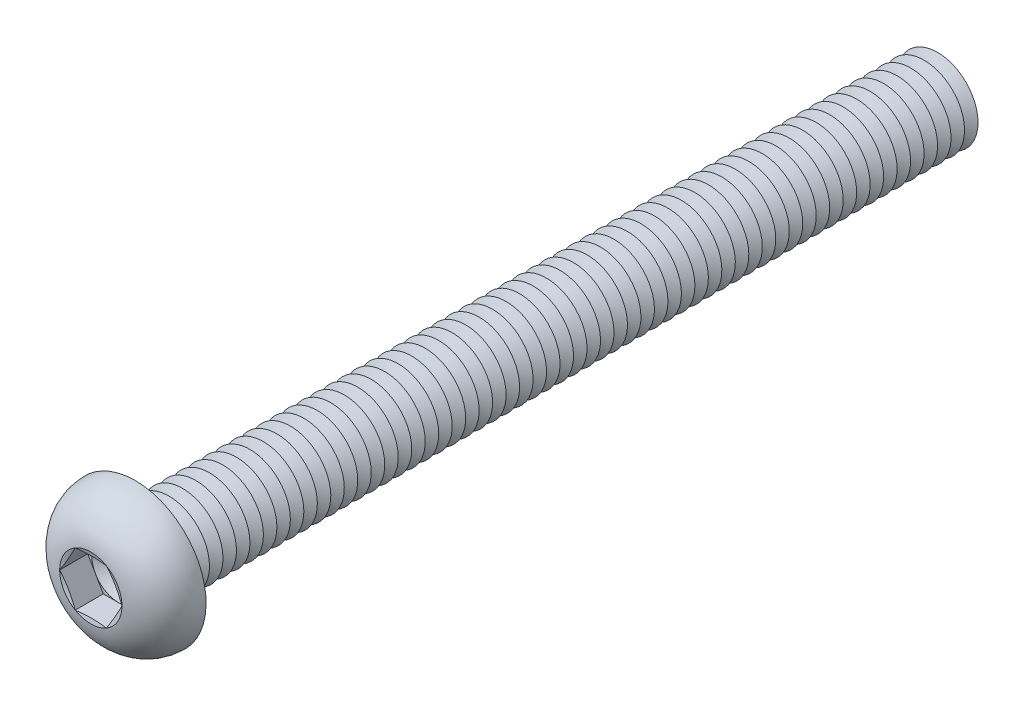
ISO-10303-21;
HEADER;
FILE_DESCRIPTION(('STEP AP214'),'2;1');
FILE_NAME('part.step','',(''),(''),'','','');
FILE_SCHEMA(('AUTOMOTIVE_DESIGN { 1 0 10303 214 1 1 1 1 }'));
ENDSEC;
DATA;
#1=APPLICATION_CONTEXT('core data for automotive mechanical design processes');
#2=APPLICATION_PROTOCOL_DEFINITION('international standard','automotive_design',2000,#1);
#3=PRODUCT_CONTEXT('',#1,'mechanical');
#4=PRODUCT('Part','Part','',(#3));
#5=PRODUCT_RELATED_PRODUCT_CATEGORY('part','',(#4));
#6=PRODUCT_DEFINITION_FORMATION('','',#4);
#7=PRODUCT_DEFINITION_CONTEXT('part definition',#1,'design');
#8=PRODUCT_DEFINITION('design','',#6,#7);
#9=PRODUCT_DEFINITION_SHAPE('','',#8);
#10=(LENGTH_UNIT() NAMED_UNIT(*) SI_UNIT(.MILLI.,.METRE.));
#11=(NAMED_UNIT(*) PLANE_ANGLE_UNIT() SI_UNIT($,.RADIAN.));
#12=(NAMED_UNIT(*) SI_UNIT($,.STERADIAN.) SOLID_ANGLE_UNIT());
#13=UNCERTAINTY_MEASURE_WITH_UNIT(LENGTH_MEASURE(1.E-05),#10,'distance_accuracy_value','');
#14=(GEOMETRIC_REPRESENTATION_CONTEXT(3) GLOBAL_UNCERTAINTY_ASSIGNED_CONTEXT((#13)) GLOBAL_UNIT_ASSIGNED_CONTEXT((#10,
#11,#12)) REPRESENTATION_CONTEXT('',''));
#15=CARTESIAN_POINT('',(0.,0.,0.));
#16=DIRECTION('',(0.,0.,1.));
#17=DIRECTION('',(1.,0.,0.));
#18=AXIS2_PLACEMENT_3D('',#15,#16,#17);
#19=CARTESIAN_POINT('',(0.,0.,1.22));
#20=DIRECTION('',(0.,0.,1.));
#21=DIRECTION('',(1.,0.,0.));
#22=AXIS2_PLACEMENT_3D('',#19,#20,#21);
#23=PLANE('',#22);
#24=CARTESIAN_POINT('',(0.,0.,1.22));
#25=DIRECTION('',(0.,0.,1.));
#26=DIRECTION('',(1.,0.,0.));
#27=AXIS2_PLACEMENT_3D('',#24,#25,#26);
#28=CIRCLE('',#27,1.99999906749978);
#29=CARTESIAN_POINT('',(1.73205,0.999999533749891,1.22));
#30=VERTEX_POINT('',#29);
#31=CARTESIAN_POINT('',(0.,1.99999906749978,1.22));
#32=VERTEX_POINT('',#31);
#33=EDGE_CURVE('E118',#30,#32,#28,.T.);
#34=ORIENTED_EDGE('',*,*,#33,.F.);
#35=DIRECTION('',(-0.5,0.866025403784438,0.));
#36=VECTOR('',#35,1.);
#37=CARTESIAN_POINT('',(2.3094,0.,1.22));
#38=LINE('',#37,#36);
#39=CARTESIAN_POINT('',(1.1547,1.99999906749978,1.22));
#40=VERTEX_POINT('',#39);
#41=EDGE_CURVE('E125',#30,#40,#38,.T.);
#42=ORIENTED_EDGE('',*,*,#41,.T.);
#43=DIRECTION('',(-1.,0.,0.));
#44=VECTOR('',#43,1.);
#45=CARTESIAN_POINT('',(1.1547,1.99999906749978,1.22));
#46=LINE('',#45,#44);
#47=EDGE_CURVE('E136',#40,#32,#46,.T.);
#48=ORIENTED_EDGE('',*,*,#47,.T.);
#49=EDGE_LOOP('',(#34,#42,#48));
#50=FACE_BOUND('',#49,.T.);
#51=ADVANCED_FACE('F39',(#50),#23,.T.);
#52=CARTESIAN_POINT('',(0.,0.,1.22));
#53=DIRECTION('',(0.,0.,1.));
#54=DIRECTION('',(1.,0.,0.));
#55=AXIS2_PLACEMENT_3D('',#52,#53,#54);
#56=CIRCLE('',#55,1.99999906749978);
#57=CARTESIAN_POINT('',(-1.73205,0.999999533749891,1.22));
#58=VERTEX_POINT('',#57);
#59=EDGE_CURVE('E11',#32,#58,#56,.T.);
#60=ORIENTED_EDGE('',*,*,#59,.F.);
#61=CARTESIAN_POINT('',(-1.1547,1.99999906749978,1.22));
#62=VERTEX_POINT('',#61);
#63=EDGE_CURVE('E131',#32,#62,#46,.T.);
#64=ORIENTED_EDGE('',*,*,#63,.T.);
#65=DIRECTION('',(-0.5,-0.866025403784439,0.));
#66=VECTOR('',#65,1.);
#67=CARTESIAN_POINT('',(-1.1547,1.99999906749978,1.22));
#68=LINE('',#67,#66);
#69=EDGE_CURVE('E134',#62,#58,#68,.T.);
#70=ORIENTED_EDGE('',*,*,#69,.T.);
#71=EDGE_LOOP('',(#60,#64,#70));
#72=FACE_BOUND('',#71,.T.);
#73=ADVANCED_FACE('F130',(#72),#23,.T.);
#74=CARTESIAN_POINT('',(-1.73205,-0.999999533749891,1.22));
#75=VERTEX_POINT('',#74);
#76=EDGE_CURVE('E49',#58,#75,#56,.T.);
#77=ORIENTED_EDGE('',*,*,#76,.F.);
#78=CARTESIAN_POINT('',(-2.3094,0.,1.22));
#79=VERTEX_POINT('',#78);
#80=EDGE_CURVE('E143',#58,#79,#68,.T.);
#81=ORIENTED_EDGE('',*,*,#80,.T.);
#82=DIRECTION('',(0.5,-0.866025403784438,0.));
#83=VECTOR('',#82,1.);
#84=CARTESIAN_POINT('',(-2.3094,0.,1.22));
#85=LINE('',#84,#83);
#86=EDGE_CURVE('E151',#79,#75,#85,.T.);
#87=ORIENTED_EDGE('',*,*,#86,.T.);
#88=EDGE_LOOP('',(#77,#81,#87));
#89=FACE_BOUND('',#88,.T.);
#90=ADVANCED_FACE('F746',(#89),#23,.T.);
#91=CARTESIAN_POINT('',(0.,-1.99999906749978,1.22));
#92=VERTEX_POINT('',#91);
#93=EDGE_CURVE('E731',#75,#92,#56,.T.);
#94=ORIENTED_EDGE('',*,*,#93,.F.);
#95=CARTESIAN_POINT('',(-1.1547,-1.99999906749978,1.22));
#96=VERTEX_POINT('',#95);
#97=EDGE_CURVE('E150',#75,#96,#85,.T.);
#98=ORIENTED_EDGE('',*,*,#97,.T.);
#99=DIRECTION('',(1.,0.,0.));
#100=VECTOR('',#99,1.);
#101=CARTESIAN_POINT('',(-1.1547,-1.99999906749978,1.22));
#102=LINE('',#101,#100);
#103=EDGE_CURVE('E156',#96,#92,#102,.T.);
#104=ORIENTED_EDGE('',*,*,#103,.T.);
#105=EDGE_LOOP('',(#94,#98,#104));
#106=FACE_BOUND('',#105,.T.);
#107=ADVANCED_FACE('F740',(#106),#23,.T.);
#108=CARTESIAN_POINT('',(1.73205,-0.999999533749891,1.22));
#109=VERTEX_POINT('',#108);
#110=EDGE_CURVE('E56',#92,#109,#56,.T.);
#111=ORIENTED_EDGE('',*,*,#110,.F.);
#112=CARTESIAN_POINT('',(1.1547,-1.99999906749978,1.22));
#113=VERTEX_POINT('',#112);
#114=EDGE_CURVE('E155',#92,#113,#102,.T.);
#115=ORIENTED_EDGE('',*,*,#114,.T.);
#116=DIRECTION('',(0.5,0.866025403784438,0.));
#117=VECTOR('',#116,1.);
#118=CARTESIAN_POINT('',(1.1547,-1.99999906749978,1.22));
#119=LINE('',#118,#117);
#120=EDGE_CURVE('E161',#113,#109,#119,.T.);
#121=ORIENTED_EDGE('',*,*,#120,.T.);
#122=EDGE_LOOP('',(#111,#115,#121));
#123=FACE_BOUND('',#122,.T.);
#124=ADVANCED_FACE('F815',(#123),#23,.T.);
#125=CARTESIAN_POINT('',(0.,0.,3.3));
#126=DIRECTION('',(0.,0.,1.));
#127=DIRECTION('',(0.,-1.,0.));
#128=AXIS2_PLACEMENT_3D('',#125,#126,#127);
#129=CONICAL_SURFACE('',#128,2.3094,1.30899693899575);
#130=CARTESIAN_POINT('',(2.30951547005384,-0.000200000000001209,3.30003094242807));
#131=CARTESIAN_POINT('',(2.26155412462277,0.082871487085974,3.2871729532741));
#132=CARTESIAN_POINT('',(2.21350580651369,0.166093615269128,3.27549992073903));
#133=CARTESIAN_POINT('',(2.11723944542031,0.332831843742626,3.2549913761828));
#134=CARTESIAN_POINT('',(2.06902134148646,0.416348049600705,3.24615701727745));
#135=CARTESIAN_POINT('',(1.97270782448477,0.583167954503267,3.23184167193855));
#136=CARTESIAN_POINT('',(1.92461306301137,0.666470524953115,3.22634360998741));
#137=CARTESIAN_POINT('',(1.82836219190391,0.833181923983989,3.21897125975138));
#138=CARTESIAN_POINT('',(1.78020609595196,0.916590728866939,3.21709626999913));
#139=CARTESIAN_POINT('',(1.68389390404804,1.08340833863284,3.21709626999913));
#140=CARTESIAN_POINT('',(1.63573780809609,1.16681714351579,3.21897125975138));
#141=CARTESIAN_POINT('',(1.53948693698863,1.33352854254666,3.22634360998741));
#142=CARTESIAN_POINT('',(1.49139217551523,1.41683111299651,3.23184167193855));
#143=CARTESIAN_POINT('',(1.39507865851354,1.58365101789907,3.24615701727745));
#144=CARTESIAN_POINT('',(1.34686055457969,1.66716722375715,3.2549913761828));
#145=CARTESIAN_POINT('',(1.25059419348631,1.83390545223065,3.27549992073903));
#146=CARTESIAN_POINT('',(1.20254587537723,1.9171275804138,3.2871729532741));
#147=CARTESIAN_POINT('',(1.15458452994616,2.00019906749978,3.30003094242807));
#148=B_SPLINE_CURVE_WITH_KNOTS('',3,(#130,#131,#132,#133,#134,#135,#136,#137,#138,#139,#140,
#141,#142,#143,#144,#145,#146,#147),.UNSPECIFIED.,.F.,.F.,(4,2,2,2,2,2,2,2,4),(0.,
0.290357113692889,0.580832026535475,0.869807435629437,1.15872689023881,1.44764634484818,
1.73662175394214,2.02709666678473,2.31745378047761),.UNSPECIFIED.);
#149=CARTESIAN_POINT('',(2.3094,0.,3.3));
#150=VERTEX_POINT('',#149);
#151=CARTESIAN_POINT('',(1.15469999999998,1.99999906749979,3.3));
#152=VERTEX_POINT('',#151);
#153=EDGE_CURVE('E220',#150,#152,#148,.T.);
#154=ORIENTED_EDGE('',*,*,#153,.F.);
#155=CARTESIAN_POINT('',(0.,0.,3.3));
#156=DIRECTION('',(0.,0.,-1.));
#157=DIRECTION('',(0.,1.,0.));
#158=AXIS2_PLACEMENT_3D('',#155,#156,#157);
#159=CIRCLE('',#158,2.3094);
#160=EDGE_CURVE('E715',#152,#150,#159,.T.);
#161=ORIENTED_EDGE('',*,*,#160,.F.);
#162=EDGE_LOOP('',(#154,#161));
#163=FACE_BOUND('',#162,.T.);
#164=ADVANCED_FACE('F819',(#163),#129,.F.);
#165=CARTESIAN_POINT('',(1.15458452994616,-2.00019906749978,3.30003094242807));
#166=CARTESIAN_POINT('',(1.20254587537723,-1.91712758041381,3.2871729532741));
#167=CARTESIAN_POINT('',(1.25059419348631,-1.83390545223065,3.27549992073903));
#168=CARTESIAN_POINT('',(1.34686055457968,-1.66716722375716,3.2549913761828));
#169=CARTESIAN_POINT('',(1.39507865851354,-1.58365101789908,3.24615701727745));
#170=CARTESIAN_POINT('',(1.49139217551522,-1.41683111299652,3.23184167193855));
#171=CARTESIAN_POINT('',(1.53948693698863,-1.33352854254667,3.22634360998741));
#172=CARTESIAN_POINT('',(1.63573780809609,-1.16681714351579,3.21897125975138));
#173=CARTESIAN_POINT('',(1.68389390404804,-1.08340833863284,3.21709626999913));
#174=CARTESIAN_POINT('',(1.78020609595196,-0.916590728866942,3.21709626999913));
#175=CARTESIAN_POINT('',(1.82836219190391,-0.833181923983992,3.21897125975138));
#176=CARTESIAN_POINT('',(1.92461306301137,-0.666470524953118,3.22634360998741));
#177=CARTESIAN_POINT('',(1.97270782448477,-0.58316795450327,3.23184167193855));
#178=CARTESIAN_POINT('',(2.06902134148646,-0.416348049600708,3.24615701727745));
#179=CARTESIAN_POINT('',(2.11723944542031,-0.332831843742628,3.2549913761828));
#180=CARTESIAN_POINT('',(2.21350580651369,-0.16609361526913,3.27549992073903));
#181=CARTESIAN_POINT('',(2.26155412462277,-0.0828714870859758,3.2871729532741));
#182=CARTESIAN_POINT('',(2.30951547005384,0.000199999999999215,3.30003094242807));
#183=B_SPLINE_CURVE_WITH_KNOTS('',3,(#165,#166,#167,#168,#169,#170,#171,#172,#173,#174,#175,
#176,#177,#178,#179,#180,#181,#182),.UNSPECIFIED.,.F.,.F.,(4,2,2,2,2,2,2,2,4),(0.,
0.290357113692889,0.580832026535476,0.869807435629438,1.15872689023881,1.44764634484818,
1.73662175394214,2.02709666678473,2.31745378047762),.UNSPECIFIED.);
#184=CARTESIAN_POINT('',(1.1547,-1.99999906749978,3.3));
#185=VERTEX_POINT('',#184);
#186=EDGE_CURVE('E229',#185,#150,#183,.T.);
#187=ORIENTED_EDGE('',*,*,#186,.F.);
#188=EDGE_CURVE('E720',#150,#185,#159,.T.);
#189=ORIENTED_EDGE('',*,*,#188,.F.);
#190=EDGE_LOOP('',(#187,#189));
#191=FACE_BOUND('',#190,.T.);
#192=ADVANCED_FACE('F780',(#191),#129,.F.);
#193=CARTESIAN_POINT('',(-3.4849337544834,-1.99999906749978,3.75783251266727));
#194=CARTESIAN_POINT('',(-3.40057136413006,-1.99999906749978,3.73822859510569));
#195=CARTESIAN_POINT('',(-3.31617090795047,-1.99999906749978,3.71878852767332));
#196=CARTESIAN_POINT('',(-3.14727791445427,-1.99999906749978,3.68030638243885));
#197=CARTESIAN_POINT('',(-3.06278537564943,-1.99999906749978,3.66126431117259));
#198=CARTESIAN_POINT('',(-2.80911712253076,-1.99999906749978,3.60483420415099));
#199=CARTESIAN_POINT('',(-2.63978343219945,-1.99999906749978,3.5681499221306));
#200=CARTESIAN_POINT('',(-2.29895421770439,-1.99999906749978,3.49717072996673));
#201=CARTESIAN_POINT('',(-2.12745330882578,-1.99999906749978,3.4629014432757));
#202=CARTESIAN_POINT('',(-1.78364663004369,-1.99999906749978,3.39849485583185));
#203=CARTESIAN_POINT('',(-1.61134079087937,-1.99999906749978,3.36835791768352));
#204=CARTESIAN_POINT('',(-1.27040784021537,-1.99999906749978,3.31501553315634));
#205=CARTESIAN_POINT('',(-1.10180724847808,-1.99999906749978,3.291644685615));
#206=CARTESIAN_POINT('',(-0.763641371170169,-1.99999906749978,3.2533727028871));
#207=CARTESIAN_POINT('',(-0.594076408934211,-1.99999906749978,3.23846888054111));
#208=CARTESIAN_POINT('',(-0.339649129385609,-1.99999906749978,3.22431372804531));
#209=CARTESIAN_POINT('',(-0.255009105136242,-1.99999906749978,3.22096057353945));
#210=CARTESIAN_POINT('',(-0.0856618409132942,-1.99999906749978,3.21711210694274));
#211=CARTESIAN_POINT('',(-0.000954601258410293,-1.99999906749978,3.2166167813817));
#212=CARTESIAN_POINT('',(0.16843098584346,-1.99999906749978,3.21851478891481));
#213=CARTESIAN_POINT('',(0.253109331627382,-1.99999906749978,3.2209082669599));
#214=CARTESIAN_POINT('',(0.422344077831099,-1.99999906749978,3.22845792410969));
#215=CARTESIAN_POINT('',(0.506900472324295,-1.99999906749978,3.23361423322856));
#216=CARTESIAN_POINT('',(0.712240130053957,-1.99999906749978,3.24921577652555));
#217=CARTESIAN_POINT('',(0.832922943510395,-1.99999906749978,3.26098285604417));
#218=CARTESIAN_POINT('',(1.07378161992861,-1.99999906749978,3.28874908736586));
#219=CARTESIAN_POINT('',(1.1939575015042,-1.99999906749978,3.30474808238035));
#220=CARTESIAN_POINT('',(1.43419655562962,-1.99999906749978,3.34009172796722));
#221=CARTESIAN_POINT('',(1.55425817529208,-1.99999906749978,3.35944677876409));
#222=CARTESIAN_POINT('',(1.79394991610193,-1.99999906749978,3.40067076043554));
#223=CARTESIAN_POINT('',(1.91358001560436,-1.99999906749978,3.42253981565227));
#224=CARTESIAN_POINT('',(2.15493405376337,-1.99999906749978,3.46864194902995));
#225=CARTESIAN_POINT('',(2.27665041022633,-1.99999906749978,3.49291441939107));
#226=CARTESIAN_POINT('',(2.51977680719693,-1.99999906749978,3.54294628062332));
#227=CARTESIAN_POINT('',(2.64118684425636,-1.99999906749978,3.56870568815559));
#228=CARTESIAN_POINT('',(2.88310060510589,-1.99999906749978,3.62120891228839));
#229=CARTESIAN_POINT('',(3.00360566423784,-1.99999906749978,3.6479466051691));
#230=CARTESIAN_POINT('',(3.24441021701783,-1.99999906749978,3.7022947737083));
#231=CARTESIAN_POINT('',(3.36470972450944,-1.99999906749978,3.72990518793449));
#232=CARTESIAN_POINT('',(3.4849337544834,-1.99999906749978,3.75783251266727));
#233=B_SPLINE_CURVE_WITH_KNOTS('',3,(#193,#194,#195,#196,#197,#198,#199,#200,#201,#202,#203,
#204,#205,#206,#207,#208,#209,#210,#211,#212,#213,#214,#215,#216,#217,#218,#219,#220,#221,#222,
#223,#224,#225,#226,#227,#228,#229,#230,#231,#232),.UNSPECIFIED.,.F.,.F.,(4,2,2,2,2,2,2,2,2,2,2,
2,2,2,2,2,2,2,2,4),(0.,0.259830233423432,0.519664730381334,1.03943435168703,1.56407662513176,
2.08876490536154,2.59926476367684,3.10960251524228,3.36367930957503,3.61775490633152,
3.87184325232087,4.1259435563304,4.48960924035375,4.85326145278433,5.21806142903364,
5.58287945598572,5.95520617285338,6.32753706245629,6.69784064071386,7.06811821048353),.UNSPECIFIED.);
#234=CARTESIAN_POINT('',(-1.1547,-1.99999906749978,3.3));
#235=VERTEX_POINT('',#234);
#236=EDGE_CURVE('E760',#235,#185,#233,.T.);
#237=ORIENTED_EDGE('',*,*,#236,.F.);
#238=EDGE_CURVE('E773',#185,#235,#159,.T.);
#239=ORIENTED_EDGE('',*,*,#238,.F.);
#240=EDGE_LOOP('',(#237,#239));
#241=FACE_BOUND('',#240,.T.);
#242=ADVANCED_FACE('F786',(#241),#129,.F.);
#243=CARTESIAN_POINT('',(-2.30951547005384,0.000199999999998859,3.30003094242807));
#244=CARTESIAN_POINT('',(-2.26155412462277,-0.0828714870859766,3.2871729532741));
#245=CARTESIAN_POINT('',(-2.21350580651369,-0.166093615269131,3.27549992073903));
#246=CARTESIAN_POINT('',(-2.11723944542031,-0.332831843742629,3.2549913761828));
#247=CARTESIAN_POINT('',(-2.06902134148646,-0.416348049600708,3.24615701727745));
#248=CARTESIAN_POINT('',(-1.97270782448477,-0.58316795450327,3.23184167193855));
#249=CARTESIAN_POINT('',(-1.92461306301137,-0.666470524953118,3.22634360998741));
#250=CARTESIAN_POINT('',(-1.82836219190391,-0.833181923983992,3.21897125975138));
#251=CARTESIAN_POINT('',(-1.78020609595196,-0.916590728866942,3.21709626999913));
#252=CARTESIAN_POINT('',(-1.68389390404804,-1.08340833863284,3.21709626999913));
#253=CARTESIAN_POINT('',(-1.63573780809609,-1.16681714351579,3.21897125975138));
#254=CARTESIAN_POINT('',(-1.53948693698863,-1.33352854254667,3.22634360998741));
#255=CARTESIAN_POINT('',(-1.49139217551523,-1.41683111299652,3.23184167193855));
#256=CARTESIAN_POINT('',(-1.39507865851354,-1.58365101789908,3.24615701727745));
#257=CARTESIAN_POINT('',(-1.34686055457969,-1.66716722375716,3.2549913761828));
#258=CARTESIAN_POINT('',(-1.25059419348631,-1.83390545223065,3.27549992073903));
#259=CARTESIAN_POINT('',(-1.20254587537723,-1.91712758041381,3.2871729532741));
#260=CARTESIAN_POINT('',(-1.15458452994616,-2.00019906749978,3.30003094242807));
#261=B_SPLINE_CURVE_WITH_KNOTS('',3,(#243,#244,#245,#246,#247,#248,#249,#250,#251,#252,#253,
#254,#255,#256,#257,#258,#259,#260),.UNSPECIFIED.,.F.,.F.,(4,2,2,2,2,2,2,2,4),(0.,
0.290357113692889,0.580832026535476,0.869807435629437,1.15872689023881,1.44764634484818,
1.73662175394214,2.02709666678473,2.31745378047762),.UNSPECIFIED.);
#262=CARTESIAN_POINT('',(-2.3094,0.,3.3));
#263=VERTEX_POINT('',#262);
#264=EDGE_CURVE('E751',#263,#235,#261,.T.);
#265=ORIENTED_EDGE('',*,*,#264,.F.);
#266=EDGE_CURVE('E757',#235,#263,#159,.T.);
#267=ORIENTED_EDGE('',*,*,#266,.F.);
#268=EDGE_LOOP('',(#265,#267));
#269=FACE_BOUND('',#268,.T.);
#270=ADVANCED_FACE('F755',(#269),#129,.F.);
#271=CARTESIAN_POINT('',(-1.15458452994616,2.00019906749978,3.30003094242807));
#272=CARTESIAN_POINT('',(-1.20254587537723,1.9171275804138,3.2871729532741));
#273=CARTESIAN_POINT('',(-1.25059419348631,1.83390545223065,3.27549992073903));
#274=CARTESIAN_POINT('',(-1.34686055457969,1.66716722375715,3.2549913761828));
#275=CARTESIAN_POINT('',(-1.39507865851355,1.58365101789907,3.24615701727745));
#276=CARTESIAN_POINT('',(-1.49139217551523,1.41683111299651,3.23184167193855));
#277=CARTESIAN_POINT('',(-1.53948693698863,1.33352854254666,3.22634360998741));
#278=CARTESIAN_POINT('',(-1.63573780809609,1.16681714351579,3.21897125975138));
#279=CARTESIAN_POINT('',(-1.68389390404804,1.08340833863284,3.21709626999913));
#280=CARTESIAN_POINT('',(-1.78020609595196,0.916590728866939,3.21709626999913));
#281=CARTESIAN_POINT('',(-1.82836219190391,0.833181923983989,3.21897125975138));
#282=CARTESIAN_POINT('',(-1.92461306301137,0.666470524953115,3.22634360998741));
#283=CARTESIAN_POINT('',(-1.97270782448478,0.583167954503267,3.23184167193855));
#284=CARTESIAN_POINT('',(-2.06902134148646,0.416348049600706,3.24615701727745));
#285=CARTESIAN_POINT('',(-2.11723944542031,0.332831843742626,3.2549913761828));
#286=CARTESIAN_POINT('',(-2.21350580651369,0.166093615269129,3.27549992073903));
#287=CARTESIAN_POINT('',(-2.26155412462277,0.0828714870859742,3.2871729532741));
#288=CARTESIAN_POINT('',(-2.30951547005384,-0.000200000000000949,3.30003094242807));
#289=B_SPLINE_CURVE_WITH_KNOTS('',3,(#271,#272,#273,#274,#275,#276,#277,#278,#279,#280,#281,
#282,#283,#284,#285,#286,#287,#288),.UNSPECIFIED.,.F.,.F.,(4,2,2,2,2,2,2,2,4),(0.,
0.290357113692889,0.580832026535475,0.869807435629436,1.15872689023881,1.44764634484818,
1.73662175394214,2.02709666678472,2.31745378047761),.UNSPECIFIED.);
#290=CARTESIAN_POINT('',(-1.1547,1.99999906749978,3.3));
#291=VERTEX_POINT('',#290);
#292=EDGE_CURVE('E194',#291,#263,#289,.T.);
#293=ORIENTED_EDGE('',*,*,#292,.F.);
#294=EDGE_CURVE('E763',#263,#291,#159,.T.);
#295=ORIENTED_EDGE('',*,*,#294,.F.);
#296=EDGE_LOOP('',(#293,#295));
#297=FACE_BOUND('',#296,.T.);
#298=ADVANCED_FACE('F764',(#297),#129,.F.);
#299=CARTESIAN_POINT('',(0.,0.,-56.5));
#300=DIRECTION('',(0.,0.,1.));
#301=DIRECTION('',(0.,-1.,0.));
#302=AXIS2_PLACEMENT_3D('',#299,#300,#301);
#303=CONICAL_SURFACE('',#302,2.99999999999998,1.0471975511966);
#304=CARTESIAN_POINT('',(0.,0.,-57.));
#305=DIRECTION('',(0.,0.,1.));
#306=DIRECTION('',(0.,-1.,0.));
#307=AXIS2_PLACEMENT_3D('',#304,#305,#306);
#308=CIRCLE('',#307,2.13397459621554);
#309=CARTESIAN_POINT('',(0.,-2.13397459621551,-57.));
#310=VERTEX_POINT('',#309);
#311=EDGE_CURVE('E686',#310,#310,#308,.T.);
#312=ORIENTED_EDGE('',*,*,#311,.T.);
#313=EDGE_LOOP('',(#312));
#314=FACE_BOUND('',#313,.T.);
#315=CARTESIAN_POINT('',(0.,0.,-56.5));
#316=DIRECTION('',(0.,0.,1.));
#317=DIRECTION('',(0.,-1.,0.));
#318=AXIS2_PLACEMENT_3D('',#315,#316,#317);
#319=CIRCLE('',#318,2.99999999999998);
#320=CARTESIAN_POINT('',(0.,-2.99999999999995,-56.5));
#321=VERTEX_POINT('',#320);
#322=EDGE_CURVE('E682',#321,#321,#319,.T.);
#323=ORIENTED_EDGE('',*,*,#322,.F.);
#324=EDGE_LOOP('',(#323));
#325=FACE_BOUND('',#324,.T.);
#326=ADVANCED_FACE('F848',(#314,#325),#303,.T.);
#327=CARTESIAN_POINT('',(0.,0.,-57.));
#328=DIRECTION('',(0.,0.,-1.));
#329=DIRECTION('',(0.,1.,0.));
#330=AXIS2_PLACEMENT_3D('',#327,#328,#329);
#331=CONICAL_SURFACE('',#330,2.13397459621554,1.0471975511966);
#332=CARTESIAN_POINT('',(0.,0.,-57.5));
#333=DIRECTION('',(0.,0.,1.));
#334=DIRECTION('',(0.,-1.,0.));
#335=AXIS2_PLACEMENT_3D('',#332,#333,#334);
#336=CIRCLE('',#335,2.99999999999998);
#337=CARTESIAN_POINT('',(0.,-2.99999999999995,-57.5));
#338=VERTEX_POINT('',#337);
#339=EDGE_CURVE('E690',#338,#338,#336,.T.);
#340=ORIENTED_EDGE('',*,*,#339,.T.);
#341=EDGE_LOOP('',(#340));
#342=FACE_BOUND('',#341,.T.);
#343=ORIENTED_EDGE('',*,*,#311,.F.);
#344=EDGE_LOOP('',(#343));
#345=FACE_BOUND('',#344,.T.);
#346=ADVANCED_FACE('F853',(#342,#345),#331,.T.);
#347=CARTESIAN_POINT('',(0.,2.99999999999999,-60.));
#348=DIRECTION('',(0.,0.,-1.));
#349=DIRECTION('',(0.,1.,0.));
#350=AXIS2_PLACEMENT_3D('',#347,#348,#349);
#351=PLANE('',#350);
#352=CARTESIAN_POINT('',(0.,0.,-60.));
#353=DIRECTION('',(0.,0.,1.));
#354=DIRECTION('',(0.,-1.,0.));
#355=AXIS2_PLACEMENT_3D('',#352,#353,#354);
#356=CIRCLE('',#355,2.13397459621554);
#357=CARTESIAN_POINT('',(0.,-2.13397459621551,-60.));
#358=VERTEX_POINT('',#357);
#359=EDGE_CURVE('E710',#358,#358,#356,.T.);
#360=ORIENTED_EDGE('',*,*,#359,.F.);
#361=EDGE_LOOP('',(#360));
#362=FACE_BOUND('',#361,.T.);
#363=ADVANCED_FACE('F1020',(#362),#351,.T.);
#364=CARTESIAN_POINT('',(0.,0.,-59.5));
#365=DIRECTION('',(0.,0.,1.));
#366=DIRECTION('',(0.,-1.,0.));
#367=AXIS2_PLACEMENT_3D('',#364,#365,#366);
#368=CONICAL_SURFACE('',#367,2.99999999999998,1.0471975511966);
#369=ORIENTED_EDGE('',*,*,#359,.T.);
#370=EDGE_LOOP('',(#369));
#371=FACE_BOUND('',#370,.T.);
#372=CARTESIAN_POINT('',(0.,0.,-59.5));
#373=DIRECTION('',(0.,0.,1.));
#374=DIRECTION('',(0.,-1.,0.));
#375=AXIS2_PLACEMENT_3D('',#372,#373,#374);
#376=CIRCLE('',#375,2.99999999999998);
#377=CARTESIAN_POINT('',(0.,-2.99999999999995,-59.5));
#378=VERTEX_POINT('',#377);
#379=EDGE_CURVE('E706',#378,#378,#376,.T.);
#380=ORIENTED_EDGE('',*,*,#379,.F.);
#381=EDGE_LOOP('',(#380));
#382=FACE_BOUND('',#381,.T.);
#383=ADVANCED_FACE('F1013',(#371,#382),#368,.T.);
#384=CARTESIAN_POINT('',(0.,0.,-59.));
#385=DIRECTION('',(0.,0.,-1.));
#386=DIRECTION('',(0.,1.,0.));
#387=AXIS2_PLACEMENT_3D('',#384,#385,#386);
#388=CONICAL_SURFACE('',#387,2.13397459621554,1.0471975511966);
#389=ORIENTED_EDGE('',*,*,#379,.T.);
#390=EDGE_LOOP('',(#389));
#391=FACE_BOUND('',#390,.T.);
#392=CARTESIAN_POINT('',(0.,0.,-59.));
#393=DIRECTION('',(0.,0.,1.));
#394=DIRECTION('',(0.,-1.,0.));
#395=AXIS2_PLACEMENT_3D('',#392,#393,#394);
#396=CIRCLE('',#395,2.13397459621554);
#397=CARTESIAN_POINT('',(0.,-2.13397459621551,-59.));
#398=VERTEX_POINT('',#397);
#399=EDGE_CURVE('E702',#398,#398,#396,.T.);
#400=ORIENTED_EDGE('',*,*,#399,.F.);
#401=EDGE_LOOP('',(#400));
#402=FACE_BOUND('',#401,.T.);
#403=ADVANCED_FACE('F1019',(#391,#402),#388,.T.);
#404=CARTESIAN_POINT('',(0.,0.,-58.5));
#405=DIRECTION('',(0.,0.,1.));
#406=DIRECTION('',(0.,-1.,0.));
#407=AXIS2_PLACEMENT_3D('',#404,#405,#406);
#408=CONICAL_SURFACE('',#407,2.99999999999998,1.0471975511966);
#409=ORIENTED_EDGE('',*,*,#399,.T.);
#410=EDGE_LOOP('',(#409));
#411=FACE_BOUND('',#410,.T.);
#412=CARTESIAN_POINT('',(0.,0.,-58.5));
#413=DIRECTION('',(0.,0.,1.));
#414=DIRECTION('',(0.,-1.,0.));
#415=AXIS2_PLACEMENT_3D('',#412,#413,#414);
#416=CIRCLE('',#415,2.99999999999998);
#417=CARTESIAN_POINT('',(0.,-2.99999999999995,-58.5));
#418=VERTEX_POINT('',#417);
#419=EDGE_CURVE('E698',#418,#418,#416,.T.);
#420=ORIENTED_EDGE('',*,*,#419,.F.);
#421=EDGE_LOOP('',(#420));
#422=FACE_BOUND('',#421,.T.);
#423=ADVANCED_FACE('F1051',(#411,#422),#408,.T.);
#424=CARTESIAN_POINT('',(0.,0.,-58.));
#425=DIRECTION('',(0.,0.,-1.));
#426=DIRECTION('',(0.,1.,0.));
#427=AXIS2_PLACEMENT_3D('',#424,#425,#426);
#428=CONICAL_SURFACE('',#427,2.13397459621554,1.0471975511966);
#429=ORIENTED_EDGE('',*,*,#419,.T.);
#430=EDGE_LOOP('',(#429));
#431=FACE_BOUND('',#430,.T.);
#432=CARTESIAN_POINT('',(0.,0.,-58.));
#433=DIRECTION('',(0.,0.,1.));
#434=DIRECTION('',(0.,-1.,0.));
#435=AXIS2_PLACEMENT_3D('',#432,#433,#434);
#436=CIRCLE('',#435,2.13397459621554);
#437=CARTESIAN_POINT('',(0.,-2.13397459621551,-58.));
#438=VERTEX_POINT('',#437);
#439=EDGE_CURVE('E694',#438,#438,#436,.T.);
#440=ORIENTED_EDGE('',*,*,#439,.F.);
#441=EDGE_LOOP('',(#440));
#442=FACE_BOUND('',#441,.T.);
#443=ADVANCED_FACE('F1061',(#431,#442),#428,.T.);
#444=CARTESIAN_POINT('',(0.,0.,-57.5));
#445=DIRECTION('',(0.,0.,1.));
#446=DIRECTION('',(0.,-1.,0.));
#447=AXIS2_PLACEMENT_3D('',#444,#445,#446);
#448=CONICAL_SURFACE('',#447,2.99999999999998,1.0471975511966);
#449=ORIENTED_EDGE('',*,*,#439,.T.);
#450=EDGE_LOOP('',(#449));
#451=FACE_BOUND('',#450,.T.);
#452=ORIENTED_EDGE('',*,*,#339,.F.);
#453=EDGE_LOOP('',(#452));
#454=FACE_BOUND('',#453,.T.);
#455=ADVANCED_FACE('F1071',(#451,#454),#448,.T.);
#456=CARTESIAN_POINT('',(0.,0.,-55.5));
#457=DIRECTION('',(0.,0.,1.));
#458=DIRECTION('',(0.,-1.,0.));
#459=AXIS2_PLACEMENT_3D('',#456,#457,#458);
#460=CONICAL_SURFACE('',#459,2.99999999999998,1.0471975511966);
#461=CARTESIAN_POINT('',(0.,0.,-56.));
#462=DIRECTION('',(0.,0.,1.));
#463=DIRECTION('',(0.,-1.,0.));
#464=AXIS2_PLACEMENT_3D('',#461,#462,#463);
#465=CIRCLE('',#464,2.13397459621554);
#466=CARTESIAN_POINT('',(0.,-2.13397459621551,-56.));
#467=VERTEX_POINT('',#466);
#468=EDGE_CURVE('E678',#467,#467,#465,.T.);
#469=ORIENTED_EDGE('',*,*,#468,.T.);
#470=EDGE_LOOP('',(#469));
#471=FACE_BOUND('',#470,.T.);
#472=CARTESIAN_POINT('',(0.,0.,-55.5));
#473=DIRECTION('',(0.,0.,1.));
#474=DIRECTION('',(0.,-1.,0.));
#475=AXIS2_PLACEMENT_3D('',#472,#473,#474);
#476=CIRCLE('',#475,2.99999999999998);
#477=CARTESIAN_POINT('',(0.,-2.99999999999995,-55.5));
#478=VERTEX_POINT('',#477);
#479=EDGE_CURVE('E674',#478,#478,#476,.T.);
#480=ORIENTED_EDGE('',*,*,#479,.F.);
#481=EDGE_LOOP('',(#480));
#482=FACE_BOUND('',#481,.T.);
#483=ADVANCED_FACE('F1081',(#471,#482),#460,.T.);
#484=CARTESIAN_POINT('',(0.,0.,-56.));
#485=DIRECTION('',(0.,0.,-1.));
#486=DIRECTION('',(0.,1.,0.));
#487=AXIS2_PLACEMENT_3D('',#484,#485,#486);
#488=CONICAL_SURFACE('',#487,2.13397459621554,1.0471975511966);
#489=ORIENTED_EDGE('',*,*,#322,.T.);
#490=EDGE_LOOP('',(#489));
#491=FACE_BOUND('',#490,.T.);
#492=ORIENTED_EDGE('',*,*,#468,.F.);
#493=EDGE_LOOP('',(#492));
#494=FACE_BOUND('',#493,.T.);
#495=ADVANCED_FACE('F1091',(#491,#494),#488,.T.);
#496=CARTESIAN_POINT('',(0.,0.,-54.5));
#497=DIRECTION('',(0.,0.,1.));
#498=DIRECTION('',(0.,-1.,0.));
#499=AXIS2_PLACEMENT_3D('',#496,#497,#498);
#500=CONICAL_SURFACE('',#499,2.99999999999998,1.0471975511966);
#501=CARTESIAN_POINT('',(0.,0.,-55.));
#502=DIRECTION('',(0.,0.,1.));
#503=DIRECTION('',(0.,-1.,0.));
#504=AXIS2_PLACEMENT_3D('',#501,#502,#503);
#505=CIRCLE('',#504,2.13397459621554);
#506=CARTESIAN_POINT('',(0.,-2.13397459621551,-55.));
#507=VERTEX_POINT('',#506);
#508=EDGE_CURVE('E670',#507,#507,#505,.T.);
#509=ORIENTED_EDGE('',*,*,#508,.T.);
#510=EDGE_LOOP('',(#509));
#511=FACE_BOUND('',#510,.T.);
#512=CARTESIAN_POINT('',(0.,0.,-54.5));
#513=DIRECTION('',(0.,0.,1.));
#514=DIRECTION('',(0.,-1.,0.));
#515=AXIS2_PLACEMENT_3D('',#512,#513,#514);
#516=CIRCLE('',#515,2.99999999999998);
#517=CARTESIAN_POINT('',(0.,-2.99999999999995,-54.5));
#518=VERTEX_POINT('',#517);
#519=EDGE_CURVE('E666',#518,#518,#516,.T.);
#520=ORIENTED_EDGE('',*,*,#519,.F.);
#521=EDGE_LOOP('',(#520));
#522=FACE_BOUND('',#521,.T.);
#523=ADVANCED_FACE('F1101',(#511,#522),#500,.T.);
#524=CARTESIAN_POINT('',(0.,0.,-55.));
#525=DIRECTION('',(0.,0.,-1.));
#526=DIRECTION('',(0.,1.,0.));
#527=AXIS2_PLACEMENT_3D('',#524,#525,#526);
#528=CONICAL_SURFACE('',#527,2.13397459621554,1.0471975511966);
#529=ORIENTED_EDGE('',*,*,#479,.T.);
#530=EDGE_LOOP('',(#529));
#531=FACE_BOUND('',#530,.T.);
#532=ORIENTED_EDGE('',*,*,#508,.F.);
#533=EDGE_LOOP('',(#532));
#534=FACE_BOUND('',#533,.T.);
#535=ADVANCED_FACE('F1111',(#531,#534),#528,.T.);
#536=CARTESIAN_POINT('',(0.,0.,-53.5));
#537=DIRECTION('',(0.,0.,1.));
#538=DIRECTION('',(0.,-1.,0.));
#539=AXIS2_PLACEMENT_3D('',#536,#537,#538);
#540=CONICAL_SURFACE('',#539,2.99999999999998,1.0471975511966);
#541=CARTESIAN_POINT('',(0.,0.,-54.));
#542=DIRECTION('',(0.,0.,1.));
#543=DIRECTION('',(0.,-1.,0.));
#544=AXIS2_PLACEMENT_3D('',#541,#542,#543);
#545=CIRCLE('',#544,2.13397459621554);
#546=CARTESIAN_POINT('',(0.,-2.13397459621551,-54.));
#547=VERTEX_POINT('',#546);
#548=EDGE_CURVE('E662',#547,#547,#545,.T.);
#549=ORIENTED_EDGE('',*,*,#548,.T.);
#550=EDGE_LOOP('',(#549));
#551=FACE_BOUND('',#550,.T.);
#552=CARTESIAN_POINT('',(0.,0.,-53.5));
#553=DIRECTION('',(0.,0.,1.));
#554=DIRECTION('',(0.,-1.,0.));
#555=AXIS2_PLACEMENT_3D('',#552,#553,#554);
#556=CIRCLE('',#555,2.99999999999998);
#557=CARTESIAN_POINT('',(0.,-2.99999999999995,-53.5));
#558=VERTEX_POINT('',#557);
#559=EDGE_CURVE('E658',#558,#558,#556,.T.);
#560=ORIENTED_EDGE('',*,*,#559,.F.);
#561=EDGE_LOOP('',(#560));
#562=FACE_BOUND('',#561,.T.);
#563=ADVANCED_FACE('F1121',(#551,#562),#540,.T.);
#564=CARTESIAN_POINT('',(0.,0.,-54.));
#565=DIRECTION('',(0.,0.,-1.));
#566=DIRECTION('',(0.,1.,0.));
#567=AXIS2_PLACEMENT_3D('',#564,#565,#566);
#568=CONICAL_SURFACE('',#567,2.13397459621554,1.0471975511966);
#569=ORIENTED_EDGE('',*,*,#519,.T.);
#570=EDGE_LOOP('',(#569));
#571=FACE_BOUND('',#570,.T.);
#572=ORIENTED_EDGE('',*,*,#548,.F.);
#573=EDGE_LOOP('',(#572));
#574=FACE_BOUND('',#573,.T.);
#575=ADVANCED_FACE('F1131',(#571,#574),#568,.T.);
#576=CARTESIAN_POINT('',(0.,0.,-52.5));
#577=DIRECTION('',(0.,0.,1.));
#578=DIRECTION('',(0.,-1.,0.));
#579=AXIS2_PLACEMENT_3D('',#576,#577,#578);
#580=CONICAL_SURFACE('',#579,2.99999999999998,1.0471975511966);
#581=CARTESIAN_POINT('',(0.,0.,-53.));
#582=DIRECTION('',(0.,0.,1.));
#583=DIRECTION('',(0.,-1.,0.));
#584=AXIS2_PLACEMENT_3D('',#581,#582,#583);
#585=CIRCLE('',#584,2.13397459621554);
#586=CARTESIAN_POINT('',(0.,-2.13397459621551,-53.));
#587=VERTEX_POINT('',#586);
#588=EDGE_CURVE('E654',#587,#587,#585,.T.);
#589=ORIENTED_EDGE('',*,*,#588,.T.);
#590=EDGE_LOOP('',(#589));
#591=FACE_BOUND('',#590,.T.);
#592=CARTESIAN_POINT('',(0.,0.,-52.5));
#593=DIRECTION('',(0.,0.,1.));
#594=DIRECTION('',(0.,-1.,0.));
#595=AXIS2_PLACEMENT_3D('',#592,#593,#594);
#596=CIRCLE('',#595,2.99999999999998);
#597=CARTESIAN_POINT('',(0.,-2.99999999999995,-52.5));
#598=VERTEX_POINT('',#597);
#599=EDGE_CURVE('E650',#598,#598,#596,.T.);
#600=ORIENTED_EDGE('',*,*,#599,.F.);
#601=EDGE_LOOP('',(#600));
#602=FACE_BOUND('',#601,.T.);
#603=ADVANCED_FACE('F1141',(#591,#602),#580,.T.);
#604=CARTESIAN_POINT('',(0.,0.,-53.));
#605=DIRECTION('',(0.,0.,-1.));
#606=DIRECTION('',(0.,1.,0.));
#607=AXIS2_PLACEMENT_3D('',#604,#605,#606);
#608=CONICAL_SURFACE('',#607,2.13397459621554,1.0471975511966);
#609=ORIENTED_EDGE('',*,*,#559,.T.);
#610=EDGE_LOOP('',(#609));
#611=FACE_BOUND('',#610,.T.);
#612=ORIENTED_EDGE('',*,*,#588,.F.);
#613=EDGE_LOOP('',(#612));
#614=FACE_BOUND('',#613,.T.);
#615=ADVANCED_FACE('F1151',(#611,#614),#608,.T.);
#616=CARTESIAN_POINT('',(0.,0.,-51.5));
#617=DIRECTION('',(0.,0.,1.));
#618=DIRECTION('',(0.,-1.,0.));
#619=AXIS2_PLACEMENT_3D('',#616,#617,#618);
#620=CONICAL_SURFACE('',#619,2.99999999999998,1.0471975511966);
#621=CARTESIAN_POINT('',(0.,0.,-52.));
#622=DIRECTION('',(0.,0.,1.));
#623=DIRECTION('',(0.,-1.,0.));
#624=AXIS2_PLACEMENT_3D('',#621,#622,#623);
#625=CIRCLE('',#624,2.13397459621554);
#626=CARTESIAN_POINT('',(0.,-2.13397459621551,-52.));
#627=VERTEX_POINT('',#626);
#628=EDGE_CURVE('E646',#627,#627,#625,.T.);
#629=ORIENTED_EDGE('',*,*,#628,.T.);
#630=EDGE_LOOP('',(#629));
#631=FACE_BOUND('',#630,.T.);
#632=CARTESIAN_POINT('',(0.,0.,-51.5));
#633=DIRECTION('',(0.,0.,1.));
#634=DIRECTION('',(0.,-1.,0.));
#635=AXIS2_PLACEMENT_3D('',#632,#633,#634);
#636=CIRCLE('',#635,2.99999999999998);
#637=CARTESIAN_POINT('',(0.,-2.99999999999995,-51.5));
#638=VERTEX_POINT('',#637);
#639=EDGE_CURVE('E642',#638,#638,#636,.T.);
#640=ORIENTED_EDGE('',*,*,#639,.F.);
#641=EDGE_LOOP('',(#640));
#642=FACE_BOUND('',#641,.T.);
#643=ADVANCED_FACE('F1161',(#631,#642),#620,.T.);
#644=CARTESIAN_POINT('',(0.,0.,-52.));
#645=DIRECTION('',(0.,0.,-1.));
#646=DIRECTION('',(0.,1.,0.));
#647=AXIS2_PLACEMENT_3D('',#644,#645,#646);
#648=CONICAL_SURFACE('',#647,2.13397459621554,1.0471975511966);
#649=ORIENTED_EDGE('',*,*,#599,.T.);
#650=EDGE_LOOP('',(#649));
#651=FACE_BOUND('',#650,.T.);
#652=ORIENTED_EDGE('',*,*,#628,.F.);
#653=EDGE_LOOP('',(#652));
#654=FACE_BOUND('',#653,.T.);
#655=ADVANCED_FACE('F1171',(#651,#654),#648,.T.);
#656=CARTESIAN_POINT('',(0.,0.,-50.5));
#657=DIRECTION('',(0.,0.,1.));
#658=DIRECTION('',(0.,-1.,0.));
#659=AXIS2_PLACEMENT_3D('',#656,#657,#658);
#660=CONICAL_SURFACE('',#659,2.99999999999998,1.0471975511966);
#661=CARTESIAN_POINT('',(0.,0.,-51.));
#662=DIRECTION('',(0.,0.,1.));
#663=DIRECTION('',(0.,-1.,0.));
#664=AXIS2_PLACEMENT_3D('',#661,#662,#663);
#665=CIRCLE('',#664,2.13397459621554);
#666=CARTESIAN_POINT('',(0.,-2.13397459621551,-51.));
#667=VERTEX_POINT('',#666);
#668=EDGE_CURVE('E638',#667,#667,#665,.T.);
#669=ORIENTED_EDGE('',*,*,#668,.T.);
#670=EDGE_LOOP('',(#669));
#671=FACE_BOUND('',#670,.T.);
#672=CARTESIAN_POINT('',(0.,0.,-50.5));
#673=DIRECTION('',(0.,0.,1.));
#674=DIRECTION('',(0.,-1.,0.));
#675=AXIS2_PLACEMENT_3D('',#672,#673,#674);
#676=CIRCLE('',#675,2.99999999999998);
#677=CARTESIAN_POINT('',(0.,-2.99999999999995,-50.5));
#678=VERTEX_POINT('',#677);
#679=EDGE_CURVE('E634',#678,#678,#676,.T.);
#680=ORIENTED_EDGE('',*,*,#679,.F.);
#681=EDGE_LOOP('',(#680));
#682=FACE_BOUND('',#681,.T.);
#683=ADVANCED_FACE('F1181',(#671,#682),#660,.T.);
#684=CARTESIAN_POINT('',(0.,0.,-51.));
#685=DIRECTION('',(0.,0.,-1.));
#686=DIRECTION('',(0.,1.,0.));
#687=AXIS2_PLACEMENT_3D('',#684,#685,#686);
#688=CONICAL_SURFACE('',#687,2.13397459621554,1.0471975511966);
#689=ORIENTED_EDGE('',*,*,#639,.T.);
#690=EDGE_LOOP('',(#689));
#691=FACE_BOUND('',#690,.T.);
#692=ORIENTED_EDGE('',*,*,#668,.F.);
#693=EDGE_LOOP('',(#692));
#694=FACE_BOUND('',#693,.T.);
#695=ADVANCED_FACE('F1191',(#691,#694),#688,.T.);
#696=CARTESIAN_POINT('',(0.,0.,-49.5));
#697=DIRECTION('',(0.,0.,1.));
#698=DIRECTION('',(0.,-1.,0.));
#699=AXIS2_PLACEMENT_3D('',#696,#697,#698);
#700=CONICAL_SURFACE('',#699,2.99999999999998,1.0471975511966);
#701=CARTESIAN_POINT('',(0.,0.,-50.));
#702=DIRECTION('',(0.,0.,1.));
#703=DIRECTION('',(0.,-1.,0.));
#704=AXIS2_PLACEMENT_3D('',#701,#702,#703);
#705=CIRCLE('',#704,2.13397459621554);
#706=CARTESIAN_POINT('',(0.,-2.13397459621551,-50.));
#707=VERTEX_POINT('',#706);
#708=EDGE_CURVE('E630',#707,#707,#705,.T.);
#709=ORIENTED_EDGE('',*,*,#708,.T.);
#710=EDGE_LOOP('',(#709));
#711=FACE_BOUND('',#710,.T.);
#712=CARTESIAN_POINT('',(0.,0.,-49.5));
#713=DIRECTION('',(0.,0.,1.));
#714=DIRECTION('',(0.,-1.,0.));
#715=AXIS2_PLACEMENT_3D('',#712,#713,#714);
#716=CIRCLE('',#715,2.99999999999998);
#717=CARTESIAN_POINT('',(0.,-2.99999999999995,-49.5));
#718=VERTEX_POINT('',#717);
#719=EDGE_CURVE('E626',#718,#718,#716,.T.);
#720=ORIENTED_EDGE('',*,*,#719,.F.);
#721=EDGE_LOOP('',(#720));
#722=FACE_BOUND('',#721,.T.);
#723=ADVANCED_FACE('F1201',(#711,#722),#700,.T.);
#724=CARTESIAN_POINT('',(0.,0.,-50.));
#725=DIRECTION('',(0.,0.,-1.));
#726=DIRECTION('',(0.,1.,0.));
#727=AXIS2_PLACEMENT_3D('',#724,#725,#726);
#728=CONICAL_SURFACE('',#727,2.13397459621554,1.0471975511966);
#729=ORIENTED_EDGE('',*,*,#679,.T.);
#730=EDGE_LOOP('',(#729));
#731=FACE_BOUND('',#730,.T.);
#732=ORIENTED_EDGE('',*,*,#708,.F.);
#733=EDGE_LOOP('',(#732));
#734=FACE_BOUND('',#733,.T.);
#735=ADVANCED_FACE('F1211',(#731,#734),#728,.T.);
#736=CARTESIAN_POINT('',(0.,0.,-48.5));
#737=DIRECTION('',(0.,0.,1.));
#738=DIRECTION('',(0.,-1.,0.));
#739=AXIS2_PLACEMENT_3D('',#736,#737,#738);
#740=CONICAL_SURFACE('',#739,2.99999999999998,1.0471975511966);
#741=CARTESIAN_POINT('',(0.,0.,-49.));
#742=DIRECTION('',(0.,0.,1.));
#743=DIRECTION('',(0.,-1.,0.));
#744=AXIS2_PLACEMENT_3D('',#741,#742,#743);
#745=CIRCLE('',#744,2.13397459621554);
#746=CARTESIAN_POINT('',(0.,-2.13397459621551,-49.));
#747=VERTEX_POINT('',#746);
#748=EDGE_CURVE('E622',#747,#747,#745,.T.);
#749=ORIENTED_EDGE('',*,*,#748,.T.);
#750=EDGE_LOOP('',(#749));
#751=FACE_BOUND('',#750,.T.);
#752=CARTESIAN_POINT('',(0.,0.,-48.5));
#753=DIRECTION('',(0.,0.,1.));
#754=DIRECTION('',(0.,-1.,0.));
#755=AXIS2_PLACEMENT_3D('',#752,#753,#754);
#756=CIRCLE('',#755,2.99999999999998);
#757=CARTESIAN_POINT('',(0.,-2.99999999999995,-48.5));
#758=VERTEX_POINT('',#757);
#759=EDGE_CURVE('E618',#758,#758,#756,.T.);
#760=ORIENTED_EDGE('',*,*,#759,.F.);
#761=EDGE_LOOP('',(#760));
#762=FACE_BOUND('',#761,.T.);
#763=ADVANCED_FACE('F1221',(#751,#762),#740,.T.);
#764=CARTESIAN_POINT('',(0.,0.,-49.));
#765=DIRECTION('',(0.,0.,-1.));
#766=DIRECTION('',(0.,1.,0.));
#767=AXIS2_PLACEMENT_3D('',#764,#765,#766);
#768=CONICAL_SURFACE('',#767,2.13397459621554,1.0471975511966);
#769=ORIENTED_EDGE('',*,*,#719,.T.);
#770=EDGE_LOOP('',(#769));
#771=FACE_BOUND('',#770,.T.);
#772=ORIENTED_EDGE('',*,*,#748,.F.);
#773=EDGE_LOOP('',(#772));
#774=FACE_BOUND('',#773,.T.);
#775=ADVANCED_FACE('F1231',(#771,#774),#768,.T.);
#776=CARTESIAN_POINT('',(0.,0.,-47.5));
#777=DIRECTION('',(0.,0.,1.));
#778=DIRECTION('',(0.,-1.,0.));
#779=AXIS2_PLACEMENT_3D('',#776,#777,#778);
#780=CONICAL_SURFACE('',#779,2.99999999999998,1.0471975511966);
#781=CARTESIAN_POINT('',(0.,0.,-48.));
#782=DIRECTION('',(0.,0.,1.));
#783=DIRECTION('',(0.,-1.,0.));
#784=AXIS2_PLACEMENT_3D('',#781,#782,#783);
#785=CIRCLE('',#784,2.13397459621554);
#786=CARTESIAN_POINT('',(0.,-2.13397459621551,-48.));
#787=VERTEX_POINT('',#786);
#788=EDGE_CURVE('E614',#787,#787,#785,.T.);
#789=ORIENTED_EDGE('',*,*,#788,.T.);
#790=EDGE_LOOP('',(#789));
#791=FACE_BOUND('',#790,.T.);
#792=CARTESIAN_POINT('',(0.,0.,-47.5));
#793=DIRECTION('',(0.,0.,1.));
#794=DIRECTION('',(0.,-1.,0.));
#795=AXIS2_PLACEMENT_3D('',#792,#793,#794);
#796=CIRCLE('',#795,2.99999999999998);
#797=CARTESIAN_POINT('',(0.,-2.99999999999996,-47.5));
#798=VERTEX_POINT('',#797);
#799=EDGE_CURVE('E610',#798,#798,#796,.T.);
#800=ORIENTED_EDGE('',*,*,#799,.F.);
#801=EDGE_LOOP('',(#800));
#802=FACE_BOUND('',#801,.T.);
#803=ADVANCED_FACE('F1241',(#791,#802),#780,.T.);
#804=CARTESIAN_POINT('',(0.,0.,-48.));
#805=DIRECTION('',(0.,0.,-1.));
#806=DIRECTION('',(0.,1.,0.));
#807=AXIS2_PLACEMENT_3D('',#804,#805,#806);
#808=CONICAL_SURFACE('',#807,2.13397459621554,1.0471975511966);
#809=ORIENTED_EDGE('',*,*,#759,.T.);
#810=EDGE_LOOP('',(#809));
#811=FACE_BOUND('',#810,.T.);
#812=ORIENTED_EDGE('',*,*,#788,.F.);
#813=EDGE_LOOP('',(#812));
#814=FACE_BOUND('',#813,.T.);
#815=ADVANCED_FACE('F1251',(#811,#814),#808,.T.);
#816=CARTESIAN_POINT('',(0.,0.,-46.5));
#817=DIRECTION('',(0.,0.,1.));
#818=DIRECTION('',(0.,-1.,0.));
#819=AXIS2_PLACEMENT_3D('',#816,#817,#818);
#820=CONICAL_SURFACE('',#819,2.99999999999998,1.0471975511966);
#821=CARTESIAN_POINT('',(0.,0.,-47.));
#822=DIRECTION('',(0.,0.,1.));
#823=DIRECTION('',(0.,-1.,0.));
#824=AXIS2_PLACEMENT_3D('',#821,#822,#823);
#825=CIRCLE('',#824,2.13397459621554);
#826=CARTESIAN_POINT('',(0.,-2.13397459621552,-47.));
#827=VERTEX_POINT('',#826);
#828=EDGE_CURVE('E606',#827,#827,#825,.T.);
#829=ORIENTED_EDGE('',*,*,#828,.T.);
#830=EDGE_LOOP('',(#829));
#831=FACE_BOUND('',#830,.T.);
#832=CARTESIAN_POINT('',(0.,0.,-46.5));
#833=DIRECTION('',(0.,0.,1.));
#834=DIRECTION('',(0.,-1.,0.));
#835=AXIS2_PLACEMENT_3D('',#832,#833,#834);
#836=CIRCLE('',#835,2.99999999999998);
#837=CARTESIAN_POINT('',(0.,-2.99999999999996,-46.5));
#838=VERTEX_POINT('',#837);
#839=EDGE_CURVE('E602',#838,#838,#836,.T.);
#840=ORIENTED_EDGE('',*,*,#839,.F.);
#841=EDGE_LOOP('',(#840));
#842=FACE_BOUND('',#841,.T.);
#843=ADVANCED_FACE('F1261',(#831,#842),#820,.T.);
#844=CARTESIAN_POINT('',(0.,0.,-47.));
#845=DIRECTION('',(0.,0.,-1.));
#846=DIRECTION('',(0.,1.,0.));
#847=AXIS2_PLACEMENT_3D('',#844,#845,#846);
#848=CONICAL_SURFACE('',#847,2.13397459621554,1.0471975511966);
#849=ORIENTED_EDGE('',*,*,#799,.T.);
#850=EDGE_LOOP('',(#849));
#851=FACE_BOUND('',#850,.T.);
#852=ORIENTED_EDGE('',*,*,#828,.F.);
#853=EDGE_LOOP('',(#852));
#854=FACE_BOUND('',#853,.T.);
#855=ADVANCED_FACE('F1271',(#851,#854),#848,.T.);
#856=CARTESIAN_POINT('',(0.,0.,-45.5));
#857=DIRECTION('',(0.,0.,1.));
#858=DIRECTION('',(0.,-1.,0.));
#859=AXIS2_PLACEMENT_3D('',#856,#857,#858);
#860=CONICAL_SURFACE('',#859,2.99999999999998,1.0471975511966);
#861=CARTESIAN_POINT('',(0.,0.,-46.));
#862=DIRECTION('',(0.,0.,1.));
#863=DIRECTION('',(0.,-1.,0.));
#864=AXIS2_PLACEMENT_3D('',#861,#862,#863);
#865=CIRCLE('',#864,2.13397459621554);
#866=CARTESIAN_POINT('',(0.,-2.13397459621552,-46.));
#867=VERTEX_POINT('',#866);
#868=EDGE_CURVE('E598',#867,#867,#865,.T.);
#869=ORIENTED_EDGE('',*,*,#868,.T.);
#870=EDGE_LOOP('',(#869));
#871=FACE_BOUND('',#870,.T.);
#872=CARTESIAN_POINT('',(0.,0.,-45.5));
#873=DIRECTION('',(0.,0.,1.));
#874=DIRECTION('',(0.,-1.,0.));
#875=AXIS2_PLACEMENT_3D('',#872,#873,#874);
#876=CIRCLE('',#875,2.99999999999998);
#877=CARTESIAN_POINT('',(0.,-2.99999999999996,-45.5));
#878=VERTEX_POINT('',#877);
#879=EDGE_CURVE('E594',#878,#878,#876,.T.);
#880=ORIENTED_EDGE('',*,*,#879,.F.);
#881=EDGE_LOOP('',(#880));
#882=FACE_BOUND('',#881,.T.);
#883=ADVANCED_FACE('F1281',(#871,#882),#860,.T.);
#884=CARTESIAN_POINT('',(0.,0.,-46.));
#885=DIRECTION('',(0.,0.,-1.));
#886=DIRECTION('',(0.,1.,0.));
#887=AXIS2_PLACEMENT_3D('',#884,#885,#886);
#888=CONICAL_SURFACE('',#887,2.13397459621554,1.0471975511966);
#889=ORIENTED_EDGE('',*,*,#839,.T.);
#890=EDGE_LOOP('',(#889));
#891=FACE_BOUND('',#890,.T.);
#892=ORIENTED_EDGE('',*,*,#868,.F.);
#893=EDGE_LOOP('',(#892));
#894=FACE_BOUND('',#893,.T.);
#895=ADVANCED_FACE('F1291',(#891,#894),#888,.T.);
#896=CARTESIAN_POINT('',(0.,0.,-44.5));
#897=DIRECTION('',(0.,0.,1.));
#898=DIRECTION('',(0.,-1.,0.));
#899=AXIS2_PLACEMENT_3D('',#896,#897,#898);
#900=CONICAL_SURFACE('',#899,2.99999999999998,1.0471975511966);
#901=CARTESIAN_POINT('',(0.,0.,-45.));
#902=DIRECTION('',(0.,0.,1.));
#903=DIRECTION('',(0.,-1.,0.));
#904=AXIS2_PLACEMENT_3D('',#901,#902,#903);
#905=CIRCLE('',#904,2.13397459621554);
#906=CARTESIAN_POINT('',(0.,-2.13397459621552,-45.));
#907=VERTEX_POINT('',#906);
#908=EDGE_CURVE('E590',#907,#907,#905,.T.);
#909=ORIENTED_EDGE('',*,*,#908,.T.);
#910=EDGE_LOOP('',(#909));
#911=FACE_BOUND('',#910,.T.);
#912=CARTESIAN_POINT('',(0.,0.,-44.5));
#913=DIRECTION('',(0.,0.,1.));
#914=DIRECTION('',(0.,-1.,0.));
#915=AXIS2_PLACEMENT_3D('',#912,#913,#914);
#916=CIRCLE('',#915,2.99999999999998);
#917=CARTESIAN_POINT('',(0.,-2.99999999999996,-44.5));
#918=VERTEX_POINT('',#917);
#919=EDGE_CURVE('E586',#918,#918,#916,.T.);
#920=ORIENTED_EDGE('',*,*,#919,.F.);
#921=EDGE_LOOP('',(#920));
#922=FACE_BOUND('',#921,.T.);
#923=ADVANCED_FACE('F1301',(#911,#922),#900,.T.);
#924=CARTESIAN_POINT('',(0.,0.,-45.));
#925=DIRECTION('',(0.,0.,-1.));
#926=DIRECTION('',(0.,1.,0.));
#927=AXIS2_PLACEMENT_3D('',#924,#925,#926);
#928=CONICAL_SURFACE('',#927,2.13397459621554,1.0471975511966);
#929=ORIENTED_EDGE('',*,*,#879,.T.);
#930=EDGE_LOOP('',(#929));
#931=FACE_BOUND('',#930,.T.);
#932=ORIENTED_EDGE('',*,*,#908,.F.);
#933=EDGE_LOOP('',(#932));
#934=FACE_BOUND('',#933,.T.);
#935=ADVANCED_FACE('F1311',(#931,#934),#928,.T.);
#936=CARTESIAN_POINT('',(0.,0.,-43.5));
#937=DIRECTION('',(0.,0.,1.));
#938=DIRECTION('',(0.,-1.,0.));
#939=AXIS2_PLACEMENT_3D('',#936,#937,#938);
#940=CONICAL_SURFACE('',#939,2.99999999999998,1.0471975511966);
#941=CARTESIAN_POINT('',(0.,0.,-44.));
#942=DIRECTION('',(0.,0.,1.));
#943=DIRECTION('',(0.,-1.,0.));
#944=AXIS2_PLACEMENT_3D('',#941,#942,#943);
#945=CIRCLE('',#944,2.13397459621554);
#946=CARTESIAN_POINT('',(0.,-2.13397459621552,-44.));
#947=VERTEX_POINT('',#946);
#948=EDGE_CURVE('E582',#947,#947,#945,.T.);
#949=ORIENTED_EDGE('',*,*,#948,.T.);
#950=EDGE_LOOP('',(#949));
#951=FACE_BOUND('',#950,.T.);
#952=CARTESIAN_POINT('',(0.,0.,-43.5));
#953=DIRECTION('',(0.,0.,1.));
#954=DIRECTION('',(0.,-1.,0.));
#955=AXIS2_PLACEMENT_3D('',#952,#953,#954);
#956=CIRCLE('',#955,2.99999999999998);
#957=CARTESIAN_POINT('',(0.,-2.99999999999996,-43.5));
#958=VERTEX_POINT('',#957);
#959=EDGE_CURVE('E578',#958,#958,#956,.T.);
#960=ORIENTED_EDGE('',*,*,#959,.F.);
#961=EDGE_LOOP('',(#960));
#962=FACE_BOUND('',#961,.T.);
#963=ADVANCED_FACE('F1321',(#951,#962),#940,.T.);
#964=CARTESIAN_POINT('',(0.,0.,-44.));
#965=DIRECTION('',(0.,0.,-1.));
#966=DIRECTION('',(0.,1.,0.));
#967=AXIS2_PLACEMENT_3D('',#964,#965,#966);
#968=CONICAL_SURFACE('',#967,2.13397459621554,1.0471975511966);
#969=ORIENTED_EDGE('',*,*,#919,.T.);
#970=EDGE_LOOP('',(#969));
#971=FACE_BOUND('',#970,.T.);
#972=ORIENTED_EDGE('',*,*,#948,.F.);
#973=EDGE_LOOP('',(#972));
#974=FACE_BOUND('',#973,.T.);
#975=ADVANCED_FACE('F1331',(#971,#974),#968,.T.);
#976=CARTESIAN_POINT('',(0.,0.,-42.5));
#977=DIRECTION('',(0.,0.,1.));
#978=DIRECTION('',(0.,-1.,0.));
#979=AXIS2_PLACEMENT_3D('',#976,#977,#978);
#980=CONICAL_SURFACE('',#979,2.99999999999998,1.0471975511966);
#981=CARTESIAN_POINT('',(0.,0.,-43.));
#982=DIRECTION('',(0.,0.,1.));
#983=DIRECTION('',(0.,-1.,0.));
#984=AXIS2_PLACEMENT_3D('',#981,#982,#983);
#985=CIRCLE('',#984,2.13397459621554);
#986=CARTESIAN_POINT('',(0.,-2.13397459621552,-43.));
#987=VERTEX_POINT('',#986);
#988=EDGE_CURVE('E574',#987,#987,#985,.T.);
#989=ORIENTED_EDGE('',*,*,#988,.T.);
#990=EDGE_LOOP('',(#989));
#991=FACE_BOUND('',#990,.T.);
#992=CARTESIAN_POINT('',(0.,0.,-42.5));
#993=DIRECTION('',(0.,0.,1.));
#994=DIRECTION('',(0.,-1.,0.));
#995=AXIS2_PLACEMENT_3D('',#992,#993,#994);
#996=CIRCLE('',#995,2.99999999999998);
#997=CARTESIAN_POINT('',(0.,-2.99999999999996,-42.5));
#998=VERTEX_POINT('',#997);
#999=EDGE_CURVE('E570',#998,#998,#996,.T.);
#1000=ORIENTED_EDGE('',*,*,#999,.F.);
#1001=EDGE_LOOP('',(#1000));
#1002=FACE_BOUND('',#1001,.T.);
#1003=ADVANCED_FACE('F1341',(#991,#1002),#980,.T.);
#1004=CARTESIAN_POINT('',(0.,0.,-43.));
#1005=DIRECTION('',(0.,0.,-1.));
#1006=DIRECTION('',(0.,1.,0.));
#1007=AXIS2_PLACEMENT_3D('',#1004,#1005,#1006);
#1008=CONICAL_SURFACE('',#1007,2.13397459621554,1.0471975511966);
#1009=ORIENTED_EDGE('',*,*,#959,.T.);
#1010=EDGE_LOOP('',(#1009));
#1011=FACE_BOUND('',#1010,.T.);
#1012=ORIENTED_EDGE('',*,*,#988,.F.);
#1013=EDGE_LOOP('',(#1012));
#1014=FACE_BOUND('',#1013,.T.);
#1015=ADVANCED_FACE('F1351',(#1011,#1014),#1008,.T.);
#1016=CARTESIAN_POINT('',(0.,0.,-41.5));
#1017=DIRECTION('',(0.,0.,1.));
#1018=DIRECTION('',(0.,-1.,0.));
#1019=AXIS2_PLACEMENT_3D('',#1016,#1017,#1018);
#1020=CONICAL_SURFACE('',#1019,2.99999999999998,1.0471975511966);
#1021=CARTESIAN_POINT('',(0.,0.,-42.));
#1022=DIRECTION('',(0.,0.,1.));
#1023=DIRECTION('',(0.,-1.,0.));
#1024=AXIS2_PLACEMENT_3D('',#1021,#1022,#1023);
#1025=CIRCLE('',#1024,2.13397459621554);
#1026=CARTESIAN_POINT('',(0.,-2.13397459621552,-42.));
#1027=VERTEX_POINT('',#1026);
#1028=EDGE_CURVE('E566',#1027,#1027,#1025,.T.);
#1029=ORIENTED_EDGE('',*,*,#1028,.T.);
#1030=EDGE_LOOP('',(#1029));
#1031=FACE_BOUND('',#1030,.T.);
#1032=CARTESIAN_POINT('',(0.,0.,-41.5));
#1033=DIRECTION('',(0.,0.,1.));
#1034=DIRECTION('',(0.,-1.,0.));
#1035=AXIS2_PLACEMENT_3D('',#1032,#1033,#1034);
#1036=CIRCLE('',#1035,2.99999999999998);
#1037=CARTESIAN_POINT('',(0.,-2.99999999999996,-41.5));
#1038=VERTEX_POINT('',#1037);
#1039=EDGE_CURVE('E562',#1038,#1038,#1036,.T.);
#1040=ORIENTED_EDGE('',*,*,#1039,.F.);
#1041=EDGE_LOOP('',(#1040));
#1042=FACE_BOUND('',#1041,.T.);
#1043=ADVANCED_FACE('F1361',(#1031,#1042),#1020,.T.);
#1044=CARTESIAN_POINT('',(0.,0.,-42.));
#1045=DIRECTION('',(0.,0.,-1.));
#1046=DIRECTION('',(0.,1.,0.));
#1047=AXIS2_PLACEMENT_3D('',#1044,#1045,#1046);
#1048=CONICAL_SURFACE('',#1047,2.13397459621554,1.0471975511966);
#1049=ORIENTED_EDGE('',*,*,#999,.T.);
#1050=EDGE_LOOP('',(#1049));
#1051=FACE_BOUND('',#1050,.T.);
#1052=ORIENTED_EDGE('',*,*,#1028,.F.);
#1053=EDGE_LOOP('',(#1052));
#1054=FACE_BOUND('',#1053,.T.);
#1055=ADVANCED_FACE('F1371',(#1051,#1054),#1048,.T.);
#1056=CARTESIAN_POINT('',(0.,0.,-40.5));
#1057=DIRECTION('',(0.,0.,1.));
#1058=DIRECTION('',(0.,-1.,0.));
#1059=AXIS2_PLACEMENT_3D('',#1056,#1057,#1058);
#1060=CONICAL_SURFACE('',#1059,2.99999999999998,1.0471975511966);
#1061=CARTESIAN_POINT('',(0.,0.,-41.));
#1062=DIRECTION('',(0.,0.,1.));
#1063=DIRECTION('',(0.,-1.,0.));
#1064=AXIS2_PLACEMENT_3D('',#1061,#1062,#1063);
#1065=CIRCLE('',#1064,2.13397459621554);
#1066=CARTESIAN_POINT('',(0.,-2.13397459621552,-41.));
#1067=VERTEX_POINT('',#1066);
#1068=EDGE_CURVE('E558',#1067,#1067,#1065,.T.);
#1069=ORIENTED_EDGE('',*,*,#1068,.T.);
#1070=EDGE_LOOP('',(#1069));
#1071=FACE_BOUND('',#1070,.T.);
#1072=CARTESIAN_POINT('',(0.,0.,-40.5));
#1073=DIRECTION('',(0.,0.,1.));
#1074=DIRECTION('',(0.,-1.,0.));
#1075=AXIS2_PLACEMENT_3D('',#1072,#1073,#1074);
#1076=CIRCLE('',#1075,2.99999999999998);
#1077=CARTESIAN_POINT('',(0.,-2.99999999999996,-40.5));
#1078=VERTEX_POINT('',#1077);
#1079=EDGE_CURVE('E554',#1078,#1078,#1076,.T.);
#1080=ORIENTED_EDGE('',*,*,#1079,.F.);
#1081=EDGE_LOOP('',(#1080));
#1082=FACE_BOUND('',#1081,.T.);
#1083=ADVANCED_FACE('F1381',(#1071,#1082),#1060,.T.);
#1084=CARTESIAN_POINT('',(0.,0.,-41.));
#1085=DIRECTION('',(0.,0.,-1.));
#1086=DIRECTION('',(0.,1.,0.));
#1087=AXIS2_PLACEMENT_3D('',#1084,#1085,#1086);
#1088=CONICAL_SURFACE('',#1087,2.13397459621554,1.0471975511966);
#1089=ORIENTED_EDGE('',*,*,#1039,.T.);
#1090=EDGE_LOOP('',(#1089));
#1091=FACE_BOUND('',#1090,.T.);
#1092=ORIENTED_EDGE('',*,*,#1068,.F.);
#1093=EDGE_LOOP('',(#1092));
#1094=FACE_BOUND('',#1093,.T.);
#1095=ADVANCED_FACE('F1391',(#1091,#1094),#1088,.T.);
#1096=CARTESIAN_POINT('',(0.,0.,-39.5));
#1097=DIRECTION('',(0.,0.,1.));
#1098=DIRECTION('',(0.,-1.,0.));
#1099=AXIS2_PLACEMENT_3D('',#1096,#1097,#1098);
#1100=CONICAL_SURFACE('',#1099,2.99999999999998,1.0471975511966);
#1101=CARTESIAN_POINT('',(0.,0.,-40.));
#1102=DIRECTION('',(0.,0.,1.));
#1103=DIRECTION('',(0.,-1.,0.));
#1104=AXIS2_PLACEMENT_3D('',#1101,#1102,#1103);
#1105=CIRCLE('',#1104,2.13397459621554);
#1106=CARTESIAN_POINT('',(0.,-2.13397459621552,-40.));
#1107=VERTEX_POINT('',#1106);
#1108=EDGE_CURVE('E550',#1107,#1107,#1105,.T.);
#1109=ORIENTED_EDGE('',*,*,#1108,.T.);
#1110=EDGE_LOOP('',(#1109));
#1111=FACE_BOUND('',#1110,.T.);
#1112=CARTESIAN_POINT('',(0.,0.,-39.5));
#1113=DIRECTION('',(0.,0.,1.));
#1114=DIRECTION('',(0.,-1.,0.));
#1115=AXIS2_PLACEMENT_3D('',#1112,#1113,#1114);
#1116=CIRCLE('',#1115,2.99999999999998);
#1117=CARTESIAN_POINT('',(0.,-2.99999999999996,-39.5));
#1118=VERTEX_POINT('',#1117);
#1119=EDGE_CURVE('E546',#1118,#1118,#1116,.T.);
#1120=ORIENTED_EDGE('',*,*,#1119,.F.);
#1121=EDGE_LOOP('',(#1120));
#1122=FACE_BOUND('',#1121,.T.);
#1123=ADVANCED_FACE('F1401',(#1111,#1122),#1100,.T.);
#1124=CARTESIAN_POINT('',(0.,0.,-40.));
#1125=DIRECTION('',(0.,0.,-1.));
#1126=DIRECTION('',(0.,1.,0.));
#1127=AXIS2_PLACEMENT_3D('',#1124,#1125,#1126);
#1128=CONICAL_SURFACE('',#1127,2.13397459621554,1.0471975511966);
#1129=ORIENTED_EDGE('',*,*,#1079,.T.);
#1130=EDGE_LOOP('',(#1129));
#1131=FACE_BOUND('',#1130,.T.);
#1132=ORIENTED_EDGE('',*,*,#1108,.F.);
#1133=EDGE_LOOP('',(#1132));
#1134=FACE_BOUND('',#1133,.T.);
#1135=ADVANCED_FACE('F1411',(#1131,#1134),#1128,.T.);
#1136=CARTESIAN_POINT('',(0.,0.,-38.5));
#1137=DIRECTION('',(0.,0.,1.));
#1138=DIRECTION('',(0.,-1.,0.));
#1139=AXIS2_PLACEMENT_3D('',#1136,#1137,#1138);
#1140=CONICAL_SURFACE('',#1139,2.99999999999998,1.0471975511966);
#1141=CARTESIAN_POINT('',(0.,0.,-39.));
#1142=DIRECTION('',(0.,0.,1.));
#1143=DIRECTION('',(0.,-1.,0.));
#1144=AXIS2_PLACEMENT_3D('',#1141,#1142,#1143);
#1145=CIRCLE('',#1144,2.13397459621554);
#1146=CARTESIAN_POINT('',(0.,-2.13397459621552,-39.));
#1147=VERTEX_POINT('',#1146);
#1148=EDGE_CURVE('E542',#1147,#1147,#1145,.T.);
#1149=ORIENTED_EDGE('',*,*,#1148,.T.);
#1150=EDGE_LOOP('',(#1149));
#1151=FACE_BOUND('',#1150,.T.);
#1152=CARTESIAN_POINT('',(0.,0.,-38.5));
#1153=DIRECTION('',(0.,0.,1.));
#1154=DIRECTION('',(0.,-1.,0.));
#1155=AXIS2_PLACEMENT_3D('',#1152,#1153,#1154);
#1156=CIRCLE('',#1155,2.99999999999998);
#1157=CARTESIAN_POINT('',(0.,-2.99999999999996,-38.5));
#1158=VERTEX_POINT('',#1157);
#1159=EDGE_CURVE('E538',#1158,#1158,#1156,.T.);
#1160=ORIENTED_EDGE('',*,*,#1159,.F.);
#1161=EDGE_LOOP('',(#1160));
#1162=FACE_BOUND('',#1161,.T.);
#1163=ADVANCED_FACE('F1421',(#1151,#1162),#1140,.T.);
#1164=CARTESIAN_POINT('',(0.,0.,-39.));
#1165=DIRECTION('',(0.,0.,-1.));
#1166=DIRECTION('',(0.,1.,0.));
#1167=AXIS2_PLACEMENT_3D('',#1164,#1165,#1166);
#1168=CONICAL_SURFACE('',#1167,2.13397459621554,1.0471975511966);
#1169=ORIENTED_EDGE('',*,*,#1119,.T.);
#1170=EDGE_LOOP('',(#1169));
#1171=FACE_BOUND('',#1170,.T.);
#1172=ORIENTED_EDGE('',*,*,#1148,.F.);
#1173=EDGE_LOOP('',(#1172));
#1174=FACE_BOUND('',#1173,.T.);
#1175=ADVANCED_FACE('F1431',(#1171,#1174),#1168,.T.);
#1176=CARTESIAN_POINT('',(0.,0.,-37.5));
#1177=DIRECTION('',(0.,0.,1.));
#1178=DIRECTION('',(0.,-1.,0.));
#1179=AXIS2_PLACEMENT_3D('',#1176,#1177,#1178);
#1180=CONICAL_SURFACE('',#1179,2.99999999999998,1.0471975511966);
#1181=CARTESIAN_POINT('',(0.,0.,-38.));
#1182=DIRECTION('',(0.,0.,1.));
#1183=DIRECTION('',(0.,-1.,0.));
#1184=AXIS2_PLACEMENT_3D('',#1181,#1182,#1183);
#1185=CIRCLE('',#1184,2.13397459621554);
#1186=CARTESIAN_POINT('',(0.,-2.13397459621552,-38.));
#1187=VERTEX_POINT('',#1186);
#1188=EDGE_CURVE('E534',#1187,#1187,#1185,.T.);
#1189=ORIENTED_EDGE('',*,*,#1188,.T.);
#1190=EDGE_LOOP('',(#1189));
#1191=FACE_BOUND('',#1190,.T.);
#1192=CARTESIAN_POINT('',(0.,0.,-37.5));
#1193=DIRECTION('',(0.,0.,1.));
#1194=DIRECTION('',(0.,-1.,0.));
#1195=AXIS2_PLACEMENT_3D('',#1192,#1193,#1194);
#1196=CIRCLE('',#1195,2.99999999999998);
#1197=CARTESIAN_POINT('',(0.,-2.99999999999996,-37.5));
#1198=VERTEX_POINT('',#1197);
#1199=EDGE_CURVE('E530',#1198,#1198,#1196,.T.);
#1200=ORIENTED_EDGE('',*,*,#1199,.F.);
#1201=EDGE_LOOP('',(#1200));
#1202=FACE_BOUND('',#1201,.T.);
#1203=ADVANCED_FACE('F1441',(#1191,#1202),#1180,.T.);
#1204=CARTESIAN_POINT('',(0.,0.,-38.));
#1205=DIRECTION('',(0.,0.,-1.));
#1206=DIRECTION('',(0.,1.,0.));
#1207=AXIS2_PLACEMENT_3D('',#1204,#1205,#1206);
#1208=CONICAL_SURFACE('',#1207,2.13397459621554,1.0471975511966);
#1209=ORIENTED_EDGE('',*,*,#1159,.T.);
#1210=EDGE_LOOP('',(#1209));
#1211=FACE_BOUND('',#1210,.T.);
#1212=ORIENTED_EDGE('',*,*,#1188,.F.);
#1213=EDGE_LOOP('',(#1212));
#1214=FACE_BOUND('',#1213,.T.);
#1215=ADVANCED_FACE('F1451',(#1211,#1214),#1208,.T.);
#1216=CARTESIAN_POINT('',(0.,0.,-36.5));
#1217=DIRECTION('',(0.,0.,1.));
#1218=DIRECTION('',(0.,-1.,0.));
#1219=AXIS2_PLACEMENT_3D('',#1216,#1217,#1218);
#1220=CONICAL_SURFACE('',#1219,2.99999999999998,1.0471975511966);
#1221=CARTESIAN_POINT('',(0.,0.,-37.));
#1222=DIRECTION('',(0.,0.,1.));
#1223=DIRECTION('',(0.,-1.,0.));
#1224=AXIS2_PLACEMENT_3D('',#1221,#1222,#1223);
#1225=CIRCLE('',#1224,2.13397459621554);
#1226=CARTESIAN_POINT('',(0.,-2.13397459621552,-37.));
#1227=VERTEX_POINT('',#1226);
#1228=EDGE_CURVE('E526',#1227,#1227,#1225,.T.);
#1229=ORIENTED_EDGE('',*,*,#1228,.T.);
#1230=EDGE_LOOP('',(#1229));
#1231=FACE_BOUND('',#1230,.T.);
#1232=CARTESIAN_POINT('',(0.,0.,-36.5));
#1233=DIRECTION('',(0.,0.,1.));
#1234=DIRECTION('',(0.,-1.,0.));
#1235=AXIS2_PLACEMENT_3D('',#1232,#1233,#1234);
#1236=CIRCLE('',#1235,2.99999999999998);
#1237=CARTESIAN_POINT('',(0.,-2.99999999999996,-36.5));
#1238=VERTEX_POINT('',#1237);
#1239=EDGE_CURVE('E522',#1238,#1238,#1236,.T.);
#1240=ORIENTED_EDGE('',*,*,#1239,.F.);
#1241=EDGE_LOOP('',(#1240));
#1242=FACE_BOUND('',#1241,.T.);
#1243=ADVANCED_FACE('F1461',(#1231,#1242),#1220,.T.);
#1244=CARTESIAN_POINT('',(0.,0.,-37.));
#1245=DIRECTION('',(0.,0.,-1.));
#1246=DIRECTION('',(0.,1.,0.));
#1247=AXIS2_PLACEMENT_3D('',#1244,#1245,#1246);
#1248=CONICAL_SURFACE('',#1247,2.13397459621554,1.0471975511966);
#1249=ORIENTED_EDGE('',*,*,#1199,.T.);
#1250=EDGE_LOOP('',(#1249));
#1251=FACE_BOUND('',#1250,.T.);
#1252=ORIENTED_EDGE('',*,*,#1228,.F.);
#1253=EDGE_LOOP('',(#1252));
#1254=FACE_BOUND('',#1253,.T.);
#1255=ADVANCED_FACE('F1471',(#1251,#1254),#1248,.T.);
#1256=CARTESIAN_POINT('',(0.,0.,-35.5));
#1257=DIRECTION('',(0.,0.,1.));
#1258=DIRECTION('',(0.,-1.,0.));
#1259=AXIS2_PLACEMENT_3D('',#1256,#1257,#1258);
#1260=CONICAL_SURFACE('',#1259,2.99999999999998,1.0471975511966);
#1261=CARTESIAN_POINT('',(0.,0.,-36.));
#1262=DIRECTION('',(0.,0.,1.));
#1263=DIRECTION('',(0.,-1.,0.));
#1264=AXIS2_PLACEMENT_3D('',#1261,#1262,#1263);
#1265=CIRCLE('',#1264,2.13397459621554);
#1266=CARTESIAN_POINT('',(0.,-2.13397459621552,-36.));
#1267=VERTEX_POINT('',#1266);
#1268=EDGE_CURVE('E518',#1267,#1267,#1265,.T.);
#1269=ORIENTED_EDGE('',*,*,#1268,.T.);
#1270=EDGE_LOOP('',(#1269));
#1271=FACE_BOUND('',#1270,.T.);
#1272=CARTESIAN_POINT('',(0.,0.,-35.5));
#1273=DIRECTION('',(0.,0.,1.));
#1274=DIRECTION('',(0.,-1.,0.));
#1275=AXIS2_PLACEMENT_3D('',#1272,#1273,#1274);
#1276=CIRCLE('',#1275,2.99999999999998);
#1277=CARTESIAN_POINT('',(0.,-2.99999999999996,-35.5));
#1278=VERTEX_POINT('',#1277);
#1279=EDGE_CURVE('E514',#1278,#1278,#1276,.T.);
#1280=ORIENTED_EDGE('',*,*,#1279,.F.);
#1281=EDGE_LOOP('',(#1280));
#1282=FACE_BOUND('',#1281,.T.);
#1283=ADVANCED_FACE('F1481',(#1271,#1282),#1260,.T.);
#1284=CARTESIAN_POINT('',(0.,0.,-36.));
#1285=DIRECTION('',(0.,0.,-1.));
#1286=DIRECTION('',(0.,1.,0.));
#1287=AXIS2_PLACEMENT_3D('',#1284,#1285,#1286);
#1288=CONICAL_SURFACE('',#1287,2.13397459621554,1.0471975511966);
#1289=ORIENTED_EDGE('',*,*,#1239,.T.);
#1290=EDGE_LOOP('',(#1289));
#1291=FACE_BOUND('',#1290,.T.);
#1292=ORIENTED_EDGE('',*,*,#1268,.F.);
#1293=EDGE_LOOP('',(#1292));
#1294=FACE_BOUND('',#1293,.T.);
#1295=ADVANCED_FACE('F1491',(#1291,#1294),#1288,.T.);
#1296=CARTESIAN_POINT('',(0.,0.,-34.5));
#1297=DIRECTION('',(0.,0.,1.));
#1298=DIRECTION('',(0.,-1.,0.));
#1299=AXIS2_PLACEMENT_3D('',#1296,#1297,#1298);
#1300=CONICAL_SURFACE('',#1299,2.99999999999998,1.0471975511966);
#1301=CARTESIAN_POINT('',(0.,0.,-35.));
#1302=DIRECTION('',(0.,0.,1.));
#1303=DIRECTION('',(0.,-1.,0.));
#1304=AXIS2_PLACEMENT_3D('',#1301,#1302,#1303);
#1305=CIRCLE('',#1304,2.13397459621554);
#1306=CARTESIAN_POINT('',(0.,-2.13397459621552,-35.));
#1307=VERTEX_POINT('',#1306);
#1308=EDGE_CURVE('E510',#1307,#1307,#1305,.T.);
#1309=ORIENTED_EDGE('',*,*,#1308,.T.);
#1310=EDGE_LOOP('',(#1309));
#1311=FACE_BOUND('',#1310,.T.);
#1312=CARTESIAN_POINT('',(0.,0.,-34.5));
#1313=DIRECTION('',(0.,0.,1.));
#1314=DIRECTION('',(0.,-1.,0.));
#1315=AXIS2_PLACEMENT_3D('',#1312,#1313,#1314);
#1316=CIRCLE('',#1315,2.99999999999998);
#1317=CARTESIAN_POINT('',(0.,-2.99999999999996,-34.5));
#1318=VERTEX_POINT('',#1317);
#1319=EDGE_CURVE('E506',#1318,#1318,#1316,.T.);
#1320=ORIENTED_EDGE('',*,*,#1319,.F.);
#1321=EDGE_LOOP('',(#1320));
#1322=FACE_BOUND('',#1321,.T.);
#1323=ADVANCED_FACE('F1501',(#1311,#1322),#1300,.T.);
#1324=CARTESIAN_POINT('',(0.,0.,-35.));
#1325=DIRECTION('',(0.,0.,-1.));
#1326=DIRECTION('',(0.,1.,0.));
#1327=AXIS2_PLACEMENT_3D('',#1324,#1325,#1326);
#1328=CONICAL_SURFACE('',#1327,2.13397459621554,1.0471975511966);
#1329=ORIENTED_EDGE('',*,*,#1279,.T.);
#1330=EDGE_LOOP('',(#1329));
#1331=FACE_BOUND('',#1330,.T.);
#1332=ORIENTED_EDGE('',*,*,#1308,.F.);
#1333=EDGE_LOOP('',(#1332));
#1334=FACE_BOUND('',#1333,.T.);
#1335=ADVANCED_FACE('F1511',(#1331,#1334),#1328,.T.);
#1336=CARTESIAN_POINT('',(0.,0.,-33.5));
#1337=DIRECTION('',(0.,0.,1.));
#1338=DIRECTION('',(0.,-1.,0.));
#1339=AXIS2_PLACEMENT_3D('',#1336,#1337,#1338);
#1340=CONICAL_SURFACE('',#1339,2.99999999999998,1.0471975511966);
#1341=CARTESIAN_POINT('',(0.,0.,-34.));
#1342=DIRECTION('',(0.,0.,1.));
#1343=DIRECTION('',(0.,-1.,0.));
#1344=AXIS2_PLACEMENT_3D('',#1341,#1342,#1343);
#1345=CIRCLE('',#1344,2.13397459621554);
#1346=CARTESIAN_POINT('',(0.,-2.13397459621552,-34.));
#1347=VERTEX_POINT('',#1346);
#1348=EDGE_CURVE('E502',#1347,#1347,#1345,.T.);
#1349=ORIENTED_EDGE('',*,*,#1348,.T.);
#1350=EDGE_LOOP('',(#1349));
#1351=FACE_BOUND('',#1350,.T.);
#1352=CARTESIAN_POINT('',(0.,0.,-33.5));
#1353=DIRECTION('',(0.,0.,1.));
#1354=DIRECTION('',(0.,-1.,0.));
#1355=AXIS2_PLACEMENT_3D('',#1352,#1353,#1354);
#1356=CIRCLE('',#1355,2.99999999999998);
#1357=CARTESIAN_POINT('',(0.,-2.99999999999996,-33.5));
#1358=VERTEX_POINT('',#1357);
#1359=EDGE_CURVE('E498',#1358,#1358,#1356,.T.);
#1360=ORIENTED_EDGE('',*,*,#1359,.F.);
#1361=EDGE_LOOP('',(#1360));
#1362=FACE_BOUND('',#1361,.T.);
#1363=ADVANCED_FACE('F1521',(#1351,#1362),#1340,.T.);
#1364=CARTESIAN_POINT('',(0.,0.,-34.));
#1365=DIRECTION('',(0.,0.,-1.));
#1366=DIRECTION('',(0.,1.,0.));
#1367=AXIS2_PLACEMENT_3D('',#1364,#1365,#1366);
#1368=CONICAL_SURFACE('',#1367,2.13397459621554,1.0471975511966);
#1369=ORIENTED_EDGE('',*,*,#1319,.T.);
#1370=EDGE_LOOP('',(#1369));
#1371=FACE_BOUND('',#1370,.T.);
#1372=ORIENTED_EDGE('',*,*,#1348,.F.);
#1373=EDGE_LOOP('',(#1372));
#1374=FACE_BOUND('',#1373,.T.);
#1375=ADVANCED_FACE('F1531',(#1371,#1374),#1368,.T.);
#1376=CARTESIAN_POINT('',(0.,0.,-32.5));
#1377=DIRECTION('',(0.,0.,1.));
#1378=DIRECTION('',(0.,-1.,0.));
#1379=AXIS2_PLACEMENT_3D('',#1376,#1377,#1378);
#1380=CONICAL_SURFACE('',#1379,2.99999999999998,1.0471975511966);
#1381=CARTESIAN_POINT('',(0.,0.,-33.));
#1382=DIRECTION('',(0.,0.,1.));
#1383=DIRECTION('',(0.,-1.,0.));
#1384=AXIS2_PLACEMENT_3D('',#1381,#1382,#1383);
#1385=CIRCLE('',#1384,2.13397459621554);
#1386=CARTESIAN_POINT('',(0.,-2.13397459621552,-33.));
#1387=VERTEX_POINT('',#1386);
#1388=EDGE_CURVE('E494',#1387,#1387,#1385,.T.);
#1389=ORIENTED_EDGE('',*,*,#1388,.T.);
#1390=EDGE_LOOP('',(#1389));
#1391=FACE_BOUND('',#1390,.T.);
#1392=CARTESIAN_POINT('',(0.,0.,-32.5));
#1393=DIRECTION('',(0.,0.,1.));
#1394=DIRECTION('',(0.,-1.,0.));
#1395=AXIS2_PLACEMENT_3D('',#1392,#1393,#1394);
#1396=CIRCLE('',#1395,2.99999999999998);
#1397=CARTESIAN_POINT('',(0.,-2.99999999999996,-32.5));
#1398=VERTEX_POINT('',#1397);
#1399=EDGE_CURVE('E490',#1398,#1398,#1396,.T.);
#1400=ORIENTED_EDGE('',*,*,#1399,.F.);
#1401=EDGE_LOOP('',(#1400));
#1402=FACE_BOUND('',#1401,.T.);
#1403=ADVANCED_FACE('F1541',(#1391,#1402),#1380,.T.);
#1404=CARTESIAN_POINT('',(0.,0.,-33.));
#1405=DIRECTION('',(0.,0.,-1.));
#1406=DIRECTION('',(0.,1.,0.));
#1407=AXIS2_PLACEMENT_3D('',#1404,#1405,#1406);
#1408=CONICAL_SURFACE('',#1407,2.13397459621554,1.0471975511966);
#1409=ORIENTED_EDGE('',*,*,#1359,.T.);
#1410=EDGE_LOOP('',(#1409));
#1411=FACE_BOUND('',#1410,.T.);
#1412=ORIENTED_EDGE('',*,*,#1388,.F.);
#1413=EDGE_LOOP('',(#1412));
#1414=FACE_BOUND('',#1413,.T.);
#1415=ADVANCED_FACE('F1551',(#1411,#1414),#1408,.T.);
#1416=CARTESIAN_POINT('',(0.,0.,-31.5));
#1417=DIRECTION('',(0.,0.,1.));
#1418=DIRECTION('',(0.,-1.,0.));
#1419=AXIS2_PLACEMENT_3D('',#1416,#1417,#1418);
#1420=CONICAL_SURFACE('',#1419,2.99999999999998,1.0471975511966);
#1421=CARTESIAN_POINT('',(0.,0.,-32.));
#1422=DIRECTION('',(0.,0.,1.));
#1423=DIRECTION('',(0.,-1.,0.));
#1424=AXIS2_PLACEMENT_3D('',#1421,#1422,#1423);
#1425=CIRCLE('',#1424,2.13397459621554);
#1426=CARTESIAN_POINT('',(0.,-2.13397459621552,-32.));
#1427=VERTEX_POINT('',#1426);
#1428=EDGE_CURVE('E486',#1427,#1427,#1425,.T.);
#1429=ORIENTED_EDGE('',*,*,#1428,.T.);
#1430=EDGE_LOOP('',(#1429));
#1431=FACE_BOUND('',#1430,.T.);
#1432=CARTESIAN_POINT('',(0.,0.,-31.5));
#1433=DIRECTION('',(0.,0.,1.));
#1434=DIRECTION('',(0.,-1.,0.));
#1435=AXIS2_PLACEMENT_3D('',#1432,#1433,#1434);
#1436=CIRCLE('',#1435,2.99999999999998);
#1437=CARTESIAN_POINT('',(0.,-2.99999999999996,-31.5));
#1438=VERTEX_POINT('',#1437);
#1439=EDGE_CURVE('E482',#1438,#1438,#1436,.T.);
#1440=ORIENTED_EDGE('',*,*,#1439,.F.);
#1441=EDGE_LOOP('',(#1440));
#1442=FACE_BOUND('',#1441,.T.);
#1443=ADVANCED_FACE('F1561',(#1431,#1442),#1420,.T.);
#1444=CARTESIAN_POINT('',(0.,0.,-32.));
#1445=DIRECTION('',(0.,0.,-1.));
#1446=DIRECTION('',(0.,1.,0.));
#1447=AXIS2_PLACEMENT_3D('',#1444,#1445,#1446);
#1448=CONICAL_SURFACE('',#1447,2.13397459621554,1.0471975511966);
#1449=ORIENTED_EDGE('',*,*,#1399,.T.);
#1450=EDGE_LOOP('',(#1449));
#1451=FACE_BOUND('',#1450,.T.);
#1452=ORIENTED_EDGE('',*,*,#1428,.F.);
#1453=EDGE_LOOP('',(#1452));
#1454=FACE_BOUND('',#1453,.T.);
#1455=ADVANCED_FACE('F1571',(#1451,#1454),#1448,.T.);
#1456=CARTESIAN_POINT('',(0.,0.,-30.5));
#1457=DIRECTION('',(0.,0.,1.));
#1458=DIRECTION('',(0.,-1.,0.));
#1459=AXIS2_PLACEMENT_3D('',#1456,#1457,#1458);
#1460=CONICAL_SURFACE('',#1459,2.99999999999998,1.0471975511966);
#1461=CARTESIAN_POINT('',(0.,0.,-31.));
#1462=DIRECTION('',(0.,0.,1.));
#1463=DIRECTION('',(0.,-1.,0.));
#1464=AXIS2_PLACEMENT_3D('',#1461,#1462,#1463);
#1465=CIRCLE('',#1464,2.13397459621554);
#1466=CARTESIAN_POINT('',(0.,-2.13397459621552,-31.));
#1467=VERTEX_POINT('',#1466);
#1468=EDGE_CURVE('E478',#1467,#1467,#1465,.T.);
#1469=ORIENTED_EDGE('',*,*,#1468,.T.);
#1470=EDGE_LOOP('',(#1469));
#1471=FACE_BOUND('',#1470,.T.);
#1472=CARTESIAN_POINT('',(0.,0.,-30.5));
#1473=DIRECTION('',(0.,0.,1.));
#1474=DIRECTION('',(0.,-1.,0.));
#1475=AXIS2_PLACEMENT_3D('',#1472,#1473,#1474);
#1476=CIRCLE('',#1475,2.99999999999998);
#1477=CARTESIAN_POINT('',(0.,-2.99999999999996,-30.5));
#1478=VERTEX_POINT('',#1477);
#1479=EDGE_CURVE('E474',#1478,#1478,#1476,.T.);
#1480=ORIENTED_EDGE('',*,*,#1479,.F.);
#1481=EDGE_LOOP('',(#1480));
#1482=FACE_BOUND('',#1481,.T.);
#1483=ADVANCED_FACE('F1581',(#1471,#1482),#1460,.T.);
#1484=CARTESIAN_POINT('',(0.,0.,-31.));
#1485=DIRECTION('',(0.,0.,-1.));
#1486=DIRECTION('',(0.,1.,0.));
#1487=AXIS2_PLACEMENT_3D('',#1484,#1485,#1486);
#1488=CONICAL_SURFACE('',#1487,2.13397459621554,1.0471975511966);
#1489=ORIENTED_EDGE('',*,*,#1439,.T.);
#1490=EDGE_LOOP('',(#1489));
#1491=FACE_BOUND('',#1490,.T.);
#1492=ORIENTED_EDGE('',*,*,#1468,.F.);
#1493=EDGE_LOOP('',(#1492));
#1494=FACE_BOUND('',#1493,.T.);
#1495=ADVANCED_FACE('F1591',(#1491,#1494),#1488,.T.);
#1496=CARTESIAN_POINT('',(0.,0.,-29.5));
#1497=DIRECTION('',(0.,0.,1.));
#1498=DIRECTION('',(0.,-1.,0.));
#1499=AXIS2_PLACEMENT_3D('',#1496,#1497,#1498);
#1500=CONICAL_SURFACE('',#1499,2.99999999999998,1.0471975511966);
#1501=CARTESIAN_POINT('',(0.,0.,-30.));
#1502=DIRECTION('',(0.,0.,1.));
#1503=DIRECTION('',(0.,-1.,0.));
#1504=AXIS2_PLACEMENT_3D('',#1501,#1502,#1503);
#1505=CIRCLE('',#1504,2.13397459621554);
#1506=CARTESIAN_POINT('',(0.,-2.13397459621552,-30.));
#1507=VERTEX_POINT('',#1506);
#1508=EDGE_CURVE('E470',#1507,#1507,#1505,.T.);
#1509=ORIENTED_EDGE('',*,*,#1508,.T.);
#1510=EDGE_LOOP('',(#1509));
#1511=FACE_BOUND('',#1510,.T.);
#1512=CARTESIAN_POINT('',(0.,0.,-29.5));
#1513=DIRECTION('',(0.,0.,1.));
#1514=DIRECTION('',(0.,-1.,0.));
#1515=AXIS2_PLACEMENT_3D('',#1512,#1513,#1514);
#1516=CIRCLE('',#1515,2.99999999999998);
#1517=CARTESIAN_POINT('',(0.,-2.99999999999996,-29.5));
#1518=VERTEX_POINT('',#1517);
#1519=EDGE_CURVE('E466',#1518,#1518,#1516,.T.);
#1520=ORIENTED_EDGE('',*,*,#1519,.F.);
#1521=EDGE_LOOP('',(#1520));
#1522=FACE_BOUND('',#1521,.T.);
#1523=ADVANCED_FACE('F1601',(#1511,#1522),#1500,.T.);
#1524=CARTESIAN_POINT('',(0.,0.,-30.));
#1525=DIRECTION('',(0.,0.,-1.));
#1526=DIRECTION('',(0.,1.,0.));
#1527=AXIS2_PLACEMENT_3D('',#1524,#1525,#1526);
#1528=CONICAL_SURFACE('',#1527,2.13397459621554,1.0471975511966);
#1529=ORIENTED_EDGE('',*,*,#1479,.T.);
#1530=EDGE_LOOP('',(#1529));
#1531=FACE_BOUND('',#1530,.T.);
#1532=ORIENTED_EDGE('',*,*,#1508,.F.);
#1533=EDGE_LOOP('',(#1532));
#1534=FACE_BOUND('',#1533,.T.);
#1535=ADVANCED_FACE('F1611',(#1531,#1534),#1528,.T.);
#1536=CARTESIAN_POINT('',(0.,0.,-28.5));
#1537=DIRECTION('',(0.,0.,1.));
#1538=DIRECTION('',(0.,-1.,0.));
#1539=AXIS2_PLACEMENT_3D('',#1536,#1537,#1538);
#1540=CONICAL_SURFACE('',#1539,2.99999999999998,1.0471975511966);
#1541=CARTESIAN_POINT('',(0.,0.,-29.));
#1542=DIRECTION('',(0.,0.,1.));
#1543=DIRECTION('',(0.,-1.,0.));
#1544=AXIS2_PLACEMENT_3D('',#1541,#1542,#1543);
#1545=CIRCLE('',#1544,2.13397459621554);
#1546=CARTESIAN_POINT('',(0.,-2.13397459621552,-29.));
#1547=VERTEX_POINT('',#1546);
#1548=EDGE_CURVE('E462',#1547,#1547,#1545,.T.);
#1549=ORIENTED_EDGE('',*,*,#1548,.T.);
#1550=EDGE_LOOP('',(#1549));
#1551=FACE_BOUND('',#1550,.T.);
#1552=CARTESIAN_POINT('',(0.,0.,-28.5));
#1553=DIRECTION('',(0.,0.,1.));
#1554=DIRECTION('',(0.,-1.,0.));
#1555=AXIS2_PLACEMENT_3D('',#1552,#1553,#1554);
#1556=CIRCLE('',#1555,2.99999999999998);
#1557=CARTESIAN_POINT('',(0.,-2.99999999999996,-28.5));
#1558=VERTEX_POINT('',#1557);
#1559=EDGE_CURVE('E458',#1558,#1558,#1556,.T.);
#1560=ORIENTED_EDGE('',*,*,#1559,.F.);
#1561=EDGE_LOOP('',(#1560));
#1562=FACE_BOUND('',#1561,.T.);
#1563=ADVANCED_FACE('F1621',(#1551,#1562),#1540,.T.);
#1564=CARTESIAN_POINT('',(0.,0.,-29.));
#1565=DIRECTION('',(0.,0.,-1.));
#1566=DIRECTION('',(0.,1.,0.));
#1567=AXIS2_PLACEMENT_3D('',#1564,#1565,#1566);
#1568=CONICAL_SURFACE('',#1567,2.13397459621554,1.0471975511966);
#1569=ORIENTED_EDGE('',*,*,#1519,.T.);
#1570=EDGE_LOOP('',(#1569));
#1571=FACE_BOUND('',#1570,.T.);
#1572=ORIENTED_EDGE('',*,*,#1548,.F.);
#1573=EDGE_LOOP('',(#1572));
#1574=FACE_BOUND('',#1573,.T.);
#1575=ADVANCED_FACE('F1631',(#1571,#1574),#1568,.T.);
#1576=CARTESIAN_POINT('',(0.,0.,-27.5));
#1577=DIRECTION('',(0.,0.,1.));
#1578=DIRECTION('',(0.,-1.,0.));
#1579=AXIS2_PLACEMENT_3D('',#1576,#1577,#1578);
#1580=CONICAL_SURFACE('',#1579,2.99999999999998,1.0471975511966);
#1581=CARTESIAN_POINT('',(0.,0.,-28.));
#1582=DIRECTION('',(0.,0.,1.));
#1583=DIRECTION('',(0.,-1.,0.));
#1584=AXIS2_PLACEMENT_3D('',#1581,#1582,#1583);
#1585=CIRCLE('',#1584,2.13397459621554);
#1586=CARTESIAN_POINT('',(0.,-2.13397459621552,-28.));
#1587=VERTEX_POINT('',#1586);
#1588=EDGE_CURVE('E454',#1587,#1587,#1585,.T.);
#1589=ORIENTED_EDGE('',*,*,#1588,.T.);
#1590=EDGE_LOOP('',(#1589));
#1591=FACE_BOUND('',#1590,.T.);
#1592=CARTESIAN_POINT('',(0.,0.,-27.5));
#1593=DIRECTION('',(0.,0.,1.));
#1594=DIRECTION('',(0.,-1.,0.));
#1595=AXIS2_PLACEMENT_3D('',#1592,#1593,#1594);
#1596=CIRCLE('',#1595,2.99999999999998);
#1597=CARTESIAN_POINT('',(0.,-2.99999999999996,-27.5));
#1598=VERTEX_POINT('',#1597);
#1599=EDGE_CURVE('E450',#1598,#1598,#1596,.T.);
#1600=ORIENTED_EDGE('',*,*,#1599,.F.);
#1601=EDGE_LOOP('',(#1600));
#1602=FACE_BOUND('',#1601,.T.);
#1603=ADVANCED_FACE('F1641',(#1591,#1602),#1580,.T.);
#1604=CARTESIAN_POINT('',(0.,0.,-28.));
#1605=DIRECTION('',(0.,0.,-1.));
#1606=DIRECTION('',(0.,1.,0.));
#1607=AXIS2_PLACEMENT_3D('',#1604,#1605,#1606);
#1608=CONICAL_SURFACE('',#1607,2.13397459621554,1.0471975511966);
#1609=ORIENTED_EDGE('',*,*,#1559,.T.);
#1610=EDGE_LOOP('',(#1609));
#1611=FACE_BOUND('',#1610,.T.);
#1612=ORIENTED_EDGE('',*,*,#1588,.F.);
#1613=EDGE_LOOP('',(#1612));
#1614=FACE_BOUND('',#1613,.T.);
#1615=ADVANCED_FACE('F1651',(#1611,#1614),#1608,.T.);
#1616=CARTESIAN_POINT('',(0.,0.,-26.5));
#1617=DIRECTION('',(0.,0.,1.));
#1618=DIRECTION('',(0.,-1.,0.));
#1619=AXIS2_PLACEMENT_3D('',#1616,#1617,#1618);
#1620=CONICAL_SURFACE('',#1619,2.99999999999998,1.0471975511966);
#1621=CARTESIAN_POINT('',(0.,0.,-27.));
#1622=DIRECTION('',(0.,0.,1.));
#1623=DIRECTION('',(0.,-1.,0.));
#1624=AXIS2_PLACEMENT_3D('',#1621,#1622,#1623);
#1625=CIRCLE('',#1624,2.13397459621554);
#1626=CARTESIAN_POINT('',(0.,-2.13397459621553,-27.));
#1627=VERTEX_POINT('',#1626);
#1628=EDGE_CURVE('E446',#1627,#1627,#1625,.T.);
#1629=ORIENTED_EDGE('',*,*,#1628,.T.);
#1630=EDGE_LOOP('',(#1629));
#1631=FACE_BOUND('',#1630,.T.);
#1632=CARTESIAN_POINT('',(0.,0.,-26.5));
#1633=DIRECTION('',(0.,0.,1.));
#1634=DIRECTION('',(0.,-1.,0.));
#1635=AXIS2_PLACEMENT_3D('',#1632,#1633,#1634);
#1636=CIRCLE('',#1635,2.99999999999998);
#1637=CARTESIAN_POINT('',(0.,-2.99999999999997,-26.5));
#1638=VERTEX_POINT('',#1637);
#1639=EDGE_CURVE('E442',#1638,#1638,#1636,.T.);
#1640=ORIENTED_EDGE('',*,*,#1639,.F.);
#1641=EDGE_LOOP('',(#1640));
#1642=FACE_BOUND('',#1641,.T.);
#1643=ADVANCED_FACE('F1661',(#1631,#1642),#1620,.T.);
#1644=CARTESIAN_POINT('',(0.,0.,-27.));
#1645=DIRECTION('',(0.,0.,-1.));
#1646=DIRECTION('',(0.,1.,0.));
#1647=AXIS2_PLACEMENT_3D('',#1644,#1645,#1646);
#1648=CONICAL_SURFACE('',#1647,2.13397459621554,1.0471975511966);
#1649=ORIENTED_EDGE('',*,*,#1599,.T.);
#1650=EDGE_LOOP('',(#1649));
#1651=FACE_BOUND('',#1650,.T.);
#1652=ORIENTED_EDGE('',*,*,#1628,.F.);
#1653=EDGE_LOOP('',(#1652));
#1654=FACE_BOUND('',#1653,.T.);
#1655=ADVANCED_FACE('F1671',(#1651,#1654),#1648,.T.);
#1656=CARTESIAN_POINT('',(0.,0.,-25.5));
#1657=DIRECTION('',(0.,0.,1.));
#1658=DIRECTION('',(0.,-1.,0.));
#1659=AXIS2_PLACEMENT_3D('',#1656,#1657,#1658);
#1660=CONICAL_SURFACE('',#1659,2.99999999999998,1.0471975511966);
#1661=CARTESIAN_POINT('',(0.,0.,-26.));
#1662=DIRECTION('',(0.,0.,1.));
#1663=DIRECTION('',(0.,-1.,0.));
#1664=AXIS2_PLACEMENT_3D('',#1661,#1662,#1663);
#1665=CIRCLE('',#1664,2.13397459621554);
#1666=CARTESIAN_POINT('',(0.,-2.13397459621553,-26.));
#1667=VERTEX_POINT('',#1666);
#1668=EDGE_CURVE('E438',#1667,#1667,#1665,.T.);
#1669=ORIENTED_EDGE('',*,*,#1668,.T.);
#1670=EDGE_LOOP('',(#1669));
#1671=FACE_BOUND('',#1670,.T.);
#1672=CARTESIAN_POINT('',(0.,0.,-25.5));
#1673=DIRECTION('',(0.,0.,1.));
#1674=DIRECTION('',(0.,-1.,0.));
#1675=AXIS2_PLACEMENT_3D('',#1672,#1673,#1674);
#1676=CIRCLE('',#1675,2.99999999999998);
#1677=CARTESIAN_POINT('',(0.,-2.99999999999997,-25.5));
#1678=VERTEX_POINT('',#1677);
#1679=EDGE_CURVE('E434',#1678,#1678,#1676,.T.);
#1680=ORIENTED_EDGE('',*,*,#1679,.F.);
#1681=EDGE_LOOP('',(#1680));
#1682=FACE_BOUND('',#1681,.T.);
#1683=ADVANCED_FACE('F1681',(#1671,#1682),#1660,.T.);
#1684=CARTESIAN_POINT('',(0.,0.,-26.));
#1685=DIRECTION('',(0.,0.,-1.));
#1686=DIRECTION('',(0.,1.,0.));
#1687=AXIS2_PLACEMENT_3D('',#1684,#1685,#1686);
#1688=CONICAL_SURFACE('',#1687,2.13397459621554,1.0471975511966);
#1689=ORIENTED_EDGE('',*,*,#1639,.T.);
#1690=EDGE_LOOP('',(#1689));
#1691=FACE_BOUND('',#1690,.T.);
#1692=ORIENTED_EDGE('',*,*,#1668,.F.);
#1693=EDGE_LOOP('',(#1692));
#1694=FACE_BOUND('',#1693,.T.);
#1695=ADVANCED_FACE('F1691',(#1691,#1694),#1688,.T.);
#1696=CARTESIAN_POINT('',(0.,0.,-24.5));
#1697=DIRECTION('',(0.,0.,1.));
#1698=DIRECTION('',(0.,-1.,0.));
#1699=AXIS2_PLACEMENT_3D('',#1696,#1697,#1698);
#1700=CONICAL_SURFACE('',#1699,2.99999999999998,1.0471975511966);
#1701=CARTESIAN_POINT('',(0.,0.,-25.));
#1702=DIRECTION('',(0.,0.,1.));
#1703=DIRECTION('',(0.,-1.,0.));
#1704=AXIS2_PLACEMENT_3D('',#1701,#1702,#1703);
#1705=CIRCLE('',#1704,2.13397459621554);
#1706=CARTESIAN_POINT('',(0.,-2.13397459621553,-25.));
#1707=VERTEX_POINT('',#1706);
#1708=EDGE_CURVE('E430',#1707,#1707,#1705,.T.);
#1709=ORIENTED_EDGE('',*,*,#1708,.T.);
#1710=EDGE_LOOP('',(#1709));
#1711=FACE_BOUND('',#1710,.T.);
#1712=CARTESIAN_POINT('',(0.,0.,-24.5));
#1713=DIRECTION('',(0.,0.,1.));
#1714=DIRECTION('',(0.,-1.,0.));
#1715=AXIS2_PLACEMENT_3D('',#1712,#1713,#1714);
#1716=CIRCLE('',#1715,2.99999999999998);
#1717=CARTESIAN_POINT('',(0.,-2.99999999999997,-24.5));
#1718=VERTEX_POINT('',#1717);
#1719=EDGE_CURVE('E426',#1718,#1718,#1716,.T.);
#1720=ORIENTED_EDGE('',*,*,#1719,.F.);
#1721=EDGE_LOOP('',(#1720));
#1722=FACE_BOUND('',#1721,.T.);
#1723=ADVANCED_FACE('F1701',(#1711,#1722),#1700,.T.);
#1724=CARTESIAN_POINT('',(0.,0.,-25.));
#1725=DIRECTION('',(0.,0.,-1.));
#1726=DIRECTION('',(0.,1.,0.));
#1727=AXIS2_PLACEMENT_3D('',#1724,#1725,#1726);
#1728=CONICAL_SURFACE('',#1727,2.13397459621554,1.0471975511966);
#1729=ORIENTED_EDGE('',*,*,#1679,.T.);
#1730=EDGE_LOOP('',(#1729));
#1731=FACE_BOUND('',#1730,.T.);
#1732=ORIENTED_EDGE('',*,*,#1708,.F.);
#1733=EDGE_LOOP('',(#1732));
#1734=FACE_BOUND('',#1733,.T.);
#1735=ADVANCED_FACE('F1711',(#1731,#1734),#1728,.T.);
#1736=CARTESIAN_POINT('',(0.,0.,-23.5));
#1737=DIRECTION('',(0.,0.,1.));
#1738=DIRECTION('',(0.,-1.,0.));
#1739=AXIS2_PLACEMENT_3D('',#1736,#1737,#1738);
#1740=CONICAL_SURFACE('',#1739,2.99999999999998,1.0471975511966);
#1741=CARTESIAN_POINT('',(0.,0.,-24.));
#1742=DIRECTION('',(0.,0.,1.));
#1743=DIRECTION('',(0.,-1.,0.));
#1744=AXIS2_PLACEMENT_3D('',#1741,#1742,#1743);
#1745=CIRCLE('',#1744,2.13397459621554);
#1746=CARTESIAN_POINT('',(0.,-2.13397459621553,-24.));
#1747=VERTEX_POINT('',#1746);
#1748=EDGE_CURVE('E422',#1747,#1747,#1745,.T.);
#1749=ORIENTED_EDGE('',*,*,#1748,.T.);
#1750=EDGE_LOOP('',(#1749));
#1751=FACE_BOUND('',#1750,.T.);
#1752=CARTESIAN_POINT('',(0.,0.,-23.5));
#1753=DIRECTION('',(0.,0.,1.));
#1754=DIRECTION('',(0.,-1.,0.));
#1755=AXIS2_PLACEMENT_3D('',#1752,#1753,#1754);
#1756=CIRCLE('',#1755,2.99999999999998);
#1757=CARTESIAN_POINT('',(0.,-2.99999999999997,-23.5));
#1758=VERTEX_POINT('',#1757);
#1759=EDGE_CURVE('E418',#1758,#1758,#1756,.T.);
#1760=ORIENTED_EDGE('',*,*,#1759,.F.);
#1761=EDGE_LOOP('',(#1760));
#1762=FACE_BOUND('',#1761,.T.);
#1763=ADVANCED_FACE('F1721',(#1751,#1762),#1740,.T.);
#1764=CARTESIAN_POINT('',(0.,0.,-24.));
#1765=DIRECTION('',(0.,0.,-1.));
#1766=DIRECTION('',(0.,1.,0.));
#1767=AXIS2_PLACEMENT_3D('',#1764,#1765,#1766);
#1768=CONICAL_SURFACE('',#1767,2.13397459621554,1.0471975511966);
#1769=ORIENTED_EDGE('',*,*,#1719,.T.);
#1770=EDGE_LOOP('',(#1769));
#1771=FACE_BOUND('',#1770,.T.);
#1772=ORIENTED_EDGE('',*,*,#1748,.F.);
#1773=EDGE_LOOP('',(#1772));
#1774=FACE_BOUND('',#1773,.T.);
#1775=ADVANCED_FACE('F1731',(#1771,#1774),#1768,.T.);
#1776=CARTESIAN_POINT('',(0.,0.,-22.5));
#1777=DIRECTION('',(0.,0.,1.));
#1778=DIRECTION('',(0.,-1.,0.));
#1779=AXIS2_PLACEMENT_3D('',#1776,#1777,#1778);
#1780=CONICAL_SURFACE('',#1779,2.99999999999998,1.0471975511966);
#1781=CARTESIAN_POINT('',(0.,0.,-23.));
#1782=DIRECTION('',(0.,0.,1.));
#1783=DIRECTION('',(0.,-1.,0.));
#1784=AXIS2_PLACEMENT_3D('',#1781,#1782,#1783);
#1785=CIRCLE('',#1784,2.13397459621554);
#1786=CARTESIAN_POINT('',(0.,-2.13397459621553,-23.));
#1787=VERTEX_POINT('',#1786);
#1788=EDGE_CURVE('E414',#1787,#1787,#1785,.T.);
#1789=ORIENTED_EDGE('',*,*,#1788,.T.);
#1790=EDGE_LOOP('',(#1789));
#1791=FACE_BOUND('',#1790,.T.);
#1792=CARTESIAN_POINT('',(0.,0.,-22.5));
#1793=DIRECTION('',(0.,0.,1.));
#1794=DIRECTION('',(0.,-1.,0.));
#1795=AXIS2_PLACEMENT_3D('',#1792,#1793,#1794);
#1796=CIRCLE('',#1795,2.99999999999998);
#1797=CARTESIAN_POINT('',(0.,-2.99999999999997,-22.5));
#1798=VERTEX_POINT('',#1797);
#1799=EDGE_CURVE('E410',#1798,#1798,#1796,.T.);
#1800=ORIENTED_EDGE('',*,*,#1799,.F.);
#1801=EDGE_LOOP('',(#1800));
#1802=FACE_BOUND('',#1801,.T.);
#1803=ADVANCED_FACE('F1741',(#1791,#1802),#1780,.T.);
#1804=CARTESIAN_POINT('',(0.,0.,-23.));
#1805=DIRECTION('',(0.,0.,-1.));
#1806=DIRECTION('',(0.,1.,0.));
#1807=AXIS2_PLACEMENT_3D('',#1804,#1805,#1806);
#1808=CONICAL_SURFACE('',#1807,2.13397459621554,1.0471975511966);
#1809=ORIENTED_EDGE('',*,*,#1759,.T.);
#1810=EDGE_LOOP('',(#1809));
#1811=FACE_BOUND('',#1810,.T.);
#1812=ORIENTED_EDGE('',*,*,#1788,.F.);
#1813=EDGE_LOOP('',(#1812));
#1814=FACE_BOUND('',#1813,.T.);
#1815=ADVANCED_FACE('F1751',(#1811,#1814),#1808,.T.);
#1816=CARTESIAN_POINT('',(0.,0.,-21.5));
#1817=DIRECTION('',(0.,0.,1.));
#1818=DIRECTION('',(0.,-1.,0.));
#1819=AXIS2_PLACEMENT_3D('',#1816,#1817,#1818);
#1820=CONICAL_SURFACE('',#1819,2.99999999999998,1.0471975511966);
#1821=CARTESIAN_POINT('',(0.,0.,-22.));
#1822=DIRECTION('',(0.,0.,1.));
#1823=DIRECTION('',(0.,-1.,0.));
#1824=AXIS2_PLACEMENT_3D('',#1821,#1822,#1823);
#1825=CIRCLE('',#1824,2.13397459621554);
#1826=CARTESIAN_POINT('',(0.,-2.13397459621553,-22.));
#1827=VERTEX_POINT('',#1826);
#1828=EDGE_CURVE('E406',#1827,#1827,#1825,.T.);
#1829=ORIENTED_EDGE('',*,*,#1828,.T.);
#1830=EDGE_LOOP('',(#1829));
#1831=FACE_BOUND('',#1830,.T.);
#1832=CARTESIAN_POINT('',(0.,0.,-21.5));
#1833=DIRECTION('',(0.,0.,1.));
#1834=DIRECTION('',(0.,-1.,0.));
#1835=AXIS2_PLACEMENT_3D('',#1832,#1833,#1834);
#1836=CIRCLE('',#1835,2.99999999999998);
#1837=CARTESIAN_POINT('',(0.,-2.99999999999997,-21.5));
#1838=VERTEX_POINT('',#1837);
#1839=EDGE_CURVE('E402',#1838,#1838,#1836,.T.);
#1840=ORIENTED_EDGE('',*,*,#1839,.F.);
#1841=EDGE_LOOP('',(#1840));
#1842=FACE_BOUND('',#1841,.T.);
#1843=ADVANCED_FACE('F1761',(#1831,#1842),#1820,.T.);
#1844=CARTESIAN_POINT('',(0.,0.,-22.));
#1845=DIRECTION('',(0.,0.,-1.));
#1846=DIRECTION('',(0.,1.,0.));
#1847=AXIS2_PLACEMENT_3D('',#1844,#1845,#1846);
#1848=CONICAL_SURFACE('',#1847,2.13397459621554,1.0471975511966);
#1849=ORIENTED_EDGE('',*,*,#1799,.T.);
#1850=EDGE_LOOP('',(#1849));
#1851=FACE_BOUND('',#1850,.T.);
#1852=ORIENTED_EDGE('',*,*,#1828,.F.);
#1853=EDGE_LOOP('',(#1852));
#1854=FACE_BOUND('',#1853,.T.);
#1855=ADVANCED_FACE('F1771',(#1851,#1854),#1848,.T.);
#1856=CARTESIAN_POINT('',(0.,0.,-20.5));
#1857=DIRECTION('',(0.,0.,1.));
#1858=DIRECTION('',(0.,-1.,0.));
#1859=AXIS2_PLACEMENT_3D('',#1856,#1857,#1858);
#1860=CONICAL_SURFACE('',#1859,2.99999999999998,1.0471975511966);
#1861=CARTESIAN_POINT('',(0.,0.,-21.));
#1862=DIRECTION('',(0.,0.,1.));
#1863=DIRECTION('',(0.,-1.,0.));
#1864=AXIS2_PLACEMENT_3D('',#1861,#1862,#1863);
#1865=CIRCLE('',#1864,2.13397459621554);
#1866=CARTESIAN_POINT('',(0.,-2.13397459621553,-21.));
#1867=VERTEX_POINT('',#1866);
#1868=EDGE_CURVE('E398',#1867,#1867,#1865,.T.);
#1869=ORIENTED_EDGE('',*,*,#1868,.T.);
#1870=EDGE_LOOP('',(#1869));
#1871=FACE_BOUND('',#1870,.T.);
#1872=CARTESIAN_POINT('',(0.,0.,-20.5));
#1873=DIRECTION('',(0.,0.,1.));
#1874=DIRECTION('',(0.,-1.,0.));
#1875=AXIS2_PLACEMENT_3D('',#1872,#1873,#1874);
#1876=CIRCLE('',#1875,2.99999999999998);
#1877=CARTESIAN_POINT('',(0.,-2.99999999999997,-20.5));
#1878=VERTEX_POINT('',#1877);
#1879=EDGE_CURVE('E394',#1878,#1878,#1876,.T.);
#1880=ORIENTED_EDGE('',*,*,#1879,.F.);
#1881=EDGE_LOOP('',(#1880));
#1882=FACE_BOUND('',#1881,.T.);
#1883=ADVANCED_FACE('F1781',(#1871,#1882),#1860,.T.);
#1884=CARTESIAN_POINT('',(0.,0.,-21.));
#1885=DIRECTION('',(0.,0.,-1.));
#1886=DIRECTION('',(0.,1.,0.));
#1887=AXIS2_PLACEMENT_3D('',#1884,#1885,#1886);
#1888=CONICAL_SURFACE('',#1887,2.13397459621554,1.0471975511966);
#1889=ORIENTED_EDGE('',*,*,#1839,.T.);
#1890=EDGE_LOOP('',(#1889));
#1891=FACE_BOUND('',#1890,.T.);
#1892=ORIENTED_EDGE('',*,*,#1868,.F.);
#1893=EDGE_LOOP('',(#1892));
#1894=FACE_BOUND('',#1893,.T.);
#1895=ADVANCED_FACE('F1791',(#1891,#1894),#1888,.T.);
#1896=CARTESIAN_POINT('',(0.,0.,-19.5));
#1897=DIRECTION('',(0.,0.,1.));
#1898=DIRECTION('',(0.,-1.,0.));
#1899=AXIS2_PLACEMENT_3D('',#1896,#1897,#1898);
#1900=CONICAL_SURFACE('',#1899,2.99999999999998,1.0471975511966);
#1901=CARTESIAN_POINT('',(0.,0.,-20.));
#1902=DIRECTION('',(0.,0.,1.));
#1903=DIRECTION('',(0.,-1.,0.));
#1904=AXIS2_PLACEMENT_3D('',#1901,#1902,#1903);
#1905=CIRCLE('',#1904,2.13397459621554);
#1906=CARTESIAN_POINT('',(0.,-2.13397459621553,-20.));
#1907=VERTEX_POINT('',#1906);
#1908=EDGE_CURVE('E390',#1907,#1907,#1905,.T.);
#1909=ORIENTED_EDGE('',*,*,#1908,.T.);
#1910=EDGE_LOOP('',(#1909));
#1911=FACE_BOUND('',#1910,.T.);
#1912=CARTESIAN_POINT('',(0.,0.,-19.5));
#1913=DIRECTION('',(0.,0.,1.));
#1914=DIRECTION('',(0.,-1.,0.));
#1915=AXIS2_PLACEMENT_3D('',#1912,#1913,#1914);
#1916=CIRCLE('',#1915,2.99999999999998);
#1917=CARTESIAN_POINT('',(0.,-2.99999999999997,-19.5));
#1918=VERTEX_POINT('',#1917);
#1919=EDGE_CURVE('E386',#1918,#1918,#1916,.T.);
#1920=ORIENTED_EDGE('',*,*,#1919,.F.);
#1921=EDGE_LOOP('',(#1920));
#1922=FACE_BOUND('',#1921,.T.);
#1923=ADVANCED_FACE('F1801',(#1911,#1922),#1900,.T.);
#1924=CARTESIAN_POINT('',(0.,0.,-20.));
#1925=DIRECTION('',(0.,0.,-1.));
#1926=DIRECTION('',(0.,1.,0.));
#1927=AXIS2_PLACEMENT_3D('',#1924,#1925,#1926);
#1928=CONICAL_SURFACE('',#1927,2.13397459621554,1.0471975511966);
#1929=ORIENTED_EDGE('',*,*,#1879,.T.);
#1930=EDGE_LOOP('',(#1929));
#1931=FACE_BOUND('',#1930,.T.);
#1932=ORIENTED_EDGE('',*,*,#1908,.F.);
#1933=EDGE_LOOP('',(#1932));
#1934=FACE_BOUND('',#1933,.T.);
#1935=ADVANCED_FACE('F1811',(#1931,#1934),#1928,.T.);
#1936=CARTESIAN_POINT('',(0.,0.,-18.5));
#1937=DIRECTION('',(0.,0.,1.));
#1938=DIRECTION('',(0.,-1.,0.));
#1939=AXIS2_PLACEMENT_3D('',#1936,#1937,#1938);
#1940=CONICAL_SURFACE('',#1939,2.99999999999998,1.0471975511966);
#1941=CARTESIAN_POINT('',(0.,0.,-19.));
#1942=DIRECTION('',(0.,0.,1.));
#1943=DIRECTION('',(0.,-1.,0.));
#1944=AXIS2_PLACEMENT_3D('',#1941,#1942,#1943);
#1945=CIRCLE('',#1944,2.13397459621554);
#1946=CARTESIAN_POINT('',(0.,-2.13397459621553,-19.));
#1947=VERTEX_POINT('',#1946);
#1948=EDGE_CURVE('E382',#1947,#1947,#1945,.T.);
#1949=ORIENTED_EDGE('',*,*,#1948,.T.);
#1950=EDGE_LOOP('',(#1949));
#1951=FACE_BOUND('',#1950,.T.);
#1952=CARTESIAN_POINT('',(0.,0.,-18.5));
#1953=DIRECTION('',(0.,0.,1.));
#1954=DIRECTION('',(0.,-1.,0.));
#1955=AXIS2_PLACEMENT_3D('',#1952,#1953,#1954);
#1956=CIRCLE('',#1955,2.99999999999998);
#1957=CARTESIAN_POINT('',(0.,-2.99999999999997,-18.5));
#1958=VERTEX_POINT('',#1957);
#1959=EDGE_CURVE('E378',#1958,#1958,#1956,.T.);
#1960=ORIENTED_EDGE('',*,*,#1959,.F.);
#1961=EDGE_LOOP('',(#1960));
#1962=FACE_BOUND('',#1961,.T.);
#1963=ADVANCED_FACE('F1821',(#1951,#1962),#1940,.T.);
#1964=CARTESIAN_POINT('',(0.,0.,-19.));
#1965=DIRECTION('',(0.,0.,-1.));
#1966=DIRECTION('',(0.,1.,0.));
#1967=AXIS2_PLACEMENT_3D('',#1964,#1965,#1966);
#1968=CONICAL_SURFACE('',#1967,2.13397459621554,1.0471975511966);
#1969=ORIENTED_EDGE('',*,*,#1919,.T.);
#1970=EDGE_LOOP('',(#1969));
#1971=FACE_BOUND('',#1970,.T.);
#1972=ORIENTED_EDGE('',*,*,#1948,.F.);
#1973=EDGE_LOOP('',(#1972));
#1974=FACE_BOUND('',#1973,.T.);
#1975=ADVANCED_FACE('F1831',(#1971,#1974),#1968,.T.);
#1976=CARTESIAN_POINT('',(0.,0.,-17.5));
#1977=DIRECTION('',(0.,0.,1.));
#1978=DIRECTION('',(0.,-1.,0.));
#1979=AXIS2_PLACEMENT_3D('',#1976,#1977,#1978);
#1980=CONICAL_SURFACE('',#1979,2.99999999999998,1.0471975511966);
#1981=CARTESIAN_POINT('',(0.,0.,-18.));
#1982=DIRECTION('',(0.,0.,1.));
#1983=DIRECTION('',(0.,-1.,0.));
#1984=AXIS2_PLACEMENT_3D('',#1981,#1982,#1983);
#1985=CIRCLE('',#1984,2.13397459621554);
#1986=CARTESIAN_POINT('',(0.,-2.13397459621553,-18.));
#1987=VERTEX_POINT('',#1986);
#1988=EDGE_CURVE('E374',#1987,#1987,#1985,.T.);
#1989=ORIENTED_EDGE('',*,*,#1988,.T.);
#1990=EDGE_LOOP('',(#1989));
#1991=FACE_BOUND('',#1990,.T.);
#1992=CARTESIAN_POINT('',(0.,0.,-17.5));
#1993=DIRECTION('',(0.,0.,1.));
#1994=DIRECTION('',(0.,-1.,0.));
#1995=AXIS2_PLACEMENT_3D('',#1992,#1993,#1994);
#1996=CIRCLE('',#1995,2.99999999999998);
#1997=CARTESIAN_POINT('',(0.,-2.99999999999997,-17.5));
#1998=VERTEX_POINT('',#1997);
#1999=EDGE_CURVE('E370',#1998,#1998,#1996,.T.);
#2000=ORIENTED_EDGE('',*,*,#1999,.F.);
#2001=EDGE_LOOP('',(#2000));
#2002=FACE_BOUND('',#2001,.T.);
#2003=ADVANCED_FACE('F1841',(#1991,#2002),#1980,.T.);
#2004=CARTESIAN_POINT('',(0.,0.,-18.));
#2005=DIRECTION('',(0.,0.,-1.));
#2006=DIRECTION('',(0.,1.,0.));
#2007=AXIS2_PLACEMENT_3D('',#2004,#2005,#2006);
#2008=CONICAL_SURFACE('',#2007,2.13397459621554,1.0471975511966);
#2009=ORIENTED_EDGE('',*,*,#1959,.T.);
#2010=EDGE_LOOP('',(#2009));
#2011=FACE_BOUND('',#2010,.T.);
#2012=ORIENTED_EDGE('',*,*,#1988,.F.);
#2013=EDGE_LOOP('',(#2012));
#2014=FACE_BOUND('',#2013,.T.);
#2015=ADVANCED_FACE('F1851',(#2011,#2014),#2008,.T.);
#2016=CARTESIAN_POINT('',(0.,0.,-16.5));
#2017=DIRECTION('',(0.,0.,1.));
#2018=DIRECTION('',(0.,-1.,0.));
#2019=AXIS2_PLACEMENT_3D('',#2016,#2017,#2018);
#2020=CONICAL_SURFACE('',#2019,2.99999999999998,1.0471975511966);
#2021=CARTESIAN_POINT('',(0.,0.,-17.));
#2022=DIRECTION('',(0.,0.,1.));
#2023=DIRECTION('',(0.,-1.,0.));
#2024=AXIS2_PLACEMENT_3D('',#2021,#2022,#2023);
#2025=CIRCLE('',#2024,2.13397459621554);
#2026=CARTESIAN_POINT('',(0.,-2.13397459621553,-17.));
#2027=VERTEX_POINT('',#2026);
#2028=EDGE_CURVE('E366',#2027,#2027,#2025,.T.);
#2029=ORIENTED_EDGE('',*,*,#2028,.T.);
#2030=EDGE_LOOP('',(#2029));
#2031=FACE_BOUND('',#2030,.T.);
#2032=CARTESIAN_POINT('',(0.,0.,-16.5));
#2033=DIRECTION('',(0.,0.,1.));
#2034=DIRECTION('',(0.,-1.,0.));
#2035=AXIS2_PLACEMENT_3D('',#2032,#2033,#2034);
#2036=CIRCLE('',#2035,2.99999999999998);
#2037=CARTESIAN_POINT('',(0.,-2.99999999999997,-16.5));
#2038=VERTEX_POINT('',#2037);
#2039=EDGE_CURVE('E362',#2038,#2038,#2036,.T.);
#2040=ORIENTED_EDGE('',*,*,#2039,.F.);
#2041=EDGE_LOOP('',(#2040));
#2042=FACE_BOUND('',#2041,.T.);
#2043=ADVANCED_FACE('F1861',(#2031,#2042),#2020,.T.);
#2044=CARTESIAN_POINT('',(0.,0.,-17.));
#2045=DIRECTION('',(0.,0.,-1.));
#2046=DIRECTION('',(0.,1.,0.));
#2047=AXIS2_PLACEMENT_3D('',#2044,#2045,#2046);
#2048=CONICAL_SURFACE('',#2047,2.13397459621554,1.0471975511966);
#2049=ORIENTED_EDGE('',*,*,#1999,.T.);
#2050=EDGE_LOOP('',(#2049));
#2051=FACE_BOUND('',#2050,.T.);
#2052=ORIENTED_EDGE('',*,*,#2028,.F.);
#2053=EDGE_LOOP('',(#2052));
#2054=FACE_BOUND('',#2053,.T.);
#2055=ADVANCED_FACE('F1871',(#2051,#2054),#2048,.T.);
#2056=CARTESIAN_POINT('',(0.,0.,-15.5));
#2057=DIRECTION('',(0.,0.,1.));
#2058=DIRECTION('',(0.,-1.,0.));
#2059=AXIS2_PLACEMENT_3D('',#2056,#2057,#2058);
#2060=CONICAL_SURFACE('',#2059,2.99999999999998,1.0471975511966);
#2061=CARTESIAN_POINT('',(0.,0.,-16.));
#2062=DIRECTION('',(0.,0.,1.));
#2063=DIRECTION('',(0.,-1.,0.));
#2064=AXIS2_PLACEMENT_3D('',#2061,#2062,#2063);
#2065=CIRCLE('',#2064,2.13397459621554);
#2066=CARTESIAN_POINT('',(0.,-2.13397459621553,-16.));
#2067=VERTEX_POINT('',#2066);
#2068=EDGE_CURVE('E358',#2067,#2067,#2065,.T.);
#2069=ORIENTED_EDGE('',*,*,#2068,.T.);
#2070=EDGE_LOOP('',(#2069));
#2071=FACE_BOUND('',#2070,.T.);
#2072=CARTESIAN_POINT('',(0.,0.,-15.5));
#2073=DIRECTION('',(0.,0.,1.));
#2074=DIRECTION('',(0.,-1.,0.));
#2075=AXIS2_PLACEMENT_3D('',#2072,#2073,#2074);
#2076=CIRCLE('',#2075,2.99999999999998);
#2077=CARTESIAN_POINT('',(0.,-2.99999999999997,-15.5));
#2078=VERTEX_POINT('',#2077);
#2079=EDGE_CURVE('E354',#2078,#2078,#2076,.T.);
#2080=ORIENTED_EDGE('',*,*,#2079,.F.);
#2081=EDGE_LOOP('',(#2080));
#2082=FACE_BOUND('',#2081,.T.);
#2083=ADVANCED_FACE('F1881',(#2071,#2082),#2060,.T.);
#2084=CARTESIAN_POINT('',(0.,0.,-16.));
#2085=DIRECTION('',(0.,0.,-1.));
#2086=DIRECTION('',(0.,1.,0.));
#2087=AXIS2_PLACEMENT_3D('',#2084,#2085,#2086);
#2088=CONICAL_SURFACE('',#2087,2.13397459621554,1.0471975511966);
#2089=ORIENTED_EDGE('',*,*,#2039,.T.);
#2090=EDGE_LOOP('',(#2089));
#2091=FACE_BOUND('',#2090,.T.);
#2092=ORIENTED_EDGE('',*,*,#2068,.F.);
#2093=EDGE_LOOP('',(#2092));
#2094=FACE_BOUND('',#2093,.T.);
#2095=ADVANCED_FACE('F1891',(#2091,#2094),#2088,.T.);
#2096=CARTESIAN_POINT('',(0.,0.,-14.5));
#2097=DIRECTION('',(0.,0.,1.));
#2098=DIRECTION('',(0.,-1.,0.));
#2099=AXIS2_PLACEMENT_3D('',#2096,#2097,#2098);
#2100=CONICAL_SURFACE('',#2099,2.99999999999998,1.0471975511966);
#2101=CARTESIAN_POINT('',(0.,0.,-15.));
#2102=DIRECTION('',(0.,0.,1.));
#2103=DIRECTION('',(0.,-1.,0.));
#2104=AXIS2_PLACEMENT_3D('',#2101,#2102,#2103);
#2105=CIRCLE('',#2104,2.13397459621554);
#2106=CARTESIAN_POINT('',(0.,-2.13397459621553,-15.));
#2107=VERTEX_POINT('',#2106);
#2108=EDGE_CURVE('E350',#2107,#2107,#2105,.T.);
#2109=ORIENTED_EDGE('',*,*,#2108,.T.);
#2110=EDGE_LOOP('',(#2109));
#2111=FACE_BOUND('',#2110,.T.);
#2112=CARTESIAN_POINT('',(0.,0.,-14.5));
#2113=DIRECTION('',(0.,0.,1.));
#2114=DIRECTION('',(0.,-1.,0.));
#2115=AXIS2_PLACEMENT_3D('',#2112,#2113,#2114);
#2116=CIRCLE('',#2115,2.99999999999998);
#2117=CARTESIAN_POINT('',(0.,-2.99999999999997,-14.5));
#2118=VERTEX_POINT('',#2117);
#2119=EDGE_CURVE('E346',#2118,#2118,#2116,.T.);
#2120=ORIENTED_EDGE('',*,*,#2119,.F.);
#2121=EDGE_LOOP('',(#2120));
#2122=FACE_BOUND('',#2121,.T.);
#2123=ADVANCED_FACE('F1901',(#2111,#2122),#2100,.T.);
#2124=CARTESIAN_POINT('',(0.,0.,-15.));
#2125=DIRECTION('',(0.,0.,-1.));
#2126=DIRECTION('',(0.,1.,0.));
#2127=AXIS2_PLACEMENT_3D('',#2124,#2125,#2126);
#2128=CONICAL_SURFACE('',#2127,2.13397459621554,1.0471975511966);
#2129=ORIENTED_EDGE('',*,*,#2079,.T.);
#2130=EDGE_LOOP('',(#2129));
#2131=FACE_BOUND('',#2130,.T.);
#2132=ORIENTED_EDGE('',*,*,#2108,.F.);
#2133=EDGE_LOOP('',(#2132));
#2134=FACE_BOUND('',#2133,.T.);
#2135=ADVANCED_FACE('F1911',(#2131,#2134),#2128,.T.);
#2136=CARTESIAN_POINT('',(0.,0.,-13.5));
#2137=DIRECTION('',(0.,0.,1.));
#2138=DIRECTION('',(0.,-1.,0.));
#2139=AXIS2_PLACEMENT_3D('',#2136,#2137,#2138);
#2140=CONICAL_SURFACE('',#2139,2.99999999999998,1.0471975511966);
#2141=CARTESIAN_POINT('',(0.,0.,-14.));
#2142=DIRECTION('',(0.,0.,1.));
#2143=DIRECTION('',(0.,-1.,0.));
#2144=AXIS2_PLACEMENT_3D('',#2141,#2142,#2143);
#2145=CIRCLE('',#2144,2.13397459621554);
#2146=CARTESIAN_POINT('',(0.,-2.13397459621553,-14.));
#2147=VERTEX_POINT('',#2146);
#2148=EDGE_CURVE('E342',#2147,#2147,#2145,.T.);
#2149=ORIENTED_EDGE('',*,*,#2148,.T.);
#2150=EDGE_LOOP('',(#2149));
#2151=FACE_BOUND('',#2150,.T.);
#2152=CARTESIAN_POINT('',(0.,0.,-13.5));
#2153=DIRECTION('',(0.,0.,1.));
#2154=DIRECTION('',(0.,-1.,0.));
#2155=AXIS2_PLACEMENT_3D('',#2152,#2153,#2154);
#2156=CIRCLE('',#2155,2.99999999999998);
#2157=CARTESIAN_POINT('',(0.,-2.99999999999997,-13.5));
#2158=VERTEX_POINT('',#2157);
#2159=EDGE_CURVE('E338',#2158,#2158,#2156,.T.);
#2160=ORIENTED_EDGE('',*,*,#2159,.F.);
#2161=EDGE_LOOP('',(#2160));
#2162=FACE_BOUND('',#2161,.T.);
#2163=ADVANCED_FACE('F1921',(#2151,#2162),#2140,.T.);
#2164=CARTESIAN_POINT('',(0.,0.,-14.));
#2165=DIRECTION('',(0.,0.,-1.));
#2166=DIRECTION('',(0.,1.,0.));
#2167=AXIS2_PLACEMENT_3D('',#2164,#2165,#2166);
#2168=CONICAL_SURFACE('',#2167,2.13397459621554,1.0471975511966);
#2169=ORIENTED_EDGE('',*,*,#2119,.T.);
#2170=EDGE_LOOP('',(#2169));
#2171=FACE_BOUND('',#2170,.T.);
#2172=ORIENTED_EDGE('',*,*,#2148,.F.);
#2173=EDGE_LOOP('',(#2172));
#2174=FACE_BOUND('',#2173,.T.);
#2175=ADVANCED_FACE('F1931',(#2171,#2174),#2168,.T.);
#2176=CARTESIAN_POINT('',(0.,0.,-12.5));
#2177=DIRECTION('',(0.,0.,1.));
#2178=DIRECTION('',(0.,-1.,0.));
#2179=AXIS2_PLACEMENT_3D('',#2176,#2177,#2178);
#2180=CONICAL_SURFACE('',#2179,2.99999999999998,1.0471975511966);
#2181=CARTESIAN_POINT('',(0.,0.,-13.));
#2182=DIRECTION('',(0.,0.,1.));
#2183=DIRECTION('',(0.,-1.,0.));
#2184=AXIS2_PLACEMENT_3D('',#2181,#2182,#2183);
#2185=CIRCLE('',#2184,2.13397459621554);
#2186=CARTESIAN_POINT('',(0.,-2.13397459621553,-13.));
#2187=VERTEX_POINT('',#2186);
#2188=EDGE_CURVE('E334',#2187,#2187,#2185,.T.);
#2189=ORIENTED_EDGE('',*,*,#2188,.T.);
#2190=EDGE_LOOP('',(#2189));
#2191=FACE_BOUND('',#2190,.T.);
#2192=CARTESIAN_POINT('',(0.,0.,-12.5));
#2193=DIRECTION('',(0.,0.,1.));
#2194=DIRECTION('',(0.,-1.,0.));
#2195=AXIS2_PLACEMENT_3D('',#2192,#2193,#2194);
#2196=CIRCLE('',#2195,2.99999999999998);
#2197=CARTESIAN_POINT('',(0.,-2.99999999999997,-12.5));
#2198=VERTEX_POINT('',#2197);
#2199=EDGE_CURVE('E330',#2198,#2198,#2196,.T.);
#2200=ORIENTED_EDGE('',*,*,#2199,.F.);
#2201=EDGE_LOOP('',(#2200));
#2202=FACE_BOUND('',#2201,.T.);
#2203=ADVANCED_FACE('F1941',(#2191,#2202),#2180,.T.);
#2204=CARTESIAN_POINT('',(0.,0.,-13.));
#2205=DIRECTION('',(0.,0.,-1.));
#2206=DIRECTION('',(0.,1.,0.));
#2207=AXIS2_PLACEMENT_3D('',#2204,#2205,#2206);
#2208=CONICAL_SURFACE('',#2207,2.13397459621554,1.0471975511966);
#2209=ORIENTED_EDGE('',*,*,#2159,.T.);
#2210=EDGE_LOOP('',(#2209));
#2211=FACE_BOUND('',#2210,.T.);
#2212=ORIENTED_EDGE('',*,*,#2188,.F.);
#2213=EDGE_LOOP('',(#2212));
#2214=FACE_BOUND('',#2213,.T.);
#2215=ADVANCED_FACE('F1951',(#2211,#2214),#2208,.T.);
#2216=CARTESIAN_POINT('',(0.,0.,-11.5));
#2217=DIRECTION('',(0.,0.,1.));
#2218=DIRECTION('',(0.,-1.,0.));
#2219=AXIS2_PLACEMENT_3D('',#2216,#2217,#2218);
#2220=CONICAL_SURFACE('',#2219,2.99999999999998,1.0471975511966);
#2221=CARTESIAN_POINT('',(0.,0.,-12.));
#2222=DIRECTION('',(0.,0.,1.));
#2223=DIRECTION('',(0.,-1.,0.));
#2224=AXIS2_PLACEMENT_3D('',#2221,#2222,#2223);
#2225=CIRCLE('',#2224,2.13397459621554);
#2226=CARTESIAN_POINT('',(0.,-2.13397459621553,-12.));
#2227=VERTEX_POINT('',#2226);
#2228=EDGE_CURVE('E327',#2227,#2227,#2225,.T.);
#2229=ORIENTED_EDGE('',*,*,#2228,.T.);
#2230=EDGE_LOOP('',(#2229));
#2231=FACE_BOUND('',#2230,.T.);
#2232=CARTESIAN_POINT('',(0.,0.,-11.5));
#2233=DIRECTION('',(0.,0.,1.));
#2234=DIRECTION('',(0.,-1.,0.));
#2235=AXIS2_PLACEMENT_3D('',#2232,#2233,#2234);
#2236=CIRCLE('',#2235,2.99999999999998);
#2237=CARTESIAN_POINT('',(0.,-2.99999999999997,-11.5));
#2238=VERTEX_POINT('',#2237);
#2239=EDGE_CURVE('E323',#2238,#2238,#2236,.T.);
#2240=ORIENTED_EDGE('',*,*,#2239,.F.);
#2241=EDGE_LOOP('',(#2240));
#2242=FACE_BOUND('',#2241,.T.);
#2243=ADVANCED_FACE('F1961',(#2231,#2242),#2220,.T.);
#2244=CARTESIAN_POINT('',(0.,0.,-12.));
#2245=DIRECTION('',(0.,0.,-1.));
#2246=DIRECTION('',(0.,1.,0.));
#2247=AXIS2_PLACEMENT_3D('',#2244,#2245,#2246);
#2248=CONICAL_SURFACE('',#2247,2.13397459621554,1.0471975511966);
#2249=ORIENTED_EDGE('',*,*,#2199,.T.);
#2250=EDGE_LOOP('',(#2249));
#2251=FACE_BOUND('',#2250,.T.);
#2252=ORIENTED_EDGE('',*,*,#2228,.F.);
#2253=EDGE_LOOP('',(#2252));
#2254=FACE_BOUND('',#2253,.T.);
#2255=ADVANCED_FACE('F1971',(#2251,#2254),#2248,.T.);
#2256=CARTESIAN_POINT('',(0.,0.,-10.5));
#2257=DIRECTION('',(0.,0.,1.));
#2258=DIRECTION('',(0.,-1.,0.));
#2259=AXIS2_PLACEMENT_3D('',#2256,#2257,#2258);
#2260=CONICAL_SURFACE('',#2259,2.99999999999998,1.0471975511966);
#2261=CARTESIAN_POINT('',(0.,0.,-11.));
#2262=DIRECTION('',(0.,0.,1.));
#2263=DIRECTION('',(0.,-1.,0.));
#2264=AXIS2_PLACEMENT_3D('',#2261,#2262,#2263);
#2265=CIRCLE('',#2264,2.13397459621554);
#2266=CARTESIAN_POINT('',(0.,-2.13397459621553,-11.));
#2267=VERTEX_POINT('',#2266);
#2268=EDGE_CURVE('E319',#2267,#2267,#2265,.T.);
#2269=ORIENTED_EDGE('',*,*,#2268,.T.);
#2270=EDGE_LOOP('',(#2269));
#2271=FACE_BOUND('',#2270,.T.);
#2272=CARTESIAN_POINT('',(0.,0.,-10.5));
#2273=DIRECTION('',(0.,0.,1.));
#2274=DIRECTION('',(0.,-1.,0.));
#2275=AXIS2_PLACEMENT_3D('',#2272,#2273,#2274);
#2276=CIRCLE('',#2275,2.99999999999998);
#2277=CARTESIAN_POINT('',(0.,-2.99999999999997,-10.5));
#2278=VERTEX_POINT('',#2277);
#2279=EDGE_CURVE('E315',#2278,#2278,#2276,.T.);
#2280=ORIENTED_EDGE('',*,*,#2279,.F.);
#2281=EDGE_LOOP('',(#2280));
#2282=FACE_BOUND('',#2281,.T.);
#2283=ADVANCED_FACE('F1981',(#2271,#2282),#2260,.T.);
#2284=CARTESIAN_POINT('',(0.,0.,-11.));
#2285=DIRECTION('',(0.,0.,-1.));
#2286=DIRECTION('',(0.,1.,0.));
#2287=AXIS2_PLACEMENT_3D('',#2284,#2285,#2286);
#2288=CONICAL_SURFACE('',#2287,2.13397459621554,1.0471975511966);
#2289=ORIENTED_EDGE('',*,*,#2239,.T.);
#2290=EDGE_LOOP('',(#2289));
#2291=FACE_BOUND('',#2290,.T.);
#2292=ORIENTED_EDGE('',*,*,#2268,.F.);
#2293=EDGE_LOOP('',(#2292));
#2294=FACE_BOUND('',#2293,.T.);
#2295=ADVANCED_FACE('F1991',(#2291,#2294),#2288,.T.);
#2296=CARTESIAN_POINT('',(0.,0.,-9.49999999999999));
#2297=DIRECTION('',(0.,0.,1.));
#2298=DIRECTION('',(0.,-1.,0.));
#2299=AXIS2_PLACEMENT_3D('',#2296,#2297,#2298);
#2300=CONICAL_SURFACE('',#2299,2.99999999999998,1.0471975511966);
#2301=CARTESIAN_POINT('',(0.,0.,-9.99999999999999));
#2302=DIRECTION('',(0.,0.,1.));
#2303=DIRECTION('',(0.,-1.,0.));
#2304=AXIS2_PLACEMENT_3D('',#2301,#2302,#2303);
#2305=CIRCLE('',#2304,2.13397459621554);
#2306=CARTESIAN_POINT('',(0.,-2.13397459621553,-10.));
#2307=VERTEX_POINT('',#2306);
#2308=EDGE_CURVE('E311',#2307,#2307,#2305,.T.);
#2309=ORIENTED_EDGE('',*,*,#2308,.T.);
#2310=EDGE_LOOP('',(#2309));
#2311=FACE_BOUND('',#2310,.T.);
#2312=CARTESIAN_POINT('',(0.,0.,-9.49999999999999));
#2313=DIRECTION('',(0.,0.,1.));
#2314=DIRECTION('',(0.,-1.,0.));
#2315=AXIS2_PLACEMENT_3D('',#2312,#2313,#2314);
#2316=CIRCLE('',#2315,2.99999999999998);
#2317=CARTESIAN_POINT('',(0.,-2.99999999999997,-9.5));
#2318=VERTEX_POINT('',#2317);
#2319=EDGE_CURVE('E307',#2318,#2318,#2316,.T.);
#2320=ORIENTED_EDGE('',*,*,#2319,.F.);
#2321=EDGE_LOOP('',(#2320));
#2322=FACE_BOUND('',#2321,.T.);
#2323=ADVANCED_FACE('F2001',(#2311,#2322),#2300,.T.);
#2324=CARTESIAN_POINT('',(0.,0.,-9.99999999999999));
#2325=DIRECTION('',(0.,0.,-1.));
#2326=DIRECTION('',(0.,1.,0.));
#2327=AXIS2_PLACEMENT_3D('',#2324,#2325,#2326);
#2328=CONICAL_SURFACE('',#2327,2.13397459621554,1.0471975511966);
#2329=ORIENTED_EDGE('',*,*,#2279,.T.);
#2330=EDGE_LOOP('',(#2329));
#2331=FACE_BOUND('',#2330,.T.);
#2332=ORIENTED_EDGE('',*,*,#2308,.F.);
#2333=EDGE_LOOP('',(#2332));
#2334=FACE_BOUND('',#2333,.T.);
#2335=ADVANCED_FACE('F2011',(#2331,#2334),#2328,.T.);
#2336=CARTESIAN_POINT('',(0.,0.,-8.49999999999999));
#2337=DIRECTION('',(0.,0.,1.));
#2338=DIRECTION('',(0.,-1.,0.));
#2339=AXIS2_PLACEMENT_3D('',#2336,#2337,#2338);
#2340=CONICAL_SURFACE('',#2339,2.99999999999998,1.0471975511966);
#2341=CARTESIAN_POINT('',(0.,0.,-8.99999999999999));
#2342=DIRECTION('',(0.,0.,1.));
#2343=DIRECTION('',(0.,-1.,0.));
#2344=AXIS2_PLACEMENT_3D('',#2341,#2342,#2343);
#2345=CIRCLE('',#2344,2.13397459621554);
#2346=CARTESIAN_POINT('',(0.,-2.13397459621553,-9.));
#2347=VERTEX_POINT('',#2346);
#2348=EDGE_CURVE('E303',#2347,#2347,#2345,.T.);
#2349=ORIENTED_EDGE('',*,*,#2348,.T.);
#2350=EDGE_LOOP('',(#2349));
#2351=FACE_BOUND('',#2350,.T.);
#2352=CARTESIAN_POINT('',(0.,0.,-8.49999999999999));
#2353=DIRECTION('',(0.,0.,1.));
#2354=DIRECTION('',(0.,-1.,0.));
#2355=AXIS2_PLACEMENT_3D('',#2352,#2353,#2354);
#2356=CIRCLE('',#2355,2.99999999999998);
#2357=CARTESIAN_POINT('',(0.,-2.99999999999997,-8.49999999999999));
#2358=VERTEX_POINT('',#2357);
#2359=EDGE_CURVE('E299',#2358,#2358,#2356,.T.);
#2360=ORIENTED_EDGE('',*,*,#2359,.F.);
#2361=EDGE_LOOP('',(#2360));
#2362=FACE_BOUND('',#2361,.T.);
#2363=ADVANCED_FACE('F2021',(#2351,#2362),#2340,.T.);
#2364=CARTESIAN_POINT('',(0.,0.,-8.99999999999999));
#2365=DIRECTION('',(0.,0.,-1.));
#2366=DIRECTION('',(0.,1.,0.));
#2367=AXIS2_PLACEMENT_3D('',#2364,#2365,#2366);
#2368=CONICAL_SURFACE('',#2367,2.13397459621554,1.0471975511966);
#2369=ORIENTED_EDGE('',*,*,#2319,.T.);
#2370=EDGE_LOOP('',(#2369));
#2371=FACE_BOUND('',#2370,.T.);
#2372=ORIENTED_EDGE('',*,*,#2348,.F.);
#2373=EDGE_LOOP('',(#2372));
#2374=FACE_BOUND('',#2373,.T.);
#2375=ADVANCED_FACE('F2031',(#2371,#2374),#2368,.T.);
#2376=CARTESIAN_POINT('',(0.,0.,-7.49999999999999));
#2377=DIRECTION('',(0.,0.,1.));
#2378=DIRECTION('',(0.,-1.,0.));
#2379=AXIS2_PLACEMENT_3D('',#2376,#2377,#2378);
#2380=CONICAL_SURFACE('',#2379,2.99999999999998,1.0471975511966);
#2381=CARTESIAN_POINT('',(0.,0.,-7.99999999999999));
#2382=DIRECTION('',(0.,0.,1.));
#2383=DIRECTION('',(0.,-1.,0.));
#2384=AXIS2_PLACEMENT_3D('',#2381,#2382,#2383);
#2385=CIRCLE('',#2384,2.13397459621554);
#2386=CARTESIAN_POINT('',(0.,-2.13397459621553,-7.99999999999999));
#2387=VERTEX_POINT('',#2386);
#2388=EDGE_CURVE('E295',#2387,#2387,#2385,.T.);
#2389=ORIENTED_EDGE('',*,*,#2388,.T.);
#2390=EDGE_LOOP('',(#2389));
#2391=FACE_BOUND('',#2390,.T.);
#2392=CARTESIAN_POINT('',(0.,0.,-7.5));
#2393=DIRECTION('',(0.,0.,1.));
#2394=DIRECTION('',(0.,-1.,0.));
#2395=AXIS2_PLACEMENT_3D('',#2392,#2393,#2394);
#2396=CIRCLE('',#2395,2.99999999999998);
#2397=CARTESIAN_POINT('',(0.,-2.99999999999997,-7.5));
#2398=VERTEX_POINT('',#2397);
#2399=EDGE_CURVE('E291',#2398,#2398,#2396,.T.);
#2400=ORIENTED_EDGE('',*,*,#2399,.F.);
#2401=EDGE_LOOP('',(#2400));
#2402=FACE_BOUND('',#2401,.T.);
#2403=ADVANCED_FACE('F2041',(#2391,#2402),#2380,.T.);
#2404=CARTESIAN_POINT('',(0.,0.,-7.99999999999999));
#2405=DIRECTION('',(0.,0.,-1.));
#2406=DIRECTION('',(0.,1.,0.));
#2407=AXIS2_PLACEMENT_3D('',#2404,#2405,#2406);
#2408=CONICAL_SURFACE('',#2407,2.13397459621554,1.0471975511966);
#2409=ORIENTED_EDGE('',*,*,#2359,.T.);
#2410=EDGE_LOOP('',(#2409));
#2411=FACE_BOUND('',#2410,.T.);
#2412=ORIENTED_EDGE('',*,*,#2388,.F.);
#2413=EDGE_LOOP('',(#2412));
#2414=FACE_BOUND('',#2413,.T.);
#2415=ADVANCED_FACE('F2051',(#2411,#2414),#2408,.T.);
#2416=CARTESIAN_POINT('',(0.,0.,-6.5));
#2417=DIRECTION('',(0.,0.,1.));
#2418=DIRECTION('',(0.,-1.,0.));
#2419=AXIS2_PLACEMENT_3D('',#2416,#2417,#2418);
#2420=CONICAL_SURFACE('',#2419,2.99999999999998,1.0471975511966);
#2421=CARTESIAN_POINT('',(0.,0.,-7.));
#2422=DIRECTION('',(0.,0.,1.));
#2423=DIRECTION('',(0.,-1.,0.));
#2424=AXIS2_PLACEMENT_3D('',#2421,#2422,#2423);
#2425=CIRCLE('',#2424,2.13397459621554);
#2426=CARTESIAN_POINT('',(0.,-2.13397459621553,-7.));
#2427=VERTEX_POINT('',#2426);
#2428=EDGE_CURVE('E287',#2427,#2427,#2425,.T.);
#2429=ORIENTED_EDGE('',*,*,#2428,.T.);
#2430=EDGE_LOOP('',(#2429));
#2431=FACE_BOUND('',#2430,.T.);
#2432=CARTESIAN_POINT('',(0.,0.,-6.5));
#2433=DIRECTION('',(0.,0.,1.));
#2434=DIRECTION('',(0.,-1.,0.));
#2435=AXIS2_PLACEMENT_3D('',#2432,#2433,#2434);
#2436=CIRCLE('',#2435,2.99999999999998);
#2437=CARTESIAN_POINT('',(0.,-2.99999999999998,-6.5));
#2438=VERTEX_POINT('',#2437);
#2439=EDGE_CURVE('E283',#2438,#2438,#2436,.T.);
#2440=ORIENTED_EDGE('',*,*,#2439,.F.);
#2441=EDGE_LOOP('',(#2440));
#2442=FACE_BOUND('',#2441,.T.);
#2443=ADVANCED_FACE('F2061',(#2431,#2442),#2420,.T.);
#2444=CARTESIAN_POINT('',(0.,0.,-7.));
#2445=DIRECTION('',(0.,0.,-1.));
#2446=DIRECTION('',(0.,1.,0.));
#2447=AXIS2_PLACEMENT_3D('',#2444,#2445,#2446);
#2448=CONICAL_SURFACE('',#2447,2.13397459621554,1.0471975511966);
#2449=ORIENTED_EDGE('',*,*,#2399,.T.);
#2450=EDGE_LOOP('',(#2449));
#2451=FACE_BOUND('',#2450,.T.);
#2452=ORIENTED_EDGE('',*,*,#2428,.F.);
#2453=EDGE_LOOP('',(#2452));
#2454=FACE_BOUND('',#2453,.T.);
#2455=ADVANCED_FACE('F2071',(#2451,#2454),#2448,.T.);
#2456=CARTESIAN_POINT('',(0.,0.,-5.5));
#2457=DIRECTION('',(0.,0.,1.));
#2458=DIRECTION('',(0.,-1.,0.));
#2459=AXIS2_PLACEMENT_3D('',#2456,#2457,#2458);
#2460=CONICAL_SURFACE('',#2459,2.99999999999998,1.0471975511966);
#2461=CARTESIAN_POINT('',(0.,0.,-6.));
#2462=DIRECTION('',(0.,0.,1.));
#2463=DIRECTION('',(0.,-1.,0.));
#2464=AXIS2_PLACEMENT_3D('',#2461,#2462,#2463);
#2465=CIRCLE('',#2464,2.13397459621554);
#2466=CARTESIAN_POINT('',(0.,-2.13397459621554,-6.));
#2467=VERTEX_POINT('',#2466);
#2468=EDGE_CURVE('E279',#2467,#2467,#2465,.T.);
#2469=ORIENTED_EDGE('',*,*,#2468,.T.);
#2470=EDGE_LOOP('',(#2469));
#2471=FACE_BOUND('',#2470,.T.);
#2472=CARTESIAN_POINT('',(0.,0.,-5.5));
#2473=DIRECTION('',(0.,0.,1.));
#2474=DIRECTION('',(0.,-1.,0.));
#2475=AXIS2_PLACEMENT_3D('',#2472,#2473,#2474);
#2476=CIRCLE('',#2475,2.99999999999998);
#2477=CARTESIAN_POINT('',(0.,-2.99999999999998,-5.5));
#2478=VERTEX_POINT('',#2477);
#2479=EDGE_CURVE('E275',#2478,#2478,#2476,.T.);
#2480=ORIENTED_EDGE('',*,*,#2479,.F.);
#2481=EDGE_LOOP('',(#2480));
#2482=FACE_BOUND('',#2481,.T.);
#2483=ADVANCED_FACE('F2081',(#2471,#2482),#2460,.T.);
#2484=CARTESIAN_POINT('',(0.,0.,-6.));
#2485=DIRECTION('',(0.,0.,-1.));
#2486=DIRECTION('',(0.,1.,0.));
#2487=AXIS2_PLACEMENT_3D('',#2484,#2485,#2486);
#2488=CONICAL_SURFACE('',#2487,2.13397459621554,1.0471975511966);
#2489=ORIENTED_EDGE('',*,*,#2439,.T.);
#2490=EDGE_LOOP('',(#2489));
#2491=FACE_BOUND('',#2490,.T.);
#2492=ORIENTED_EDGE('',*,*,#2468,.F.);
#2493=EDGE_LOOP('',(#2492));
#2494=FACE_BOUND('',#2493,.T.);
#2495=ADVANCED_FACE('F2091',(#2491,#2494),#2488,.T.);
#2496=CARTESIAN_POINT('',(0.,0.,-4.5));
#2497=DIRECTION('',(0.,0.,1.));
#2498=DIRECTION('',(0.,-1.,0.));
#2499=AXIS2_PLACEMENT_3D('',#2496,#2497,#2498);
#2500=CONICAL_SURFACE('',#2499,2.99999999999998,1.0471975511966);
#2501=CARTESIAN_POINT('',(0.,0.,-5.));
#2502=DIRECTION('',(0.,0.,1.));
#2503=DIRECTION('',(0.,-1.,0.));
#2504=AXIS2_PLACEMENT_3D('',#2501,#2502,#2503);
#2505=CIRCLE('',#2504,2.13397459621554);
#2506=CARTESIAN_POINT('',(0.,-2.13397459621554,-5.));
#2507=VERTEX_POINT('',#2506);
#2508=EDGE_CURVE('E271',#2507,#2507,#2505,.T.);
#2509=ORIENTED_EDGE('',*,*,#2508,.T.);
#2510=EDGE_LOOP('',(#2509));
#2511=FACE_BOUND('',#2510,.T.);
#2512=CARTESIAN_POINT('',(0.,0.,-4.5));
#2513=DIRECTION('',(0.,0.,1.));
#2514=DIRECTION('',(0.,-1.,0.));
#2515=AXIS2_PLACEMENT_3D('',#2512,#2513,#2514);
#2516=CIRCLE('',#2515,2.99999999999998);
#2517=CARTESIAN_POINT('',(0.,-2.99999999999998,-4.5));
#2518=VERTEX_POINT('',#2517);
#2519=EDGE_CURVE('E267',#2518,#2518,#2516,.T.);
#2520=ORIENTED_EDGE('',*,*,#2519,.F.);
#2521=EDGE_LOOP('',(#2520));
#2522=FACE_BOUND('',#2521,.T.);
#2523=ADVANCED_FACE('F2101',(#2511,#2522),#2500,.T.);
#2524=CARTESIAN_POINT('',(0.,0.,-5.));
#2525=DIRECTION('',(0.,0.,-1.));
#2526=DIRECTION('',(0.,1.,0.));
#2527=AXIS2_PLACEMENT_3D('',#2524,#2525,#2526);
#2528=CONICAL_SURFACE('',#2527,2.13397459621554,1.0471975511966);
#2529=ORIENTED_EDGE('',*,*,#2479,.T.);
#2530=EDGE_LOOP('',(#2529));
#2531=FACE_BOUND('',#2530,.T.);
#2532=ORIENTED_EDGE('',*,*,#2508,.F.);
#2533=EDGE_LOOP('',(#2532));
#2534=FACE_BOUND('',#2533,.T.);
#2535=ADVANCED_FACE('F2111',(#2531,#2534),#2528,.T.);
#2536=CARTESIAN_POINT('',(0.,0.,-3.5));
#2537=DIRECTION('',(0.,0.,1.));
#2538=DIRECTION('',(0.,-1.,0.));
#2539=AXIS2_PLACEMENT_3D('',#2536,#2537,#2538);
#2540=CONICAL_SURFACE('',#2539,2.99999999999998,1.0471975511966);
#2541=CARTESIAN_POINT('',(0.,0.,-4.));
#2542=DIRECTION('',(0.,0.,1.));
#2543=DIRECTION('',(0.,-1.,0.));
#2544=AXIS2_PLACEMENT_3D('',#2541,#2542,#2543);
#2545=CIRCLE('',#2544,2.13397459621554);
#2546=CARTESIAN_POINT('',(0.,-2.13397459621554,-4.));
#2547=VERTEX_POINT('',#2546);
#2548=EDGE_CURVE('E263',#2547,#2547,#2545,.T.);
#2549=ORIENTED_EDGE('',*,*,#2548,.T.);
#2550=EDGE_LOOP('',(#2549));
#2551=FACE_BOUND('',#2550,.T.);
#2552=CARTESIAN_POINT('',(0.,0.,-3.5));
#2553=DIRECTION('',(0.,0.,1.));
#2554=DIRECTION('',(0.,-1.,0.));
#2555=AXIS2_PLACEMENT_3D('',#2552,#2553,#2554);
#2556=CIRCLE('',#2555,2.99999999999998);
#2557=CARTESIAN_POINT('',(0.,-2.99999999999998,-3.5));
#2558=VERTEX_POINT('',#2557);
#2559=EDGE_CURVE('E259',#2558,#2558,#2556,.T.);
#2560=ORIENTED_EDGE('',*,*,#2559,.F.);
#2561=EDGE_LOOP('',(#2560));
#2562=FACE_BOUND('',#2561,.T.);
#2563=ADVANCED_FACE('F2121',(#2551,#2562),#2540,.T.);
#2564=CARTESIAN_POINT('',(0.,0.,-4.));
#2565=DIRECTION('',(0.,0.,-1.));
#2566=DIRECTION('',(0.,1.,0.));
#2567=AXIS2_PLACEMENT_3D('',#2564,#2565,#2566);
#2568=CONICAL_SURFACE('',#2567,2.13397459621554,1.0471975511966);
#2569=ORIENTED_EDGE('',*,*,#2519,.T.);
#2570=EDGE_LOOP('',(#2569));
#2571=FACE_BOUND('',#2570,.T.);
#2572=ORIENTED_EDGE('',*,*,#2548,.F.);
#2573=EDGE_LOOP('',(#2572));
#2574=FACE_BOUND('',#2573,.T.);
#2575=ADVANCED_FACE('F2131',(#2571,#2574),#2568,.T.);
#2576=CARTESIAN_POINT('',(0.,0.,-2.5));
#2577=DIRECTION('',(0.,0.,1.));
#2578=DIRECTION('',(0.,-1.,0.));
#2579=AXIS2_PLACEMENT_3D('',#2576,#2577,#2578);
#2580=CONICAL_SURFACE('',#2579,2.99999999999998,1.0471975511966);
#2581=CARTESIAN_POINT('',(0.,0.,-3.));
#2582=DIRECTION('',(0.,0.,1.));
#2583=DIRECTION('',(0.,-1.,0.));
#2584=AXIS2_PLACEMENT_3D('',#2581,#2582,#2583);
#2585=CIRCLE('',#2584,2.13397459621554);
#2586=CARTESIAN_POINT('',(0.,-2.13397459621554,-3.));
#2587=VERTEX_POINT('',#2586);
#2588=EDGE_CURVE('E255',#2587,#2587,#2585,.T.);
#2589=ORIENTED_EDGE('',*,*,#2588,.T.);
#2590=EDGE_LOOP('',(#2589));
#2591=FACE_BOUND('',#2590,.T.);
#2592=CARTESIAN_POINT('',(0.,0.,-2.5));
#2593=DIRECTION('',(0.,0.,1.));
#2594=DIRECTION('',(0.,-1.,0.));
#2595=AXIS2_PLACEMENT_3D('',#2592,#2593,#2594);
#2596=CIRCLE('',#2595,2.99999999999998);
#2597=CARTESIAN_POINT('',(0.,-2.99999999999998,-2.5));
#2598=VERTEX_POINT('',#2597);
#2599=EDGE_CURVE('E251',#2598,#2598,#2596,.T.);
#2600=ORIENTED_EDGE('',*,*,#2599,.F.);
#2601=EDGE_LOOP('',(#2600));
#2602=FACE_BOUND('',#2601,.T.);
#2603=ADVANCED_FACE('F2141',(#2591,#2602),#2580,.T.);
#2604=CARTESIAN_POINT('',(0.,0.,-3.));
#2605=DIRECTION('',(0.,0.,-1.));
#2606=DIRECTION('',(0.,1.,0.));
#2607=AXIS2_PLACEMENT_3D('',#2604,#2605,#2606);
#2608=CONICAL_SURFACE('',#2607,2.13397459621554,1.0471975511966);
#2609=ORIENTED_EDGE('',*,*,#2559,.T.);
#2610=EDGE_LOOP('',(#2609));
#2611=FACE_BOUND('',#2610,.T.);
#2612=ORIENTED_EDGE('',*,*,#2588,.F.);
#2613=EDGE_LOOP('',(#2612));
#2614=FACE_BOUND('',#2613,.T.);
#2615=ADVANCED_FACE('F2151',(#2611,#2614),#2608,.T.);
#2616=CARTESIAN_POINT('',(0.,0.,-1.49999999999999));
#2617=DIRECTION('',(0.,0.,1.));
#2618=DIRECTION('',(0.,-1.,0.));
#2619=AXIS2_PLACEMENT_3D('',#2616,#2617,#2618);
#2620=CONICAL_SURFACE('',#2619,2.99999999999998,1.0471975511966);
#2621=CARTESIAN_POINT('',(0.,0.,-1.99999999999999));
#2622=DIRECTION('',(0.,0.,1.));
#2623=DIRECTION('',(0.,-1.,0.));
#2624=AXIS2_PLACEMENT_3D('',#2621,#2622,#2623);
#2625=CIRCLE('',#2624,2.13397459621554);
#2626=CARTESIAN_POINT('',(0.,-2.13397459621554,-2.));
#2627=VERTEX_POINT('',#2626);
#2628=EDGE_CURVE('E247',#2627,#2627,#2625,.T.);
#2629=ORIENTED_EDGE('',*,*,#2628,.T.);
#2630=EDGE_LOOP('',(#2629));
#2631=FACE_BOUND('',#2630,.T.);
#2632=CARTESIAN_POINT('',(0.,0.,-1.49999999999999));
#2633=DIRECTION('',(0.,0.,1.));
#2634=DIRECTION('',(0.,-1.,0.));
#2635=AXIS2_PLACEMENT_3D('',#2632,#2633,#2634);
#2636=CIRCLE('',#2635,2.99999999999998);
#2637=CARTESIAN_POINT('',(0.,-2.99999999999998,-1.5));
#2638=VERTEX_POINT('',#2637);
#2639=EDGE_CURVE('E239',#2638,#2638,#2636,.T.);
#2640=ORIENTED_EDGE('',*,*,#2639,.F.);
#2641=EDGE_LOOP('',(#2640));
#2642=FACE_BOUND('',#2641,.T.);
#2643=ADVANCED_FACE('F2161',(#2631,#2642),#2620,.T.);
#2644=CARTESIAN_POINT('',(0.,0.,-1.99999999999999));
#2645=DIRECTION('',(0.,0.,-1.));
#2646=DIRECTION('',(0.,1.,0.));
#2647=AXIS2_PLACEMENT_3D('',#2644,#2645,#2646);
#2648=CONICAL_SURFACE('',#2647,2.13397459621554,1.0471975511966);
#2649=ORIENTED_EDGE('',*,*,#2599,.T.);
#2650=EDGE_LOOP('',(#2649));
#2651=FACE_BOUND('',#2650,.T.);
#2652=ORIENTED_EDGE('',*,*,#2628,.F.);
#2653=EDGE_LOOP('',(#2652));
#2654=FACE_BOUND('',#2653,.T.);
#2655=ADVANCED_FACE('F2171',(#2651,#2654),#2648,.T.);
#2656=CARTESIAN_POINT('',(0.,0.,-0.499999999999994));
#2657=DIRECTION('',(0.,0.,1.));
#2658=DIRECTION('',(0.,-1.,0.));
#2659=AXIS2_PLACEMENT_3D('',#2656,#2657,#2658);
#2660=CONICAL_SURFACE('',#2659,2.99999999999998,1.0471975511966);
#2661=CARTESIAN_POINT('',(0.,0.,-0.999999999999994));
#2662=DIRECTION('',(0.,0.,1.));
#2663=DIRECTION('',(0.,-1.,0.));
#2664=AXIS2_PLACEMENT_3D('',#2661,#2662,#2663);
#2665=CIRCLE('',#2664,2.13397459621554);
#2666=CARTESIAN_POINT('',(0.,-2.13397459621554,-0.999999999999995));
#2667=VERTEX_POINT('',#2666);
#2668=EDGE_CURVE('E228',#2667,#2667,#2665,.T.);
#2669=ORIENTED_EDGE('',*,*,#2668,.T.);
#2670=EDGE_LOOP('',(#2669));
#2671=FACE_BOUND('',#2670,.T.);
#2672=CARTESIAN_POINT('',(0.,0.,-0.499999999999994));
#2673=DIRECTION('',(0.,0.,1.));
#2674=DIRECTION('',(0.,-1.,0.));
#2675=AXIS2_PLACEMENT_3D('',#2672,#2673,#2674);
#2676=CIRCLE('',#2675,2.99999999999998);
#2677=CARTESIAN_POINT('',(0.,-2.99999999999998,-0.499999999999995));
#2678=VERTEX_POINT('',#2677);
#2679=EDGE_CURVE('E243',#2678,#2678,#2676,.T.);
#2680=ORIENTED_EDGE('',*,*,#2679,.F.);
#2681=EDGE_LOOP('',(#2680));
#2682=FACE_BOUND('',#2681,.T.);
#2683=ADVANCED_FACE('F845',(#2671,#2682),#2660,.T.);
#2684=CARTESIAN_POINT('',(0.,0.,-0.999999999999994));
#2685=DIRECTION('',(0.,0.,-1.));
#2686=DIRECTION('',(0.,1.,0.));
#2687=AXIS2_PLACEMENT_3D('',#2684,#2685,#2686);
#2688=CONICAL_SURFACE('',#2687,2.13397459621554,1.0471975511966);
#2689=ORIENTED_EDGE('',*,*,#2639,.T.);
#2690=EDGE_LOOP('',(#2689));
#2691=FACE_BOUND('',#2690,.T.);
#2692=ORIENTED_EDGE('',*,*,#2668,.F.);
#2693=EDGE_LOOP('',(#2692));
#2694=FACE_BOUND('',#2693,.T.);
#2695=ADVANCED_FACE('F217',(#2691,#2694),#2688,.T.);
#2696=CARTESIAN_POINT('',(3.4849337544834,1.99999906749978,3.75783251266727));
#2697=CARTESIAN_POINT('',(3.40057136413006,1.99999906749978,3.7382285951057));
#2698=CARTESIAN_POINT('',(3.31617090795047,1.99999906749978,3.71878852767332));
#2699=CARTESIAN_POINT('',(3.14727791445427,1.99999906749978,3.68030638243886));
#2700=CARTESIAN_POINT('',(3.06278537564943,1.99999906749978,3.66126431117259));
#2701=CARTESIAN_POINT('',(2.80911712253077,1.99999906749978,3.60483420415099));
#2702=CARTESIAN_POINT('',(2.63978343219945,1.99999906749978,3.5681499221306));
#2703=CARTESIAN_POINT('',(2.29895421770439,1.99999906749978,3.49717072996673));
#2704=CARTESIAN_POINT('',(2.12745330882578,1.99999906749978,3.4629014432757));
#2705=CARTESIAN_POINT('',(1.78364663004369,1.99999906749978,3.39849485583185));
#2706=CARTESIAN_POINT('',(1.61134079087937,1.99999906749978,3.36835791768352));
#2707=CARTESIAN_POINT('',(1.27040784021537,1.99999906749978,3.31501553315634));
#2708=CARTESIAN_POINT('',(1.10180724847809,1.99999906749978,3.291644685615));
#2709=CARTESIAN_POINT('',(0.763641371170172,1.99999906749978,3.2533727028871));
#2710=CARTESIAN_POINT('',(0.594076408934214,1.99999906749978,3.23846888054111));
#2711=CARTESIAN_POINT('',(0.339649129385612,1.99999906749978,3.22431372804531));
#2712=CARTESIAN_POINT('',(0.255009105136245,1.99999906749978,3.22096057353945));
#2713=CARTESIAN_POINT('',(0.0856618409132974,1.99999906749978,3.21711210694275));
#2714=CARTESIAN_POINT('',(0.000954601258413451,1.99999906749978,3.2166167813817));
#2715=CARTESIAN_POINT('',(-0.168430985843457,1.99999906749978,3.21851478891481));
#2716=CARTESIAN_POINT('',(-0.253109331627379,1.99999906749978,3.2209082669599));
#2717=CARTESIAN_POINT('',(-0.422344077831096,1.99999906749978,3.22845792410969));
#2718=CARTESIAN_POINT('',(-0.506900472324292,1.99999906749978,3.23361423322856));
#2719=CARTESIAN_POINT('',(-0.712240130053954,1.99999906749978,3.24921577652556));
#2720=CARTESIAN_POINT('',(-0.832922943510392,1.99999906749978,3.26098285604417));
#2721=CARTESIAN_POINT('',(-1.07378161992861,1.99999906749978,3.28874908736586));
#2722=CARTESIAN_POINT('',(-1.1939575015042,1.99999906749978,3.30474808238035));
#2723=CARTESIAN_POINT('',(-1.43419655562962,1.99999906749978,3.34009172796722));
#2724=CARTESIAN_POINT('',(-1.55425817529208,1.99999906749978,3.35944677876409));
#2725=CARTESIAN_POINT('',(-1.79394991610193,1.99999906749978,3.40067076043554));
#2726=CARTESIAN_POINT('',(-1.91358001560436,1.99999906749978,3.42253981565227));
#2727=CARTESIAN_POINT('',(-2.15493405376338,1.99999906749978,3.46864194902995));
#2728=CARTESIAN_POINT('',(-2.27665041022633,1.99999906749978,3.49291441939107));
#2729=CARTESIAN_POINT('',(-2.51977680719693,1.99999906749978,3.54294628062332));
#2730=CARTESIAN_POINT('',(-2.64118684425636,1.99999906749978,3.56870568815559));
#2731=CARTESIAN_POINT('',(-2.8831006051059,1.99999906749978,3.6212089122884));
#2732=CARTESIAN_POINT('',(-3.00360566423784,1.99999906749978,3.6479466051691));
#2733=CARTESIAN_POINT('',(-3.24441021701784,1.99999906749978,3.7022947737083));
#2734=CARTESIAN_POINT('',(-3.36470972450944,1.99999906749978,3.72990518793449));
#2735=CARTESIAN_POINT('',(-3.4849337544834,1.99999906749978,3.75783251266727));
#2736=B_SPLINE_CURVE_WITH_KNOTS('',3,(#2696,#2697,#2698,#2699,#2700,#2701,#2702,#2703,#2704,
#2705,#2706,#2707,#2708,#2709,#2710,#2711,#2712,#2713,#2714,#2715,#2716,#2717,#2718,#2719,#2720,
#2721,#2722,#2723,#2724,#2725,#2726,#2727,#2728,#2729,#2730,#2731,#2732,#2733,#2734,#2735),
.UNSPECIFIED.,.F.,.F.,(4,2,2,2,2,2,2,2,2,2,2,2,2,2,2,2,2,2,2,4),(0.,0.259830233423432,
0.519664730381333,1.03943435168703,1.56407662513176,2.08876490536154,2.59926476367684,
3.10960251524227,3.36367930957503,3.61775490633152,3.87184325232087,4.1259435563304,
4.48960924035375,4.85326145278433,5.21806142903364,5.58287945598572,5.95520617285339,
6.3275370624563,6.69784064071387,7.06811821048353),.UNSPECIFIED.);
#2737=EDGE_CURVE('E169',#152,#291,#2736,.T.);
#2738=ORIENTED_EDGE('',*,*,#2737,.F.);
#2739=EDGE_CURVE('E714',#291,#152,#159,.T.);
#2740=ORIENTED_EDGE('',*,*,#2739,.F.);
#2741=EDGE_LOOP('',(#2738,#2740));
#2742=FACE_BOUND('',#2741,.T.);
#2743=ADVANCED_FACE('F201',(#2742),#129,.F.);
#2744=CARTESIAN_POINT('',(0.,0.,0.));
#2745=DIRECTION('',(0.,0.,-1.));
#2746=DIRECTION('',(0.,1.,0.));
#2747=AXIS2_PLACEMENT_3D('',#2744,#2745,#2746);
#2748=DEGENERATE_TOROIDAL_SURFACE('',#2747,1.92803707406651,3.32196292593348,.T.);
#2749=ORIENTED_EDGE('',*,*,#160,.T.);
#2750=ORIENTED_EDGE('',*,*,#188,.T.);
#2751=ORIENTED_EDGE('',*,*,#238,.T.);
#2752=ORIENTED_EDGE('',*,*,#266,.T.);
#2753=ORIENTED_EDGE('',*,*,#294,.T.);
#2754=ORIENTED_EDGE('',*,*,#2739,.T.);
#2755=EDGE_LOOP('',(#2749,#2750,#2751,#2752,#2753,#2754));
#2756=FACE_BOUND('',#2755,.T.);
#2757=CARTESIAN_POINT('',(0.,0.,0.));
#2758=DIRECTION('',(0.,0.,-1.));
#2759=DIRECTION('',(0.,1.,0.));
#2760=AXIS2_PLACEMENT_3D('',#2757,#2758,#2759);
#2761=CIRCLE('',#2760,5.25);
#2762=CARTESIAN_POINT('',(0.,5.25,0.));
#2763=VERTEX_POINT('',#2762);
#2764=EDGE_CURVE('E719',#2763,#2763,#2761,.T.);
#2765=ORIENTED_EDGE('',*,*,#2764,.F.);
#2766=EDGE_LOOP('',(#2765));
#2767=FACE_BOUND('',#2766,.T.);
#2768=ADVANCED_FACE('F769',(#2756,#2767),#2748,.T.);
#2769=CARTESIAN_POINT('',(0.,3.,0.));
#2770=DIRECTION('',(0.,0.,-1.));
#2771=DIRECTION('',(0.,1.,0.));
#2772=AXIS2_PLACEMENT_3D('',#2769,#2770,#2771);
#2773=PLANE('',#2772);
#2774=CARTESIAN_POINT('',(0.,0.,0.));
#2775=DIRECTION('',(0.,0.,-1.));
#2776=DIRECTION('',(0.,1.,0.));
#2777=AXIS2_PLACEMENT_3D('',#2774,#2775,#2776);
#2778=CIRCLE('',#2777,3.49999999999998);
#2779=CARTESIAN_POINT('',(0.,3.49999999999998,0.));
#2780=VERTEX_POINT('',#2779);
#2781=EDGE_CURVE('E723',#2780,#2780,#2778,.F.);
#2782=ORIENTED_EDGE('',*,*,#2781,.T.);
#2783=EDGE_LOOP('',(#2782));
#2784=FACE_BOUND('',#2783,.T.);
#2785=ORIENTED_EDGE('',*,*,#2764,.T.);
#2786=EDGE_LOOP('',(#2785));
#2787=FACE_BOUND('',#2786,.T.);
#2788=ADVANCED_FACE('F844',(#2784,#2787),#2773,.T.);
#2789=CARTESIAN_POINT('',(0.,0.,-0.5));
#2790=DIRECTION('',(0.,0.,-1.));
#2791=DIRECTION('',(0.,1.,0.));
#2792=AXIS2_PLACEMENT_3D('',#2789,#2790,#2791);
#2793=TOROIDAL_SURFACE('',#2792,3.49999999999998,0.5);
#2794=ORIENTED_EDGE('',*,*,#2781,.F.);
#2795=EDGE_LOOP('',(#2794));
#2796=FACE_BOUND('',#2795,.T.);
#2797=ORIENTED_EDGE('',*,*,#2679,.T.);
#2798=EDGE_LOOP('',(#2797));
#2799=FACE_BOUND('',#2798,.T.);
#2800=ADVANCED_FACE('F41',(#2796,#2799),#2793,.F.);
#2801=CARTESIAN_POINT('',(2.3094,0.,1.22));
#2802=DIRECTION('',(0.866025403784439,0.5,0.));
#2803=DIRECTION('',(-0.5,0.866025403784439,0.));
#2804=AXIS2_PLACEMENT_3D('',#2801,#2802,#2803);
#2805=PLANE('',#2804);
#2806=ORIENTED_EDGE('',*,*,#153,.T.);
#2807=DIRECTION('',(0.,0.,1.));
#2808=VECTOR('',#2807,1.);
#2809=CARTESIAN_POINT('',(1.1547,1.99999906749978,1.22));
#2810=LINE('',#2809,#2808);
#2811=EDGE_CURVE('E64',#40,#152,#2810,.T.);
#2812=ORIENTED_EDGE('',*,*,#2811,.F.);
#2813=ORIENTED_EDGE('',*,*,#41,.F.);
#2814=CARTESIAN_POINT('',(2.3094,0.,1.22));
#2815=VERTEX_POINT('',#2814);
#2816=EDGE_CURVE('E140',#2815,#30,#38,.T.);
#2817=ORIENTED_EDGE('',*,*,#2816,.F.);
#2818=DIRECTION('',(0.,0.,1.));
#2819=VECTOR('',#2818,1.);
#2820=CARTESIAN_POINT('',(2.3094,0.,1.22));
#2821=LINE('',#2820,#2819);
#2822=EDGE_CURVE('E165',#2815,#150,#2821,.T.);
#2823=ORIENTED_EDGE('',*,*,#2822,.T.);
#2824=EDGE_LOOP('',(#2806,#2812,#2813,#2817,#2823));
#2825=FACE_BOUND('',#2824,.T.);
#2826=ADVANCED_FACE('F211',(#2825),#2805,.F.);
#2827=CARTESIAN_POINT('',(1.1547,-1.99999906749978,1.22));
#2828=DIRECTION('',(0.866025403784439,-0.5,0.));
#2829=DIRECTION('',(0.5,0.866025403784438,0.));
#2830=AXIS2_PLACEMENT_3D('',#2827,#2828,#2829);
#2831=PLANE('',#2830);
#2832=ORIENTED_EDGE('',*,*,#186,.T.);
#2833=ORIENTED_EDGE('',*,*,#2822,.F.);
#2834=EDGE_CURVE('E160',#109,#2815,#119,.T.);
#2835=ORIENTED_EDGE('',*,*,#2834,.F.);
#2836=ORIENTED_EDGE('',*,*,#120,.F.);
#2837=DIRECTION('',(0.,0.,1.));
#2838=VECTOR('',#2837,1.);
#2839=CARTESIAN_POINT('',(1.1547,-1.99999906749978,1.22));
#2840=LINE('',#2839,#2838);
#2841=EDGE_CURVE('E170',#113,#185,#2840,.T.);
#2842=ORIENTED_EDGE('',*,*,#2841,.T.);
#2843=EDGE_LOOP('',(#2832,#2833,#2835,#2836,#2842));
#2844=FACE_BOUND('',#2843,.T.);
#2845=ADVANCED_FACE('F215',(#2844),#2831,.F.);
#2846=CARTESIAN_POINT('',(-1.1547,-1.99999906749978,1.22));
#2847=DIRECTION('',(0.,-1.,0.));
#2848=DIRECTION('',(0.,0.,-1.));
#2849=AXIS2_PLACEMENT_3D('',#2846,#2847,#2848);
#2850=PLANE('',#2849);
#2851=ORIENTED_EDGE('',*,*,#236,.T.);
#2852=ORIENTED_EDGE('',*,*,#2841,.F.);
#2853=ORIENTED_EDGE('',*,*,#114,.F.);
#2854=ORIENTED_EDGE('',*,*,#103,.F.);
#2855=DIRECTION('',(0.,0.,1.));
#2856=VECTOR('',#2855,1.);
#2857=CARTESIAN_POINT('',(-1.1547,-1.99999906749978,1.22));
#2858=LINE('',#2857,#2856);
#2859=EDGE_CURVE('E174',#96,#235,#2858,.T.);
#2860=ORIENTED_EDGE('',*,*,#2859,.T.);
#2861=EDGE_LOOP('',(#2851,#2852,#2853,#2854,#2860));
#2862=FACE_BOUND('',#2861,.T.);
#2863=ADVANCED_FACE('F799',(#2862),#2850,.F.);
#2864=CARTESIAN_POINT('',(-2.3094,0.,1.22));
#2865=DIRECTION('',(-0.866025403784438,-0.5,0.));
#2866=DIRECTION('',(0.5,-0.866025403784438,0.));
#2867=AXIS2_PLACEMENT_3D('',#2864,#2865,#2866);
#2868=PLANE('',#2867);
#2869=ORIENTED_EDGE('',*,*,#264,.T.);
#2870=ORIENTED_EDGE('',*,*,#2859,.F.);
#2871=ORIENTED_EDGE('',*,*,#97,.F.);
#2872=ORIENTED_EDGE('',*,*,#86,.F.);
#2873=DIRECTION('',(0.,0.,1.));
#2874=VECTOR('',#2873,1.);
#2875=CARTESIAN_POINT('',(-2.3094,0.,1.22));
#2876=LINE('',#2875,#2874);
#2877=EDGE_CURVE('E178',#79,#263,#2876,.T.);
#2878=ORIENTED_EDGE('',*,*,#2877,.T.);
#2879=EDGE_LOOP('',(#2869,#2870,#2871,#2872,#2878));
#2880=FACE_BOUND('',#2879,.T.);
#2881=ADVANCED_FACE('F745',(#2880),#2868,.F.);
#2882=CARTESIAN_POINT('',(-1.1547,1.99999906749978,1.22));
#2883=DIRECTION('',(-0.866025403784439,0.5,0.));
#2884=DIRECTION('',(-0.5,-0.866025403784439,0.));
#2885=AXIS2_PLACEMENT_3D('',#2882,#2883,#2884);
#2886=PLANE('',#2885);
#2887=ORIENTED_EDGE('',*,*,#292,.T.);
#2888=ORIENTED_EDGE('',*,*,#2877,.F.);
#2889=ORIENTED_EDGE('',*,*,#80,.F.);
#2890=ORIENTED_EDGE('',*,*,#69,.F.);
#2891=DIRECTION('',(0.,0.,1.));
#2892=VECTOR('',#2891,1.);
#2893=CARTESIAN_POINT('',(-1.1547,1.99999906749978,1.22));
#2894=LINE('',#2893,#2892);
#2895=EDGE_CURVE('E138',#62,#291,#2894,.T.);
#2896=ORIENTED_EDGE('',*,*,#2895,.T.);
#2897=EDGE_LOOP('',(#2887,#2888,#2889,#2890,#2896));
#2898=FACE_BOUND('',#2897,.T.);
#2899=ADVANCED_FACE('F208',(#2898),#2886,.F.);
#2900=CARTESIAN_POINT('',(1.1547,1.99999906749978,1.22));
#2901=DIRECTION('',(0.,1.,0.));
#2902=DIRECTION('',(-1.,0.,0.));
#2903=AXIS2_PLACEMENT_3D('',#2900,#2901,#2902);
#2904=PLANE('',#2903);
#2905=ORIENTED_EDGE('',*,*,#2737,.T.);
#2906=ORIENTED_EDGE('',*,*,#2895,.F.);
#2907=ORIENTED_EDGE('',*,*,#63,.F.);
#2908=ORIENTED_EDGE('',*,*,#47,.F.);
#2909=ORIENTED_EDGE('',*,*,#2811,.T.);
#2910=EDGE_LOOP('',(#2905,#2906,#2907,#2908,#2909));
#2911=FACE_BOUND('',#2910,.T.);
#2912=ADVANCED_FACE('F135',(#2911),#2904,.F.);
#2913=EDGE_CURVE('E43',#109,#30,#56,.T.);
#2914=ORIENTED_EDGE('',*,*,#2913,.F.);
#2915=ORIENTED_EDGE('',*,*,#2834,.T.);
#2916=ORIENTED_EDGE('',*,*,#2816,.T.);
#2917=EDGE_LOOP('',(#2914,#2915,#2916));
#2918=FACE_BOUND('',#2917,.T.);
#2919=ADVANCED_FACE('F115',(#2918),#23,.T.);
#2920=CARTESIAN_POINT('',(0.,0.,1.22));
#2921=DIRECTION('',(0.,0.,1.));
#2922=DIRECTION('',(1.,0.,0.));
#2923=AXIS2_PLACEMENT_3D('',#2920,#2921,#2922);
#2924=CONICAL_SURFACE('',#2923,1.99999906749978,1.0471975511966);
#2925=CARTESIAN_POINT('',(0.,0.,0.0653000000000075));
#2926=VERTEX_POINT('',#2925);
#2927=VERTEX_LOOP('',#2926);
#2928=FACE_BOUND('',#2927,.T.);
#2929=ORIENTED_EDGE('',*,*,#33,.T.);
#2930=ORIENTED_EDGE('',*,*,#59,.T.);
#2931=ORIENTED_EDGE('',*,*,#76,.T.);
#2932=ORIENTED_EDGE('',*,*,#93,.T.);
#2933=ORIENTED_EDGE('',*,*,#110,.T.);
#2934=ORIENTED_EDGE('',*,*,#2913,.T.);
#2935=EDGE_LOOP('',(#2929,#2930,#2931,#2932,#2933,#2934));
#2936=FACE_BOUND('',#2935,.T.);
#2937=ADVANCED_FACE('F113',(#2928,#2936),#2924,.F.);
#2938=CLOSED_SHELL('',(#51,#73,#90,#107,#124,#164,#192,#242,#270,#298,#326,#346,#363,#383,#403,
#423,#443,#455,#483,#495,#523,#535,#563,#575,#603,#615,#643,#655,#683,#695,#723,#735,#763,#775,
#803,#815,#843,#855,#883,#895,#923,#935,#963,#975,#1003,#1015,#1043,#1055,#1083,#1095,#1123,
#1135,#1163,#1175,#1203,#1215,#1243,#1255,#1283,#1295,#1323,#1335,#1363,#1375,#1403,#1415,#1443,
#1455,#1483,#1495,#1523,#1535,#1563,#1575,#1603,#1615,#1643,#1655,#1683,#1695,#1723,#1735,#1763,
#1775,#1803,#1815,#1843,#1855,#1883,#1895,#1923,#1935,#1963,#1975,#2003,#2015,#2043,#2055,#2083,
#2095,#2123,#2135,#2163,#2175,#2203,#2215,#2243,#2255,#2283,#2295,#2323,#2335,#2363,#2375,#2403,
#2415,#2443,#2455,#2483,#2495,#2523,#2535,#2563,#2575,#2603,#2615,#2643,#2655,#2683,#2695,#2743,
#2768,#2788,#2800,#2826,#2845,#2863,#2881,#2899,#2912,#2919,#2937));
#2939=MANIFOLD_SOLID_BREP('B2',#2938);
#2940=ADVANCED_BREP_SHAPE_REPRESENTATION('',(#18,#2939),#14);
#2941=SHAPE_DEFINITION_REPRESENTATION(#9,#2940);
ENDSEC;
END-ISO-10303-21;
